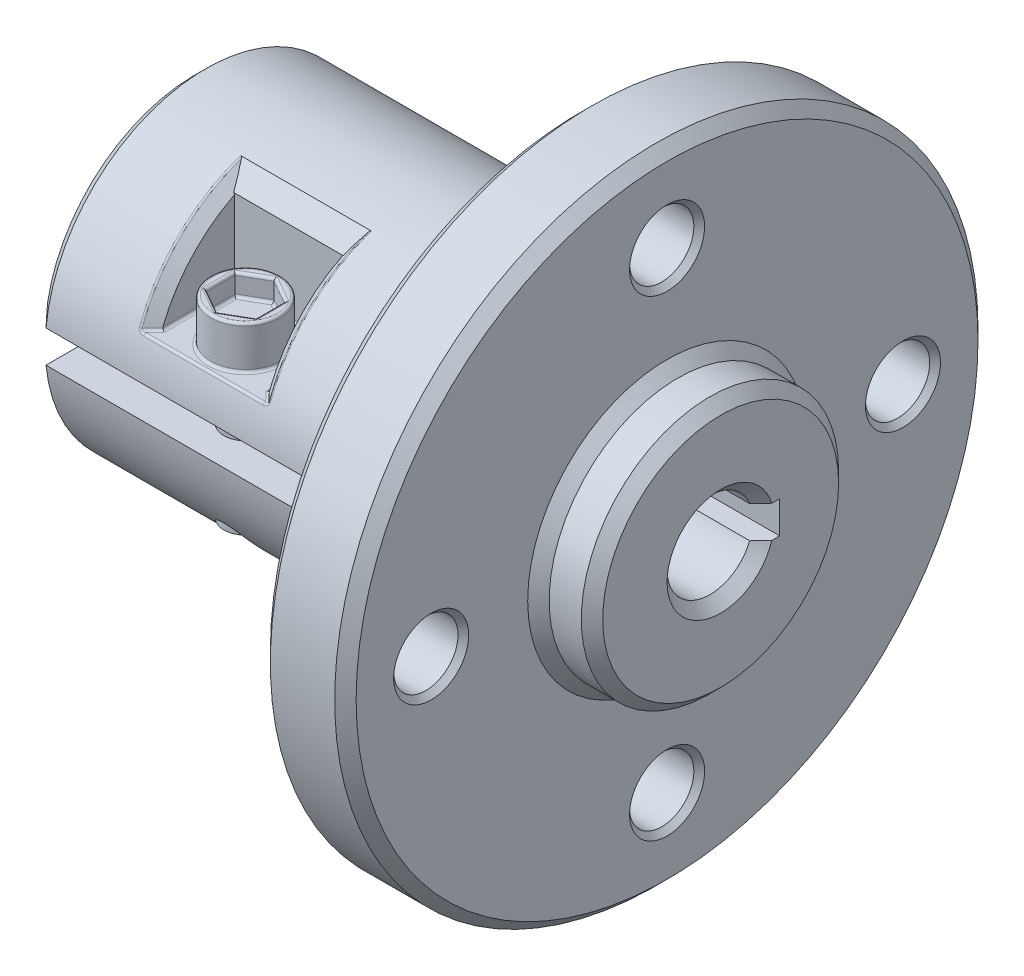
ISO-10303-21;
HEADER;
FILE_DESCRIPTION(('STEP AP214'),'2;1');
FILE_NAME('part.step','',(''),(''),'','','');
FILE_SCHEMA(('AUTOMOTIVE_DESIGN { 1 0 10303 214 1 1 1 1 }'));
ENDSEC;
DATA;
#1=APPLICATION_CONTEXT('core data for automotive mechanical design processes');
#2=APPLICATION_PROTOCOL_DEFINITION('international standard','automotive_design',2000,#1);
#3=PRODUCT_CONTEXT('',#1,'mechanical');
#4=PRODUCT('Part','Part','',(#3));
#5=PRODUCT_RELATED_PRODUCT_CATEGORY('part','',(#4));
#6=PRODUCT_DEFINITION_FORMATION('','',#4);
#7=PRODUCT_DEFINITION_CONTEXT('part definition',#1,'design');
#8=PRODUCT_DEFINITION('design','',#6,#7);
#9=PRODUCT_DEFINITION_SHAPE('','',#8);
#10=(LENGTH_UNIT() NAMED_UNIT(*) SI_UNIT(.MILLI.,.METRE.));
#11=(NAMED_UNIT(*) PLANE_ANGLE_UNIT() SI_UNIT($,.RADIAN.));
#12=(NAMED_UNIT(*) SI_UNIT($,.STERADIAN.) SOLID_ANGLE_UNIT());
#13=UNCERTAINTY_MEASURE_WITH_UNIT(LENGTH_MEASURE(1.E-05),#10,'distance_accuracy_value','');
#14=(GEOMETRIC_REPRESENTATION_CONTEXT(3) GLOBAL_UNCERTAINTY_ASSIGNED_CONTEXT((#13)) GLOBAL_UNIT_ASSIGNED_CONTEXT((#10,
#11,#12)) REPRESENTATION_CONTEXT('',''));
#15=CARTESIAN_POINT('',(0.,0.,0.));
#16=DIRECTION('',(0.,0.,1.));
#17=DIRECTION('',(1.,0.,0.));
#18=AXIS2_PLACEMENT_3D('',#15,#16,#17);
#19=CARTESIAN_POINT('',(7.5,-15.,5.16173857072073));
#20=DIRECTION('',(0.,1.,0.));
#21=DIRECTION('',(0.,0.,1.));
#22=AXIS2_PLACEMENT_3D('',#19,#20,#21);
#23=CYLINDRICAL_SURFACE('',#22,1.);
#24=CARTESIAN_POINT('',(7.5,-4.55881860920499,5.16173857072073));
#25=DIRECTION('',(0.,1.,0.));
#26=DIRECTION('',(0.,0.,1.));
#27=AXIS2_PLACEMENT_3D('',#24,#25,#26);
#28=CIRCLE('',#27,1.);
#29=CARTESIAN_POINT('',(8.10831767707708,-4.55881860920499,5.95543221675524));
#30=VERTEX_POINT('',#29);
#31=CARTESIAN_POINT('',(6.89168232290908,-4.5588186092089,5.95543221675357));
#32=VERTEX_POINT('',#31);
#33=EDGE_CURVE('E311',#30,#32,#28,.T.);
#34=ORIENTED_EDGE('',*,*,#33,.T.);
#35=CARTESIAN_POINT('',(7.5,-4.27585988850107,6.16173857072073));
#36=CARTESIAN_POINT('',(7.53416350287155,-4.27586401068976,6.16173602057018));
#37=CARTESIAN_POINT('',(7.5683575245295,-4.2784118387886,6.15997007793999));
#38=CARTESIAN_POINT('',(7.63570217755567,-4.28832910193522,6.15306974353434));
#39=CARTESIAN_POINT('',(7.66885095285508,-4.29570665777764,6.14792967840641));
#40=CARTESIAN_POINT('',(7.74090953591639,-4.31680820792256,6.13313680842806));
#41=CARTESIAN_POINT('',(7.77933778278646,-4.33161758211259,6.12270635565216));
#42=CARTESIAN_POINT('',(7.8527617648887,-4.36597281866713,6.09825601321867));
#43=CARTESIAN_POINT('',(7.88775105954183,-4.38552733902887,6.08422955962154));
#44=CARTESIAN_POINT('',(7.97137114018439,-4.43896749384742,6.04542269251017));
#45=CARTESIAN_POINT('',(8.01773978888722,-4.47504536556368,6.01882538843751));
#46=CARTESIAN_POINT('',(8.10320239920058,-4.55179184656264,5.96099973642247));
#47=CARTESIAN_POINT('',(8.14227818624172,-4.59247152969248,5.92976015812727));
#48=CARTESIAN_POINT('',(8.20594285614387,-4.66721342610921,5.87101827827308));
#49=CARTESIAN_POINT('',(8.23182373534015,-4.7007467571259,5.84421980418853));
#50=CARTESIAN_POINT('',(8.27988370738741,-4.76890391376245,5.78873838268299));
#51=CARTESIAN_POINT('',(8.30206084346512,-4.8035283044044,5.76005445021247));
#52=CARTESIAN_POINT('',(8.36332232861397,-4.90842356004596,5.67148309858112));
#53=CARTESIAN_POINT('',(8.39713290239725,-4.97971179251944,5.60907979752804));
#54=CARTESIAN_POINT('',(8.45185983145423,-5.12492424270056,5.47678249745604));
#55=CARTESIAN_POINT('',(8.47230934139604,-5.19885719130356,5.40670826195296));
#56=CARTESIAN_POINT('',(8.49763678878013,-5.34508502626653,5.26218496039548));
#57=CARTESIAN_POINT('',(8.50253063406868,-5.41738151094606,5.18774044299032));
#58=CARTESIAN_POINT('',(8.49564479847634,-5.54630642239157,5.04934177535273));
#59=CARTESIAN_POINT('',(8.48658026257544,-5.60349577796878,4.98577768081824));
#60=CARTESIAN_POINT('',(8.45518804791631,-5.714110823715,4.85860045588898));
#61=CARTESIAN_POINT('',(8.43287613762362,-5.76754090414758,4.79498747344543));
#62=CARTESIAN_POINT('',(8.3800067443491,-5.85807049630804,4.68369633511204));
#63=CARTESIAN_POINT('',(8.35225641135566,-5.89621016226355,4.63553461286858));
#64=CARTESIAN_POINT('',(8.28724281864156,-5.9681781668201,4.54249837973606));
#65=CARTESIAN_POINT('',(8.24999110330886,-6.00201166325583,4.49761996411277));
#66=CARTESIAN_POINT('',(8.17310028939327,-6.05893685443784,4.42054105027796));
#67=CARTESIAN_POINT('',(8.13495174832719,-6.08287644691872,4.38748369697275));
#68=CARTESIAN_POINT('',(8.0524178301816,-6.12633233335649,4.32659806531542));
#69=CARTESIAN_POINT('',(8.00803416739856,-6.14584983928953,4.298768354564));
#70=CARTESIAN_POINT('',(7.91356495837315,-6.17988275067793,4.24970029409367));
#71=CARTESIAN_POINT('',(7.8634443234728,-6.19436491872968,4.2285058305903));
#72=CARTESIAN_POINT('',(7.75920282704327,-6.21753559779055,4.19436337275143));
#73=CARTESIAN_POINT('',(7.70508452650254,-6.22622778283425,4.18141014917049));
#74=CARTESIAN_POINT('',(7.60127095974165,-6.23677482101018,4.16565927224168));
#75=CARTESIAN_POINT('',(7.55179527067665,-6.2393084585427,4.16185399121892));
#76=CARTESIAN_POINT('',(7.45282894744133,-6.23945908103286,4.16162849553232));
#77=CARTESIAN_POINT('',(7.40333832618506,-6.23707794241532,4.16520546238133));
#78=CARTESIAN_POINT('',(7.30843706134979,-6.22774357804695,4.17914742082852));
#79=CARTESIAN_POINT('',(7.26294801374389,-6.22103423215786,4.1891502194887));
#80=CARTESIAN_POINT('',(7.17452970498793,-6.20350507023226,4.21506438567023));
#81=CARTESIAN_POINT('',(7.1316005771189,-6.1926850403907,4.23097606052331));
#82=CARTESIAN_POINT('',(7.04768775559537,-6.16677971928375,4.26864930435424));
#83=CARTESIAN_POINT('',(7.00683860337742,-6.15154888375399,4.29060896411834));
#84=CARTESIAN_POINT('',(6.92962824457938,-6.11745110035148,4.33908624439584));
#85=CARTESIAN_POINT('',(6.8932684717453,-6.09858299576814,4.36560531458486));
#86=CARTESIAN_POINT('',(6.82161367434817,-6.05536263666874,4.42539121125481));
#87=CARTESIAN_POINT('',(6.78690240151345,-6.03063171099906,4.45908184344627));
#88=CARTESIAN_POINT('',(6.72372360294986,-5.97787285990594,4.52956755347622));
#89=CARTESIAN_POINT('',(6.69526025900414,-5.94984274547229,4.566364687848));
#90=CARTESIAN_POINT('',(6.63307545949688,-5.87783506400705,4.65895270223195));
#91=CARTESIAN_POINT('',(6.60273331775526,-5.83234888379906,4.71585207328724));
#92=CARTESIAN_POINT('',(6.5541087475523,-5.7371356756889,4.83124314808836));
#93=CARTESIAN_POINT('',(6.53584988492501,-5.68740057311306,4.88973773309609));
#94=CARTESIAN_POINT('',(6.50672239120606,-5.57045846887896,5.02293466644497));
#95=CARTESIAN_POINT('',(6.49939090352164,-5.50228017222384,5.09755485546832));
#96=CARTESIAN_POINT('',(6.50068959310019,-5.36303143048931,5.24386689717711));
#97=CARTESIAN_POINT('',(6.50933724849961,-5.29195790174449,5.31555545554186));
#98=CARTESIAN_POINT('',(6.54138550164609,-5.14760783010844,5.45549230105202));
#99=CARTESIAN_POINT('',(6.56501111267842,-5.07431421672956,5.52367065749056));
#100=CARTESIAN_POINT('',(6.62663929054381,-4.92852200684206,5.65413178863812));
#101=CARTESIAN_POINT('',(6.66463227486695,-4.85602291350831,5.7164184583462));
#102=CARTESIAN_POINT('',(6.74268054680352,-4.73472585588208,5.81693323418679));
#103=CARTESIAN_POINT('',(6.77907343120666,-4.68505339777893,5.85696425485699));
#104=CARTESIAN_POINT('',(6.86032573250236,-4.58917813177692,5.93237964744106));
#105=CARTESIAN_POINT('',(6.90517069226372,-4.54296958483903,5.96777178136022));
#106=CARTESIAN_POINT('',(6.98765479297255,-4.47145518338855,6.02140929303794));
#107=CARTESIAN_POINT('',(7.02259931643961,-4.44436636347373,6.04140490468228));
#108=CARTESIAN_POINT('',(7.0970436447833,-4.39433394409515,6.07789280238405));
#109=CARTESIAN_POINT('',(7.13653703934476,-4.37138462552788,6.0943899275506));
#110=CARTESIAN_POINT('',(7.2098836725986,-4.33640058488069,6.11931177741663));
#111=CARTESIAN_POINT('',(7.24277535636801,-4.32306875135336,6.12872395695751));
#112=CARTESIAN_POINT('',(7.31075783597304,-4.30092651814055,6.14428323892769));
#113=CARTESIAN_POINT('',(7.34584278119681,-4.29210462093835,6.15043864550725));
#114=CARTESIAN_POINT('',(7.40105137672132,-4.28264601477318,6.15702514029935));
#115=CARTESIAN_POINT('',(7.42070820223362,-4.28011130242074,6.15878654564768));
#116=CARTESIAN_POINT('',(7.46023987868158,-4.27671688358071,6.16114411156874));
#117=CARTESIAN_POINT('',(7.48011476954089,-4.27585748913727,6.16174005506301));
#118=CARTESIAN_POINT('',(7.5,-4.27585988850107,6.16173857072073));
#119=B_SPLINE_CURVE_WITH_KNOTS('',3,(#35,#36,#37,#38,#39,#40,#41,#42,#43,#44,#45,#46,#47,#48,
#49,#50,#51,#52,#53,#54,#55,#56,#57,#58,#59,#60,#61,#62,#63,#64,#65,#66,#67,#68,#69,#70,#71,#72,
#73,#74,#75,#76,#77,#78,#79,#80,#81,#82,#83,#84,#85,#86,#87,#88,#89,#90,#91,#92,#93,#94,#95,#96,
#97,#98,#99,#100,#101,#102,#103,#104,#105,#106,#107,#108,#109,#110,#111,#112,#113,#114,#115,
#116,#117,#118),.UNSPECIFIED.,.T.,.F.,(4,2,2,2,2,2,2,2,2,2,2,2,2,2,2,2,2,2,2,2,2,2,2,2,2,2,2,2,
2,2,2,2,2,2,2,2,2,2,2,2,2,4),(0.,0.102410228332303,0.20499309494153,0.33173260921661,
0.458705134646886,0.651110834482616,0.843989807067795,0.994166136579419,1.14442155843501,
1.4449534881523,1.75549264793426,2.06571413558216,2.32274144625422,2.57946342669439,
2.78094725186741,2.98218742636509,3.1491082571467,3.31598328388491,3.48393979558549,
3.65178962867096,3.8000777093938,3.94830918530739,4.0888420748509,4.22938227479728,
4.37522582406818,4.52111583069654,4.68347815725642,4.84594882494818,5.08138456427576,
5.3172781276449,5.61970808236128,5.92246903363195,6.22988976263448,6.53710581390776,
6.75691220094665,6.97634597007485,7.12154548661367,7.26654283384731,7.37630510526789,
7.48578613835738,7.54538400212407,7.60499296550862),.UNSPECIFIED.);
#120=EDGE_CURVE('E308',#30,#32,#119,.T.);
#121=ORIENTED_EDGE('',*,*,#120,.F.);
#122=EDGE_LOOP('',(#34,#121));
#123=FACE_BOUND('',#122,.T.);
#124=ADVANCED_FACE('F57',(#123),#23,.F.);
#125=CARTESIAN_POINT('',(18.,0.,0.));
#126=DIRECTION('',(-1.,0.,0.));
#127=DIRECTION('',(0.,0.,1.));
#128=AXIS2_PLACEMENT_3D('',#125,#126,#127);
#129=CYLINDRICAL_SURFACE('',#128,7.5);
#130=DIRECTION('',(-1.,0.,0.));
#131=VECTOR('',#130,1.);
#132=CARTESIAN_POINT('',(18.,7.12702736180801,2.33569710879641));
#133=LINE('',#132,#131);
#134=CARTESIAN_POINT('',(4.44822330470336,7.12702736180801,2.33569710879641));
#135=VERTEX_POINT('',#134);
#136=CARTESIAN_POINT('',(10.5517766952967,7.12702736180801,2.33569710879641));
#137=VERTEX_POINT('',#136);
#138=EDGE_CURVE('E851',#135,#137,#133,.F.);
#139=ORIENTED_EDGE('',*,*,#138,.T.);
#140=CARTESIAN_POINT('',(10.5517766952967,0.,0.));
#141=DIRECTION('',(-1.,0.,0.));
#142=DIRECTION('',(0.,0.,1.));
#143=AXIS2_PLACEMENT_3D('',#140,#141,#142);
#144=CIRCLE('',#143,7.5);
#145=CARTESIAN_POINT('',(10.5517766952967,2.54858706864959,7.05370143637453));
#146=VERTEX_POINT('',#145);
#147=EDGE_CURVE('E544',#137,#146,#144,.F.);
#148=ORIENTED_EDGE('',*,*,#147,.T.);
#149=CARTESIAN_POINT('',(16.1652589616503,2.44118139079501,13.092922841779));
#150=CARTESIAN_POINT('',(16.2430653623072,2.44118139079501,13.016569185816));
#151=CARTESIAN_POINT('',(16.2536473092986,2.54918094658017,13.0061848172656));
#152=CARTESIAN_POINT('',(15.6621931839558,2.44118139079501,12.5801638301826));
#153=CARTESIAN_POINT('',(15.7404940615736,2.44118139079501,12.5051163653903));
#154=CARTESIAN_POINT('',(15.7505815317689,2.54853307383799,12.4935557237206));
#155=CARTESIAN_POINT('',(15.1595686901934,2.44118139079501,12.0669663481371));
#156=CARTESIAN_POINT('',(15.2379766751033,2.44118139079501,11.9929394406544));
#157=CARTESIAN_POINT('',(15.2479570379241,2.54782605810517,11.9805017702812));
#158=CARTESIAN_POINT('',(14.1559358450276,2.44118139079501,11.038945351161));
#159=CARTESIAN_POINT('',(14.2336276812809,2.44118139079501,10.9662311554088));
#160=CARTESIAN_POINT('',(14.2443241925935,2.54620473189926,10.952839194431));
#161=CARTESIAN_POINT('',(13.6549275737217,2.44118139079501,10.5241217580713));
#162=CARTESIAN_POINT('',(13.7324848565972,2.44118139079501,10.4524208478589));
#163=CARTESIAN_POINT('',(13.7433159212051,2.5452904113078,10.4382304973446));
#164=CARTESIAN_POINT('',(12.6555134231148,2.44118139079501,9.4923593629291));
#165=CARTESIAN_POINT('',(12.7319403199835,2.44118139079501,9.42212744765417));
#166=CARTESIAN_POINT('',(12.7439017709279,2.5431659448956,9.40701328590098));
#167=CARTESIAN_POINT('',(12.1571065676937,2.44118139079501,8.97542150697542));
#168=CARTESIAN_POINT('',(12.2334917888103,2.44118139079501,8.90665969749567));
#169=CARTESIAN_POINT('',(12.2454949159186,2.54195591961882,8.89040567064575));
#170=CARTESIAN_POINT('',(11.1641649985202,2.44118139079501,7.93783629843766));
#171=CARTESIAN_POINT('',(11.2391963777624,2.44118139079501,7.87120528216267));
#172=CARTESIAN_POINT('',(11.2525533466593,2.53907497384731,7.85369233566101));
#173=CARTESIAN_POINT('',(10.6696302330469,2.44118139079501,7.4171889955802));
#174=CARTESIAN_POINT('',(10.7447687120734,2.44118139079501,7.35276508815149));
#175=CARTESIAN_POINT('',(10.7580185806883,2.53740405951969,7.33358666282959));
#176=CARTESIAN_POINT('',(9.97592937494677,2.44118139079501,6.67693328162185));
#177=CARTESIAN_POINT('',(10.0469804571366,2.44118139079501,6.61167838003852));
#178=CARTESIAN_POINT('',(10.0643177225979,2.53449373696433,6.5944156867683));
#179=CARTESIAN_POINT('',(9.77383573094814,2.44118139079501,6.46007107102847));
#180=CARTESIAN_POINT('',(9.84457173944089,2.44118139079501,6.39559378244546));
#181=CARTESIAN_POINT('',(9.86222407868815,2.53357706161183,6.37790897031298));
#182=CARTESIAN_POINT('',(9.37128507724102,2.44118139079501,6.02484212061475));
#183=CARTESIAN_POINT('',(9.44114377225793,2.44118139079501,5.96183235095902));
#184=CARTESIAN_POINT('',(9.45967342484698,2.53157303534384,5.94350359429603));
#185=CARTESIAN_POINT('',(9.17082802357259,2.44118139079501,5.80647542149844));
#186=CARTESIAN_POINT('',(9.24031962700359,2.44118139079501,5.74438474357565));
#187=CARTESIAN_POINT('',(9.25921637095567,2.53048568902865,5.72560497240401));
#188=CARTESIAN_POINT('',(8.77208828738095,2.44118139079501,5.36769208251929));
#189=CARTESIAN_POINT('',(8.84056644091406,2.44118139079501,5.30736237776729));
#190=CARTESIAN_POINT('',(8.86047663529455,2.5280931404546,5.28792029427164));
#191=CARTESIAN_POINT('',(8.57380597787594,2.44118139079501,5.14727510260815));
#192=CARTESIAN_POINT('',(8.64187423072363,2.44118139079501,5.08807662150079));
#193=CARTESIAN_POINT('',(8.66219432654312,2.52678790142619,5.06813392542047));
#194=CARTESIAN_POINT('',(8.27873022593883,2.44118139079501,4.8145492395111));
#195=CARTESIAN_POINT('',(8.34527538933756,2.44118139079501,4.75624677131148));
#196=CARTESIAN_POINT('',(8.36711857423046,2.52461795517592,4.73653872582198));
#197=CARTESIAN_POINT('',(8.18075873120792,2.44118139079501,4.70328568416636));
#198=CARTESIAN_POINT('',(8.24702245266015,2.44118139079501,4.64558051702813));
#199=CARTESIAN_POINT('',(8.26914707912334,2.52385925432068,4.62568287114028));
#200=CARTESIAN_POINT('',(7.98577845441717,2.44118139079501,4.47991408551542));
#201=CARTESIAN_POINT('',(8.05141499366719,2.44118139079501,4.42341481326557));
#202=CARTESIAN_POINT('',(8.07416680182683,2.52226072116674,4.40320494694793));
#203=CARTESIAN_POINT('',(7.88876969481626,2.44118139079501,4.36780602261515));
#204=CARTESIAN_POINT('',(7.95409986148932,2.44118139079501,4.31196882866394));
#205=CARTESIAN_POINT('',(7.97715804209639,2.52142088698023,4.29158285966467));
#206=CARTESIAN_POINT('',(7.79233317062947,2.44118139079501,4.25520456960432));
#207=CARTESIAN_POINT('',(7.85707852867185,2.44118139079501,4.19976108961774));
#208=CARTESIAN_POINT('',(7.88072151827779,2.52053528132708,4.17951485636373));
#209=(BOUNDED_SURFACE() B_SPLINE_SURFACE(3,2,((#149,#150,#151),(#152,#153,#154),(#155,#156,
#157),(#158,#159,#160),(#161,#162,#163),(#164,#165,#166),(#167,#168,#169),(#170,#171,#172),
(#173,#174,#175),(#176,#177,#178),(#179,#180,#181),(#182,#183,#184),(#185,#186,#187),(#188,#189,
#190),(#191,#192,#193),(#194,#195,#196),(#197,#198,#199),(#200,#201,#202),(#203,#204,#205),
(#206,#207,#208)),.UNSPECIFIED.,.F.,.F.,.F.) B_SPLINE_SURFACE_WITH_KNOTS((4,2,2,2,2,2,2,2,2,4),
(3,3),(0.,2.15499401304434,4.31009323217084,6.46431538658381,8.61850871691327,9.5077940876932,
10.39705549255,11.2864671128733,11.7312114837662,12.1759662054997),(0.,1.),
.UNSPECIFIED.) GEOMETRIC_REPRESENTATION_ITEM() RATIONAL_B_SPLINE_SURFACE(((1.,0.753658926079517,
1.),(1.,0.755376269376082,1.),(1.,0.757248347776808,1.),(1.,0.761519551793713,1.),(1.,
0.763918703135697,1.),(1.,0.769460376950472,1.),(1.,0.772602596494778,1.),(1.,0.7800258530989,
1.),(1.,0.784306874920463,1.),(1.,0.791678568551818,1.),(1.,0.793992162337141,1.),(1.,
0.79902430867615,1.),(1.,0.801742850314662,1.),(1.,0.807689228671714,1.),(1.,0.810917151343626,
1.),(1.,0.816245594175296,1.),(1.,0.818102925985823,1.),(1.,0.822001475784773,1.),(1.,
0.824042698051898,1.),(1.,0.826186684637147,1.))) REPRESENTATION_ITEM('') SURFACE());
#210=CARTESIAN_POINT('',(10.437980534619,2.58087961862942,6.98818275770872));
#211=CARTESIAN_POINT('',(10.4717383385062,2.61394296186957,7.02979742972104));
#212=CARTESIAN_POINT('',(10.5284379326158,2.63957202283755,7.02016093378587));
#213=CARTESIAN_POINT('',(10.4478423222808,2.57043671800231,6.99688628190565));
#214=CARTESIAN_POINT('',(10.4831236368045,2.59920468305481,7.03525563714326));
#215=CARTESIAN_POINT('',(10.539186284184,2.61833142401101,7.02815095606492));
#216=CARTESIAN_POINT('',(10.4556205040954,2.55923840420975,7.00518650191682));
#217=CARTESIAN_POINT('',(10.4920533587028,2.58267005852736,7.04132705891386));
#218=CARTESIAN_POINT('',(10.5469454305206,2.59555397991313,7.03659815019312));
#219=CARTESIAN_POINT('',(10.4615606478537,2.54391604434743,7.01482392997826));
#220=CARTESIAN_POINT('',(10.4983206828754,2.56002665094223,7.04956142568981));
#221=CARTESIAN_POINT('',(10.55122318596,2.56438818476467,7.04797728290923));
#222=CARTESIAN_POINT('',(10.4626778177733,2.54003840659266,7.01712169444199));
#223=CARTESIAN_POINT('',(10.4994221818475,2.55431640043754,7.05163154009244));
#224=CARTESIAN_POINT('',(10.5517853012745,2.55650103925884,7.05084231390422));
#225=CARTESIAN_POINT('',(10.4650322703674,2.52688111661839,7.02439430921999));
#226=CARTESIAN_POINT('',(10.5013544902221,2.53501773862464,7.05860377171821));
#227=CARTESIAN_POINT('',(10.5517561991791,2.5297390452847,7.06051076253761));
#228=CARTESIAN_POINT('',(10.4643029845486,2.51753982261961,7.02868175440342));
#229=CARTESIAN_POINT('',(10.4997549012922,2.52126779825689,7.06353140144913));
#230=CARTESIAN_POINT('',(10.5484985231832,2.51073886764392,7.06728657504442));
#231=CARTESIAN_POINT('',(10.4576364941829,2.49998244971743,7.03484006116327));
#232=CARTESIAN_POINT('',(10.4902738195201,2.49603592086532,7.07251408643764));
#233=CARTESIAN_POINT('',(10.5352198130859,2.47502766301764,7.07987328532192));
#234=CARTESIAN_POINT('',(10.4516955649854,2.49176718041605,7.03670919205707));
#235=CARTESIAN_POINT('',(10.4823435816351,2.48444551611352,7.076607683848));
#236=CARTESIAN_POINT('',(10.5251939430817,2.45831828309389,7.08568348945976));
#237=CARTESIAN_POINT('',(10.4359810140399,2.47736010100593,7.03812637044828));
#238=CARTESIAN_POINT('',(10.4622156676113,2.46500842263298,7.0834502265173));
#239=CARTESIAN_POINT('',(10.5004345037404,2.42901574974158,7.09578209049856));
#240=CARTESIAN_POINT('',(10.4262544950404,2.47114507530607,7.03770214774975));
#241=CARTESIAN_POINT('',(10.4499608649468,2.45707737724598,7.0862289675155));
#242=CARTESIAN_POINT('',(10.4857591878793,2.41637536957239,7.10008800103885));
#243=CARTESIAN_POINT('',(10.3985916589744,2.45780370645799,7.03445102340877));
#244=CARTESIAN_POINT('',(10.4158261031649,2.44135609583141,7.09174752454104));
#245=CARTESIAN_POINT('',(10.4450395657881,2.38924145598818,7.10927835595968));
#246=CARTESIAN_POINT('',(10.3790542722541,2.45198730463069,7.03045382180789));
#247=CARTESIAN_POINT('',(10.3922051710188,2.43610479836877,7.09360378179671));
#248=CARTESIAN_POINT('',(10.4171274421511,2.37741230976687,7.11322679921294));
#249=CARTESIAN_POINT('',(10.3438673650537,2.44522266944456,7.02156062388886));
#250=CARTESIAN_POINT('',(10.3512399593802,2.43285227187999,7.09482415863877));
#251=CARTESIAN_POINT('',(10.3676952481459,2.36365625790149,7.11780556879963));
#252=CARTESIAN_POINT('',(10.3287032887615,2.44335804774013,7.01724832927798));
#253=CARTESIAN_POINT('',(10.3338072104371,2.4332887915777,7.09472189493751));
#254=CARTESIAN_POINT('',(10.3466292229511,2.35986519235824,7.11906180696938));
#255=CARTESIAN_POINT('',(10.2977988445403,2.44121751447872,7.00771127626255));
#256=CARTESIAN_POINT('',(10.2990938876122,2.43703670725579,7.09353352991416));
#257=CARTESIAN_POINT('',(10.3040650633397,2.35551278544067,7.12050316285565));
#258=CARTESIAN_POINT('',(10.2820567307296,2.44094689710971,7.00248353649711));
#259=CARTESIAN_POINT('',(10.2817694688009,2.44044646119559,7.09241390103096));
#260=CARTESIAN_POINT('',(10.2825657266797,2.3549622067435,7.12068471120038));
#261=CARTESIAN_POINT('',(10.2454472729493,2.44194667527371,6.98959335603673));
#262=CARTESIAN_POINT('',(10.2424210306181,2.45131720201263,7.08878853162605));
#263=CARTESIAN_POINT('',(10.2329260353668,2.35699534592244,7.1200125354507));
#264=CARTESIAN_POINT('',(10.2245340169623,2.44373166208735,6.98168388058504));
#265=CARTESIAN_POINT('',(10.2208763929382,2.45984122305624,7.08591305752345));
#266=CARTESIAN_POINT('',(10.2048364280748,2.36062571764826,7.11881312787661));
#267=CARTESIAN_POINT('',(10.1832939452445,2.44944769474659,6.96508017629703));
#268=CARTESIAN_POINT('',(10.1805696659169,2.48044081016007,7.07887621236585));
#269=CARTESIAN_POINT('',(10.1499369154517,2.37225150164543,7.11494510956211));
#270=CARTESIAN_POINT('',(10.162963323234,2.45335665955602,6.95639477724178));
#271=CARTESIAN_POINT('',(10.1618174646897,2.49271441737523,7.07464422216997));
#272=CARTESIAN_POINT('',(10.1231168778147,2.38020200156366,7.11229161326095));
#273=CARTESIAN_POINT('',(10.1431034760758,2.45820599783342,6.94742794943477));
#274=CARTESIAN_POINT('',(10.1455888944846,2.50603529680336,7.06998983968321));
#275=CARTESIAN_POINT('',(10.0971534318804,2.39006523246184,7.1089794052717));
#276=(BOUNDED_SURFACE() B_SPLINE_SURFACE(3,2,((#210,#211,#212),(#213,#214,#215),(#216,#217,
#218),(#219,#220,#221),(#222,#223,#224),(#225,#226,#227),(#228,#229,#230),(#231,#232,#233),
(#234,#235,#236),(#237,#238,#239),(#240,#241,#242),(#243,#244,#245),(#246,#247,#248),(#249,#250,
#251),(#252,#253,#254),(#255,#256,#257),(#258,#259,#260),(#261,#262,#263),(#264,#265,#266),
(#267,#268,#269),(#270,#271,#272),(#273,#274,#275)),.UNSPECIFIED.,.F.,.F.,
.F.) B_SPLINE_SURFACE_WITH_KNOTS((4,2,2,2,2,2,2,2,2,2,4),(3,3),(0.,0.0738998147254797,
0.0986692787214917,0.157660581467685,0.216694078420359,0.275015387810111,0.364726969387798,
0.428789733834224,0.49306515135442,0.577674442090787,0.661420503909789),(0.,1.),
.UNSPECIFIED.) GEOMETRIC_REPRESENTATION_ITEM() RATIONAL_B_SPLINE_SURFACE(((1.,0.893095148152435,
1.),(1.,0.903400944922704,1.),(1.,0.912142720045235,1.),(1.,0.920524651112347,1.),(1.,
0.922351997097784,1.),(1.,0.927480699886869,1.),(1.,0.929330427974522,1.),(1.,0.928957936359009,
1.),(1.,0.926732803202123,1.),(1.,0.918963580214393,1.),(1.,0.913459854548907,1.),(1.,
0.896569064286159,1.),(1.,0.883609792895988,1.),(1.,0.858825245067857,1.),(1.,0.847735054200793,
1.),(1.,0.824300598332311,1.),(1.,0.811952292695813,1.),(1.,0.782195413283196,1.),(1.,
0.764421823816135,1.),(1.,0.727545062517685,1.),(1.,0.708457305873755,1.),(1.,0.688726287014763,1.))) REPRESENTATION_ITEM('') SURFACE());
#277=CARTESIAN_POINT('',(10.0971534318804,2.39006523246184,7.1089794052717));
#278=CARTESIAN_POINT('',(10.1231168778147,2.38020200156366,7.11229161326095));
#279=CARTESIAN_POINT('',(10.1499369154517,2.37225150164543,7.11494510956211));
#280=CARTESIAN_POINT('',(10.2048364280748,2.36062571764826,7.11881312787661));
#281=CARTESIAN_POINT('',(10.2329260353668,2.35699534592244,7.1200125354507));
#282=CARTESIAN_POINT('',(10.2825657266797,2.3549622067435,7.12068471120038));
#283=CARTESIAN_POINT('',(10.3040650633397,2.35551278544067,7.12050316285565));
#284=CARTESIAN_POINT('',(10.3466292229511,2.35986519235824,7.11906180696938));
#285=CARTESIAN_POINT('',(10.3676952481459,2.36365625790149,7.11780556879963));
#286=CARTESIAN_POINT('',(10.4171274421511,2.37741230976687,7.11322679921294));
#287=CARTESIAN_POINT('',(10.4450395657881,2.38924145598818,7.10927835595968));
#288=CARTESIAN_POINT('',(10.4857591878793,2.41637536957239,7.10008800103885));
#289=CARTESIAN_POINT('',(10.5004345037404,2.42901574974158,7.09578209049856));
#290=CARTESIAN_POINT('',(10.5251939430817,2.45831828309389,7.08568348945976));
#291=CARTESIAN_POINT('',(10.5352198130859,2.47502766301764,7.07987328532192));
#292=CARTESIAN_POINT('',(10.5484985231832,2.51073886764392,7.06728657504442));
#293=CARTESIAN_POINT('',(10.5517561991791,2.5297390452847,7.06051076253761));
#294=CARTESIAN_POINT('',(10.5517853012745,2.55650103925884,7.05084231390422));
#295=CARTESIAN_POINT('',(10.55122318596,2.56438818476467,7.04797728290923));
#296=CARTESIAN_POINT('',(10.5469454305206,2.59555397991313,7.03659815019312));
#297=CARTESIAN_POINT('',(10.539186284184,2.61833142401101,7.02815095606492));
#298=CARTESIAN_POINT('',(10.5284379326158,2.63957202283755,7.02016093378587));
#299=B_SPLINE_CURVE_WITH_KNOTS('',3,(#277,#278,#279,#280,#281,#282,#283,#284,#285,#286,#287,
#288,#289,#290,#291,#292,#293,#294,#295,#296,#297,#298),.UNSPECIFIED.,.F.,.F.,(4,2,2,2,2,2,2,2,
2,2,4),(0.,0.0837460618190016,0.168355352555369,0.232630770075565,0.296693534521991,
0.386405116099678,0.44472642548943,0.503759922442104,0.562751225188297,0.587520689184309,
0.661420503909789),.UNSPECIFIED.);
#300=CARTESIAN_POINT('',(10.2805160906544,2.3554387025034,7.12052726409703));
#301=VERTEX_POINT('',#300);
#302=EDGE_CURVE('E844',#301,#146,#299,.T.);
#303=ORIENTED_EDGE('',*,*,#302,.F.);
#304=DIRECTION('',(-1.,0.,0.));
#305=VECTOR('',#304,1.);
#306=CARTESIAN_POINT('',(18.,2.3554387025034,7.12052726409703));
#307=LINE('',#306,#305);
#308=CARTESIAN_POINT('',(4.71948390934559,2.3554387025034,7.12052726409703));
#309=VERTEX_POINT('',#308);
#310=EDGE_CURVE('E1229',#301,#309,#307,.T.);
#311=ORIENTED_EDGE('',*,*,#310,.T.);
#312=CARTESIAN_POINT('',(-1.25364730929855,2.54918094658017,13.0061848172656));
#313=CARTESIAN_POINT('',(-1.24306536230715,2.44118139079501,13.016569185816));
#314=CARTESIAN_POINT('',(-1.16525896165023,2.44118139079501,13.0929228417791));
#315=CARTESIAN_POINT('',(-0.750581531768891,2.54853307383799,12.4935557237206));
#316=CARTESIAN_POINT('',(-0.740494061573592,2.44118139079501,12.5051163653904));
#317=CARTESIAN_POINT('',(-0.662193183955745,2.44118139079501,12.5801638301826));
#318=CARTESIAN_POINT('',(-0.247957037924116,2.54782605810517,11.9805017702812));
#319=CARTESIAN_POINT('',(-0.23797667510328,2.44118139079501,11.9929394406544));
#320=CARTESIAN_POINT('',(-0.159568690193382,2.44118139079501,12.0669663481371));
#321=CARTESIAN_POINT('',(0.755675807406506,2.54620473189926,10.952839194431));
#322=CARTESIAN_POINT('',(0.766372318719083,2.44118139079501,10.9662311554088));
#323=CARTESIAN_POINT('',(0.844064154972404,2.44118139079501,11.0389453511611));
#324=CARTESIAN_POINT('',(1.25668407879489,2.5452904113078,10.4382304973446));
#325=CARTESIAN_POINT('',(1.26751514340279,2.44118139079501,10.4524208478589));
#326=CARTESIAN_POINT('',(1.34507242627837,2.44118139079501,10.5241217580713));
#327=CARTESIAN_POINT('',(2.25609822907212,2.5431659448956,9.40701328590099));
#328=CARTESIAN_POINT('',(2.26805968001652,2.44118139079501,9.42212744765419));
#329=CARTESIAN_POINT('',(2.34448657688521,2.44118139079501,9.49235936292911));
#330=CARTESIAN_POINT('',(2.7545050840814,2.54195591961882,8.89040567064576));
#331=CARTESIAN_POINT('',(2.76650821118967,2.44118139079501,8.90665969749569));
#332=CARTESIAN_POINT('',(2.84289343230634,2.44118139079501,8.97542150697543));
#333=CARTESIAN_POINT('',(3.74744665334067,2.53907497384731,7.85369233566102));
#334=CARTESIAN_POINT('',(3.76080362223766,2.44118139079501,7.87120528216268));
#335=CARTESIAN_POINT('',(3.83583500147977,2.44118139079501,7.93783629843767));
#336=CARTESIAN_POINT('',(4.24198141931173,2.53740405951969,7.3335866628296));
#337=CARTESIAN_POINT('',(4.25523128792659,2.44118139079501,7.3527650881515));
#338=CARTESIAN_POINT('',(4.33036976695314,2.44118139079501,7.41718899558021));
#339=CARTESIAN_POINT('',(4.93568227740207,2.53449373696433,6.59441568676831));
#340=CARTESIAN_POINT('',(4.9530195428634,2.44118139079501,6.61167838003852));
#341=CARTESIAN_POINT('',(5.02407062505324,2.44118139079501,6.67693328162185));
#342=CARTESIAN_POINT('',(5.13777592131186,2.53357706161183,6.37790897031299));
#343=CARTESIAN_POINT('',(5.15542826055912,2.44118139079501,6.39559378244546));
#344=CARTESIAN_POINT('',(5.22616426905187,2.44118139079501,6.46007107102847));
#345=CARTESIAN_POINT('',(5.54032657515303,2.53157303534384,5.94350359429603));
#346=CARTESIAN_POINT('',(5.55885622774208,2.44118139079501,5.96183235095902));
#347=CARTESIAN_POINT('',(5.62871492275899,2.44118139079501,6.02484212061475));
#348=CARTESIAN_POINT('',(5.74078362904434,2.53048568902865,5.72560497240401));
#349=CARTESIAN_POINT('',(5.75968037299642,2.44118139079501,5.74438474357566));
#350=CARTESIAN_POINT('',(5.82917197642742,2.44118139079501,5.80647542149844));
#351=CARTESIAN_POINT('',(6.13952336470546,2.5280931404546,5.28792029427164));
#352=CARTESIAN_POINT('',(6.15943355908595,2.44118139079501,5.30736237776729));
#353=CARTESIAN_POINT('',(6.22791171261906,2.44118139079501,5.36769208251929));
#354=CARTESIAN_POINT('',(6.33780567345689,2.52678790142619,5.06813392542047));
#355=CARTESIAN_POINT('',(6.35812576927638,2.44118139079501,5.08807662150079));
#356=CARTESIAN_POINT('',(6.42619402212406,2.44118139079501,5.14727510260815));
#357=CARTESIAN_POINT('',(6.63288142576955,2.52461795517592,4.73653872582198));
#358=CARTESIAN_POINT('',(6.65472461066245,2.44118139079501,4.75624677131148));
#359=CARTESIAN_POINT('',(6.72126977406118,2.44118139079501,4.8145492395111));
#360=CARTESIAN_POINT('',(6.73085292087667,2.52385925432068,4.62568287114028));
#361=CARTESIAN_POINT('',(6.75297754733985,2.44118139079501,4.64558051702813));
#362=CARTESIAN_POINT('',(6.81924126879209,2.44118139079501,4.70328568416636));
#363=CARTESIAN_POINT('',(6.92583319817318,2.52226072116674,4.40320494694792));
#364=CARTESIAN_POINT('',(6.94858500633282,2.44118139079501,4.42341481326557));
#365=CARTESIAN_POINT('',(7.01422154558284,2.44118139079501,4.47991408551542));
#366=CARTESIAN_POINT('',(7.02284195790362,2.52142088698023,4.29158285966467));
#367=CARTESIAN_POINT('',(7.04590013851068,2.44118139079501,4.31196882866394));
#368=CARTESIAN_POINT('',(7.11123030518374,2.44118139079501,4.36780602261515));
#369=CARTESIAN_POINT('',(7.11927848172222,2.52053528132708,4.17951485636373));
#370=CARTESIAN_POINT('',(7.14292147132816,2.44118139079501,4.19976108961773));
#371=CARTESIAN_POINT('',(7.20766682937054,2.44118139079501,4.25520456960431));
#372=(BOUNDED_SURFACE() B_SPLINE_SURFACE(3,2,((#312,#313,#314),(#315,#316,#317),(#318,#319,
#320),(#321,#322,#323),(#324,#325,#326),(#327,#328,#329),(#330,#331,#332),(#333,#334,#335),
(#336,#337,#338),(#339,#340,#341),(#342,#343,#344),(#345,#346,#347),(#348,#349,#350),(#351,#352,
#353),(#354,#355,#356),(#357,#358,#359),(#360,#361,#362),(#363,#364,#365),(#366,#367,#368),
(#369,#370,#371)),.UNSPECIFIED.,.F.,.F.,.F.) B_SPLINE_SURFACE_WITH_KNOTS((4,2,2,2,2,2,2,2,2,4),
(3,3),(0.,2.15499401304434,4.31009323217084,6.46431538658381,8.61850871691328,9.5077940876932,
10.39705549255,11.2864671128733,11.7312114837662,12.1759662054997),(0.,1.),
.UNSPECIFIED.) GEOMETRIC_REPRESENTATION_ITEM() RATIONAL_B_SPLINE_SURFACE(((1.,0.753658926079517,
1.),(1.,0.755376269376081,1.),(1.,0.757248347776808,1.),(1.,0.761519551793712,1.),(1.,
0.763918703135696,1.),(1.,0.769460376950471,1.),(1.,0.772602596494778,1.),(1.,0.7800258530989,
1.),(1.,0.784306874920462,1.),(1.,0.791678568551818,1.),(1.,0.793992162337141,1.),(1.,
0.79902430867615,1.),(1.,0.801742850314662,1.),(1.,0.807689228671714,1.),(1.,0.810917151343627,
1.),(1.,0.816245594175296,1.),(1.,0.818102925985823,1.),(1.,0.822001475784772,1.),(1.,
0.824042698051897,1.),(1.,0.826186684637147,1.))) REPRESENTATION_ITEM('') SURFACE());
#373=CARTESIAN_POINT('',(4.84028239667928,2.45438380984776,6.95482081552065));
#374=CARTESIAN_POINT('',(4.84003622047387,2.49500284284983,7.07383136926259));
#375=CARTESIAN_POINT('',(4.88107342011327,2.38229150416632,7.11158823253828));
#376=CARTESIAN_POINT('',(4.82069623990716,2.45019075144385,6.96338693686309));
#377=CARTESIAN_POINT('',(4.82319570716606,2.48284885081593,7.07805004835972));
#378=CARTESIAN_POINT('',(4.85533230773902,2.37376325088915,7.11444128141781));
#379=CARTESIAN_POINT('',(4.8007129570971,2.44690489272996,6.97166730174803));
#380=CARTESIAN_POINT('',(4.80410631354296,2.47180648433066,7.08183603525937));
#381=CARTESIAN_POINT('',(4.82884512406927,2.36707990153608,7.11666634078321));
#382=CARTESIAN_POINT('',(4.76025488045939,2.44238466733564,6.98745995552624));
#383=CARTESIAN_POINT('',(4.76350722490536,2.45359560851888,7.08802352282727));
#384=CARTESIAN_POINT('',(4.77474412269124,2.35788586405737,7.11972010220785));
#385=CARTESIAN_POINT('',(4.73977709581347,2.44117870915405,6.99496031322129));
#386=CARTESIAN_POINT('',(4.74197747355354,2.4462594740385,7.09048416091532));
#387=CARTESIAN_POINT('',(4.74711990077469,2.35543295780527,7.12052947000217));
#388=CARTESIAN_POINT('',(4.70388609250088,2.44118345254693,7.00715375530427));
#389=CARTESIAN_POINT('',(4.70279372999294,2.43741020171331,7.09341145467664));
#390=CARTESIAN_POINT('',(4.69823692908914,2.35544311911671,7.12052556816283));
#391=CARTESIAN_POINT('',(4.68839648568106,2.44189991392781,7.01209497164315));
#392=CARTESIAN_POINT('',(4.68550630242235,2.43486754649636,7.09423390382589));
#393=CARTESIAN_POINT('',(4.6769829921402,2.35690078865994,7.12004416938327));
#394=CARTESIAN_POINT('',(4.65814709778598,2.44497333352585,7.02098763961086));
#395=CARTESIAN_POINT('',(4.6511010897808,2.43292734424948,7.09480507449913));
#396=CARTESIAN_POINT('',(4.63510323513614,2.36315044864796,7.11797241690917));
#397=CARTESIAN_POINT('',(4.64338404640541,2.44732204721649,7.0249439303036));
#398=CARTESIAN_POINT('',(4.633932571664,2.43343088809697,7.09458744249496));
#399=CARTESIAN_POINT('',(4.61447479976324,2.36792568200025,7.11638763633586));
#400=CARTESIAN_POINT('',(4.61147469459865,2.45482425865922,7.03238039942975));
#401=CARTESIAN_POINT('',(4.59633955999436,2.43868390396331,7.09268946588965));
#402=CARTESIAN_POINT('',(4.56933594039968,2.3831817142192,7.11129611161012));
#403=CARTESIAN_POINT('',(4.59469605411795,2.46054500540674,7.03547446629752));
#404=CARTESIAN_POINT('',(4.57593516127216,2.44439001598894,7.09068154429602));
#405=CARTESIAN_POINT('',(4.54519688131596,2.39481659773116,7.10739902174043));
#406=CARTESIAN_POINT('',(4.56846792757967,2.47424923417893,7.03805831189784));
#407=CARTESIAN_POINT('',(4.54347955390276,2.46093963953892,7.08487460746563));
#408=CARTESIAN_POINT('',(4.50634064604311,2.42268877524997,7.09793985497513));
#409=CARTESIAN_POINT('',(4.55823799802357,2.48162293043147,7.03810639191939));
#410=CARTESIAN_POINT('',(4.5304634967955,2.47059640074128,7.08148994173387));
#411=CARTESIAN_POINT('',(4.49070712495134,2.4376858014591,7.09281590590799));
#412=CARTESIAN_POINT('',(4.54303990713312,2.49865504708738,7.03523904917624));
#413=CARTESIAN_POINT('',(4.51071530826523,2.49406103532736,7.07321020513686));
#414=CARTESIAN_POINT('',(4.46601483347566,2.47232775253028,7.08081336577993));
#415=CARTESIAN_POINT('',(4.53810267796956,2.5083264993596,7.03230639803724));
#416=CARTESIAN_POINT('',(4.50387837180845,2.50797641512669,7.06827726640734));
#417=CARTESIAN_POINT('',(4.45699481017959,2.49199918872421,7.07392474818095));
#418=CARTESIAN_POINT('',(4.5349431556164,2.52723435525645,7.0242296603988));
#419=CARTESIAN_POINT('',(4.49858090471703,2.53546423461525,7.05844219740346));
#420=CARTESIAN_POINT('',(4.44812300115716,2.53045746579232,7.06025141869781));
#421=CARTESIAN_POINT('',(4.53596401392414,2.53637595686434,7.01940494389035));
#422=CARTESIAN_POINT('',(4.49917899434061,2.54898560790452,7.0535688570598));
#423=CARTESIAN_POINT('',(4.44727290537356,2.54905144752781,7.0535597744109));
#424=CARTESIAN_POINT('',(4.54103785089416,2.55113835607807,7.01035352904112));
#425=CARTESIAN_POINT('',(4.50437241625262,2.5706677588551,7.04569530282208));
#426=CARTESIAN_POINT('',(4.45052326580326,2.57907851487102,7.04262143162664));
#427=CARTESIAN_POINT('',(4.54390360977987,2.5568708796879,7.00650923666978));
#428=CARTESIAN_POINT('',(4.50752438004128,2.57909985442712,7.04261755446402));
#429=CARTESIAN_POINT('',(4.45299409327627,2.59073870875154,7.03833928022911));
#430=CARTESIAN_POINT('',(4.55101186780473,2.56803216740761,6.99846731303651));
#431=CARTESIAN_POINT('',(4.5155400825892,2.59541987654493,7.03663500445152));
#432=CARTESIAN_POINT('',(4.4598607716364,2.61344092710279,7.02994115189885));
#433=CARTESIAN_POINT('',(4.55524560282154,2.57346261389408,6.99427205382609));
#434=CARTESIAN_POINT('',(4.52041800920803,2.6033254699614,7.03372365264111));
#435=CARTESIAN_POINT('',(4.46424442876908,2.624486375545,7.02582429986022));
#436=CARTESIAN_POINT('',(4.56000542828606,2.57870877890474,6.98997819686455));
#437=CARTESIAN_POINT('',(4.5259156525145,2.61082307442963,7.03095145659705));
#438=CARTESIAN_POINT('',(4.46937595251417,2.63515657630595,7.02181955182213));
#439=(BOUNDED_SURFACE() B_SPLINE_SURFACE(3,2,((#373,#374,#375),(#376,#377,#378),(#379,#380,
#381),(#382,#383,#384),(#385,#386,#387),(#388,#389,#390),(#391,#392,#393),(#394,#395,#396),
(#397,#398,#399),(#400,#401,#402),(#403,#404,#405),(#406,#407,#408),(#409,#410,#411),(#412,#413,
#414),(#415,#416,#417),(#418,#419,#420),(#421,#422,#423),(#424,#425,#426),(#427,#428,#429),
(#430,#431,#432),(#433,#434,#435),(#436,#437,#438)),.UNSPECIFIED.,.F.,.F.,
.F.) B_SPLINE_SURFACE_WITH_KNOTS((4,2,2,2,2,2,2,2,2,2,4),(3,3),(0.,0.0817102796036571,
0.164528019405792,0.228199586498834,0.291551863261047,0.37124721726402,0.436282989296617,
0.501696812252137,0.558997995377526,0.596229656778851,0.633227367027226),(0.,1.),
.UNSPECIFIED.) GEOMETRIC_REPRESENTATION_ITEM() RATIONAL_B_SPLINE_SURFACE(((1.,0.704983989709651,
1.),(1.,0.723853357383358,1.),(1.,0.742110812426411,1.),(1.,0.777407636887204,1.),(1.,
0.794427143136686,1.),(1.,0.822995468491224,1.),(1.,0.834899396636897,1.),(1.,0.857366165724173,
1.),(1.,0.867935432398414,1.),(1.,0.88990099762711,1.),(1.,0.90080726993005,1.),(1.,
0.916524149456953,1.),(1.,0.922087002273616,1.),(1.,0.928805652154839,1.),(1.,0.929935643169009,
1.),(1.,0.927397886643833,1.),(1.,0.924307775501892,1.),(1.,0.916727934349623,1.),(1.,
0.913107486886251,1.),(1.,0.904855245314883,1.),(1.,0.90022994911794,1.),(1.,0.895206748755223,1.))) REPRESENTATION_ITEM('') SURFACE());
#440=CARTESIAN_POINT('',(4.46937595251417,2.63515657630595,7.02181955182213));
#441=CARTESIAN_POINT('',(4.46424442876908,2.624486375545,7.02582429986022));
#442=CARTESIAN_POINT('',(4.45986077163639,2.61344092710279,7.02994115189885));
#443=CARTESIAN_POINT('',(4.45299409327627,2.59073870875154,7.03833928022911));
#444=CARTESIAN_POINT('',(4.45052326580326,2.57907851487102,7.04262143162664));
#445=CARTESIAN_POINT('',(4.44727290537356,2.54905144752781,7.0535597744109));
#446=CARTESIAN_POINT('',(4.44812300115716,2.53045746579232,7.06025141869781));
#447=CARTESIAN_POINT('',(4.4569948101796,2.49199918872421,7.07392474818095));
#448=CARTESIAN_POINT('',(4.46601483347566,2.47232775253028,7.08081336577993));
#449=CARTESIAN_POINT('',(4.49070712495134,2.4376858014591,7.09281590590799));
#450=CARTESIAN_POINT('',(4.50634064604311,2.42268877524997,7.09793985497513));
#451=CARTESIAN_POINT('',(4.54519688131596,2.39481659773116,7.10739902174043));
#452=CARTESIAN_POINT('',(4.56933594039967,2.3831817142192,7.11129611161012));
#453=CARTESIAN_POINT('',(4.61447479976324,2.36792568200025,7.11638763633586));
#454=CARTESIAN_POINT('',(4.63510323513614,2.36315044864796,7.11797241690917));
#455=CARTESIAN_POINT('',(4.6769829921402,2.35690078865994,7.12004416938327));
#456=CARTESIAN_POINT('',(4.69823692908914,2.35544311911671,7.12052556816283));
#457=CARTESIAN_POINT('',(4.74711990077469,2.35543295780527,7.12052947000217));
#458=CARTESIAN_POINT('',(4.77474412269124,2.35788586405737,7.11972010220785));
#459=CARTESIAN_POINT('',(4.82884512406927,2.36707990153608,7.11666634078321));
#460=CARTESIAN_POINT('',(4.85533230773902,2.37376325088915,7.11444128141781));
#461=CARTESIAN_POINT('',(4.88107342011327,2.38229150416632,7.11158823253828));
#462=B_SPLINE_CURVE_WITH_KNOTS('',3,(#440,#441,#442,#443,#444,#445,#446,#447,#448,#449,#450,
#451,#452,#453,#454,#455,#456,#457,#458,#459,#460,#461),.UNSPECIFIED.,.F.,.F.,(4,2,2,2,2,2,2,2,
2,2,4),(0.,0.0369977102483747,0.0742293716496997,0.131530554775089,0.196944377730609,
0.261980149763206,0.341675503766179,0.405027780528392,0.468699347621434,0.551517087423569,
0.633227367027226),.UNSPECIFIED.);
#463=CARTESIAN_POINT('',(4.44822330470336,2.54858706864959,7.05370143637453));
#464=VERTEX_POINT('',#463);
#465=EDGE_CURVE('E1230',#464,#309,#462,.T.);
#466=ORIENTED_EDGE('',*,*,#465,.F.);
#467=CARTESIAN_POINT('',(4.44822330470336,0.,0.));
#468=DIRECTION('',(1.,0.,0.));
#469=DIRECTION('',(0.,0.,-1.));
#470=AXIS2_PLACEMENT_3D('',#467,#468,#469);
#471=CIRCLE('',#470,7.5);
#472=EDGE_CURVE('E848',#464,#135,#471,.F.);
#473=ORIENTED_EDGE('',*,*,#472,.T.);
#474=EDGE_LOOP('',(#139,#148,#303,#311,#466,#473));
#475=FACE_BOUND('',#474,.T.);
#476=CARTESIAN_POINT('',(17.5,0.,0.));
#477=DIRECTION('',(1.,0.,0.));
#478=DIRECTION('',(0.,0.,-1.));
#479=AXIS2_PLACEMENT_3D('',#476,#477,#478);
#480=CIRCLE('',#479,7.5);
#481=CARTESIAN_POINT('',(17.5,0.,-7.5));
#482=VERTEX_POINT('',#481);
#483=EDGE_CURVE('E1176',#482,#482,#480,.F.);
#484=ORIENTED_EDGE('',*,*,#483,.T.);
#485=EDGE_LOOP('',(#484));
#486=FACE_BOUND('',#485,.T.);
#487=ORIENTED_EDGE('',*,*,#120,.T.);
#488=CARTESIAN_POINT('',(6.89168232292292,-4.55881860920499,5.95543221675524));
#489=CARTESIAN_POINT('',(6.92412423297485,-4.52642460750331,5.98025091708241));
#490=CARTESIAN_POINT('',(6.95897306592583,-4.49502714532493,6.0038435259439));
#491=CARTESIAN_POINT('',(7.0343086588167,-4.43571545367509,6.04778852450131));
#492=CARTESIAN_POINT('',(7.07486965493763,-4.40785815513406,6.06808912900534));
#493=CARTESIAN_POINT('',(7.15027506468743,-4.36462178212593,6.09922978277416));
#494=CARTESIAN_POINT('',(7.183866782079,-4.34788114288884,6.11115746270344));
#495=CARTESIAN_POINT('',(7.25378074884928,-4.31895832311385,6.13163199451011));
#496=CARTESIAN_POINT('',(7.29008839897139,-4.30675361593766,6.14019556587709));
#497=CARTESIAN_POINT('',(7.35895992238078,-4.28950039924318,6.15225819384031));
#498=CARTESIAN_POINT('',(7.39121108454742,-4.28362681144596,6.15634300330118));
#499=CARTESIAN_POINT('',(7.45648402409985,-4.27645600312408,6.16132651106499));
#500=CARTESIAN_POINT('',(7.48950587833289,-4.27515924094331,6.16222489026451));
#501=CARTESIAN_POINT('',(7.55531819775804,-4.27728442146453,6.1607498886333));
#502=CARTESIAN_POINT('',(7.58810866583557,-4.28070630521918,6.15837654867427));
#503=CARTESIAN_POINT('',(7.65254000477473,-4.29191513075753,6.15056986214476));
#504=CARTESIAN_POINT('',(7.68418049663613,-4.29970349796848,6.14513551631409));
#505=CARTESIAN_POINT('',(7.75521280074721,-4.32197127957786,6.12950240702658));
#506=CARTESIAN_POINT('',(7.79397456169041,-4.33777524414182,6.11834982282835));
#507=CARTESIAN_POINT('',(7.86799647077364,-4.37414836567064,6.09239900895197));
#508=CARTESIAN_POINT('',(7.90324024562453,-4.394738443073,6.07758475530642));
#509=CARTESIAN_POINT('',(7.96861846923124,-4.43827999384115,6.04585481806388));
#510=CARTESIAN_POINT('',(7.99890850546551,-4.46108974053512,6.02905861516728));
#511=CARTESIAN_POINT('',(8.05602547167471,-4.50865987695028,5.99356969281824));
#512=CARTESIAN_POINT('',(8.08288785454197,-4.53339514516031,5.97490070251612));
#513=CARTESIAN_POINT('',(8.10831767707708,-4.55881860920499,5.95543221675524));
#514=B_SPLINE_CURVE_WITH_KNOTS('',3,(#488,#489,#490,#491,#492,#493,#494,#495,#496,#497,#498,
#499,#500,#501,#502,#503,#504,#505,#506,#507,#508,#509,#510,#511,#512,#513),.UNSPECIFIED.,.F.,
.F.,(4,2,2,2,2,2,2,2,2,2,2,2,4),(0.,0.156792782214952,0.315852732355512,0.43358727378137,
0.550729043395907,0.649395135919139,0.74807110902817,0.846745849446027,0.945452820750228,
1.07469486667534,1.20451283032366,1.32868232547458,1.45144031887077),.UNSPECIFIED.);
#515=EDGE_CURVE('E317',#32,#30,#514,.T.);
#516=ORIENTED_EDGE('',*,*,#515,.T.);
#517=EDGE_LOOP('',(#487,#516));
#518=FACE_BOUND('',#517,.T.);
#519=DIRECTION('',(-1.,0.,0.));
#520=VECTOR('',#519,1.);
#521=CARTESIAN_POINT('',(18.,-0.75,7.46240577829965));
#522=LINE('',#521,#520);
#523=CARTESIAN_POINT('',(15.,-0.75,7.46240577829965));
#524=VERTEX_POINT('',#523);
#525=CARTESIAN_POINT('',(0.5,-0.75,7.46240577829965));
#526=VERTEX_POINT('',#525);
#527=EDGE_CURVE('E1211',#524,#526,#522,.T.);
#528=ORIENTED_EDGE('',*,*,#527,.T.);
#529=CARTESIAN_POINT('',(0.5,0.,0.));
#530=DIRECTION('',(1.,0.,0.));
#531=DIRECTION('',(0.,0.,-1.));
#532=AXIS2_PLACEMENT_3D('',#529,#530,#531);
#533=CIRCLE('',#532,7.5);
#534=CARTESIAN_POINT('',(0.5,0.75,7.46240577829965));
#535=VERTEX_POINT('',#534);
#536=EDGE_CURVE('E856',#526,#535,#533,.T.);
#537=ORIENTED_EDGE('',*,*,#536,.T.);
#538=DIRECTION('',(-1.,0.,0.));
#539=VECTOR('',#538,1.);
#540=CARTESIAN_POINT('',(18.,0.75,7.46240577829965));
#541=LINE('',#540,#539);
#542=CARTESIAN_POINT('',(15.,0.75,7.46240577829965));
#543=VERTEX_POINT('',#542);
#544=EDGE_CURVE('E1209',#535,#543,#541,.F.);
#545=ORIENTED_EDGE('',*,*,#544,.T.);
#546=CARTESIAN_POINT('',(15.,0.,0.));
#547=DIRECTION('',(-1.,0.,0.));
#548=DIRECTION('',(0.,0.,1.));
#549=AXIS2_PLACEMENT_3D('',#546,#547,#548);
#550=CIRCLE('',#549,7.5);
#551=EDGE_CURVE('E1214',#524,#543,#550,.T.);
#552=ORIENTED_EDGE('',*,*,#551,.F.);
#553=EDGE_LOOP('',(#528,#537,#545,#552));
#554=FACE_BOUND('',#553,.T.);
#555=ADVANCED_FACE('F319',(#475,#486,#518,#554),#129,.T.);
#556=CARTESIAN_POINT('',(0.,0.,0.));
#557=DIRECTION('',(1.,0.,0.));
#558=DIRECTION('',(0.,0.,-1.));
#559=AXIS2_PLACEMENT_3D('',#556,#557,#558);
#560=PLANE('',#559);
#561=CARTESIAN_POINT('',(0.,0.,0.));
#562=DIRECTION('',(1.,0.,0.));
#563=DIRECTION('',(0.,0.,-1.));
#564=AXIS2_PLACEMENT_3D('',#561,#562,#563);
#565=CIRCLE('',#564,2.50000000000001);
#566=CARTESIAN_POINT('',(0.,1.25000000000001,-2.1650635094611));
#567=VERTEX_POINT('',#566);
#568=CARTESIAN_POINT('',(0.,1.25000000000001,2.1650635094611));
#569=VERTEX_POINT('',#568);
#570=EDGE_CURVE('E1003',#567,#569,#565,.T.);
#571=ORIENTED_EDGE('',*,*,#570,.T.);
#572=DIRECTION('',(0.,0.,1.));
#573=VECTOR('',#572,1.);
#574=CARTESIAN_POINT('',(0.,1.25000000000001,0.));
#575=LINE('',#574,#573);
#576=CARTESIAN_POINT('',(0.,1.25000000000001,6.88748865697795));
#577=VERTEX_POINT('',#576);
#578=EDGE_CURVE('E1005',#569,#577,#575,.T.);
#579=ORIENTED_EDGE('',*,*,#578,.T.);
#580=CARTESIAN_POINT('',(0.,0.,0.));
#581=DIRECTION('',(1.,0.,0.));
#582=DIRECTION('',(0.,0.,-1.));
#583=AXIS2_PLACEMENT_3D('',#580,#581,#582);
#584=CIRCLE('',#583,6.99999999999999);
#585=CARTESIAN_POINT('',(0.,-1.25000000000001,6.88748865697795));
#586=VERTEX_POINT('',#585);
#587=EDGE_CURVE('E1185',#577,#586,#584,.F.);
#588=ORIENTED_EDGE('',*,*,#587,.T.);
#589=DIRECTION('',(0.,0.,-1.));
#590=VECTOR('',#589,1.);
#591=CARTESIAN_POINT('',(0.,-1.25000000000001,0.));
#592=LINE('',#591,#590);
#593=CARTESIAN_POINT('',(0.,-1.25000000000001,2.1650635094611));
#594=VERTEX_POINT('',#593);
#595=EDGE_CURVE('E1187',#586,#594,#592,.T.);
#596=ORIENTED_EDGE('',*,*,#595,.T.);
#597=CARTESIAN_POINT('',(0.,0.,0.));
#598=DIRECTION('',(1.,0.,0.));
#599=DIRECTION('',(0.,0.,-1.));
#600=AXIS2_PLACEMENT_3D('',#597,#598,#599);
#601=CIRCLE('',#600,2.50000000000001);
#602=CARTESIAN_POINT('',(0.,-1.25000000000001,-2.1650635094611));
#603=VERTEX_POINT('',#602);
#604=EDGE_CURVE('E1189',#594,#603,#601,.T.);
#605=ORIENTED_EDGE('',*,*,#604,.T.);
#606=DIRECTION('',(0.,0.,-1.));
#607=VECTOR('',#606,1.);
#608=CARTESIAN_POINT('',(0.,-1.25000000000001,0.));
#609=LINE('',#608,#607);
#610=CARTESIAN_POINT('',(0.,-1.25000000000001,-3.25000000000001));
#611=VERTEX_POINT('',#610);
#612=EDGE_CURVE('E1191',#603,#611,#609,.T.);
#613=ORIENTED_EDGE('',*,*,#612,.T.);
#614=DIRECTION('',(0.,1.,0.));
#615=VECTOR('',#614,1.);
#616=CARTESIAN_POINT('',(0.,0.,-3.25000000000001));
#617=LINE('',#616,#615);
#618=CARTESIAN_POINT('',(0.,1.25000000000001,-3.25000000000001));
#619=VERTEX_POINT('',#618);
#620=EDGE_CURVE('E1098',#611,#619,#617,.T.);
#621=ORIENTED_EDGE('',*,*,#620,.T.);
#622=DIRECTION('',(0.,0.,1.));
#623=VECTOR('',#622,1.);
#624=CARTESIAN_POINT('',(0.,1.25000000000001,0.));
#625=LINE('',#624,#623);
#626=EDGE_CURVE('E1007',#619,#567,#625,.T.);
#627=ORIENTED_EDGE('',*,*,#626,.T.);
#628=EDGE_LOOP('',(#571,#579,#588,#596,#605,#613,#621,#627));
#629=FACE_BOUND('',#628,.T.);
#630=ADVANCED_FACE('F994',(#629),#560,.F.);
#631=CARTESIAN_POINT('',(0.,0.,0.));
#632=DIRECTION('',(1.,0.,0.));
#633=DIRECTION('',(0.,0.,-1.));
#634=AXIS2_PLACEMENT_3D('',#631,#632,#633);
#635=CYLINDRICAL_SURFACE('',#634,2.);
#636=DIRECTION('',(1.,0.,0.));
#637=VECTOR('',#636,1.);
#638=CARTESIAN_POINT('',(0.,0.75,-1.85404962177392));
#639=LINE('',#638,#637);
#640=CARTESIAN_POINT('',(0.500000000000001,0.75,-1.85404962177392));
#641=VERTEX_POINT('',#640);
#642=CARTESIAN_POINT('',(24.,0.75,-1.85404962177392));
#643=VERTEX_POINT('',#642);
#644=EDGE_CURVE('E1157',#641,#643,#639,.T.);
#645=ORIENTED_EDGE('',*,*,#644,.T.);
#646=CARTESIAN_POINT('',(24.,0.,0.));
#647=DIRECTION('',(1.,0.,0.));
#648=DIRECTION('',(0.,0.,-1.));
#649=AXIS2_PLACEMENT_3D('',#646,#647,#648);
#650=CIRCLE('',#649,2.);
#651=CARTESIAN_POINT('',(24.,-0.75,-1.85404962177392));
#652=VERTEX_POINT('',#651);
#653=EDGE_CURVE('E962',#643,#652,#650,.T.);
#654=ORIENTED_EDGE('',*,*,#653,.T.);
#655=DIRECTION('',(1.,0.,0.));
#656=VECTOR('',#655,1.);
#657=CARTESIAN_POINT('',(0.,-0.75,-1.85404962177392));
#658=LINE('',#657,#656);
#659=CARTESIAN_POINT('',(0.500000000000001,-0.75,-1.85404962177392));
#660=VERTEX_POINT('',#659);
#661=EDGE_CURVE('E1156',#652,#660,#658,.F.);
#662=ORIENTED_EDGE('',*,*,#661,.T.);
#663=CARTESIAN_POINT('',(0.500000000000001,0.,0.));
#664=DIRECTION('',(1.,0.,0.));
#665=DIRECTION('',(0.,0.,-1.));
#666=AXIS2_PLACEMENT_3D('',#663,#664,#665);
#667=CIRCLE('',#666,2.);
#668=CARTESIAN_POINT('',(0.5,-0.750000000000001,1.85404962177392));
#669=VERTEX_POINT('',#668);
#670=EDGE_CURVE('E1019',#660,#669,#667,.F.);
#671=ORIENTED_EDGE('',*,*,#670,.T.);
#672=DIRECTION('',(1.,0.,0.));
#673=VECTOR('',#672,1.);
#674=CARTESIAN_POINT('',(0.,-0.750000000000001,1.85404962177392));
#675=LINE('',#674,#673);
#676=CARTESIAN_POINT('',(15.,-0.750000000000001,1.85404962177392));
#677=VERTEX_POINT('',#676);
#678=EDGE_CURVE('E1164',#669,#677,#675,.T.);
#679=ORIENTED_EDGE('',*,*,#678,.T.);
#680=CARTESIAN_POINT('',(15.,0.,0.));
#681=DIRECTION('',(-1.,0.,0.));
#682=DIRECTION('',(0.,0.,1.));
#683=AXIS2_PLACEMENT_3D('',#680,#681,#682);
#684=CIRCLE('',#683,2.);
#685=CARTESIAN_POINT('',(15.,0.749999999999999,1.85404962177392));
#686=VERTEX_POINT('',#685);
#687=EDGE_CURVE('E1161',#686,#677,#684,.F.);
#688=ORIENTED_EDGE('',*,*,#687,.F.);
#689=DIRECTION('',(1.,0.,0.));
#690=VECTOR('',#689,1.);
#691=CARTESIAN_POINT('',(0.,0.749999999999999,1.85404962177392));
#692=LINE('',#691,#690);
#693=CARTESIAN_POINT('',(0.500000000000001,0.749999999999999,1.85404962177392));
#694=VERTEX_POINT('',#693);
#695=EDGE_CURVE('E1171',#686,#694,#692,.F.);
#696=ORIENTED_EDGE('',*,*,#695,.T.);
#697=CARTESIAN_POINT('',(0.500000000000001,0.,0.));
#698=DIRECTION('',(1.,0.,0.));
#699=DIRECTION('',(0.,0.,-1.));
#700=AXIS2_PLACEMENT_3D('',#697,#698,#699);
#701=CIRCLE('',#700,2.);
#702=EDGE_CURVE('E1022',#694,#641,#701,.F.);
#703=ORIENTED_EDGE('',*,*,#702,.T.);
#704=EDGE_LOOP('',(#645,#654,#662,#671,#679,#688,#696,#703));
#705=FACE_BOUND('',#704,.T.);
#706=ADVANCED_FACE('F985',(#705),#635,.F.);
#707=CARTESIAN_POINT('',(22.,0.,0.));
#708=DIRECTION('',(1.,0.,0.));
#709=DIRECTION('',(0.,0.,-1.));
#710=AXIS2_PLACEMENT_3D('',#707,#708,#709);
#711=PLANE('',#710);
#712=CARTESIAN_POINT('',(22.,1.15218884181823E-13,-11.));
#713=DIRECTION('',(1.,0.,0.));
#714=DIRECTION('',(0.,0.,-1.));
#715=AXIS2_PLACEMENT_3D('',#712,#713,#714);
#716=CIRCLE('',#715,1.75);
#717=CARTESIAN_POINT('',(22.,1.15218884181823E-13,-12.75));
#718=VERTEX_POINT('',#717);
#719=EDGE_CURVE('E1233',#718,#718,#716,.F.);
#720=ORIENTED_EDGE('',*,*,#719,.T.);
#721=EDGE_LOOP('',(#720));
#722=FACE_BOUND('',#721,.T.);
#723=CARTESIAN_POINT('',(22.,-11.,0.));
#724=DIRECTION('',(1.,0.,0.));
#725=DIRECTION('',(0.,0.,-1.));
#726=AXIS2_PLACEMENT_3D('',#723,#724,#725);
#727=CIRCLE('',#726,1.75);
#728=CARTESIAN_POINT('',(22.,-11.,-1.75));
#729=VERTEX_POINT('',#728);
#730=EDGE_CURVE('E1339',#729,#729,#727,.F.);
#731=ORIENTED_EDGE('',*,*,#730,.T.);
#732=EDGE_LOOP('',(#731));
#733=FACE_BOUND('',#732,.T.);
#734=CARTESIAN_POINT('',(22.,0.,11.));
#735=DIRECTION('',(1.,0.,0.));
#736=DIRECTION('',(0.,0.,-1.));
#737=AXIS2_PLACEMENT_3D('',#734,#735,#736);
#738=CIRCLE('',#737,1.75);
#739=CARTESIAN_POINT('',(22.,0.,9.25));
#740=VERTEX_POINT('',#739);
#741=EDGE_CURVE('E1337',#740,#740,#738,.F.);
#742=ORIENTED_EDGE('',*,*,#741,.T.);
#743=EDGE_LOOP('',(#742));
#744=FACE_BOUND('',#743,.T.);
#745=CARTESIAN_POINT('',(22.,11.,0.));
#746=DIRECTION('',(1.,0.,0.));
#747=DIRECTION('',(0.,0.,-1.));
#748=AXIS2_PLACEMENT_3D('',#745,#746,#747);
#749=CIRCLE('',#748,1.75);
#750=CARTESIAN_POINT('',(22.,11.,-1.75));
#751=VERTEX_POINT('',#750);
#752=EDGE_CURVE('E1334',#751,#751,#749,.F.);
#753=ORIENTED_EDGE('',*,*,#752,.T.);
#754=EDGE_LOOP('',(#753));
#755=FACE_BOUND('',#754,.T.);
#756=CARTESIAN_POINT('',(22.,0.,0.));
#757=DIRECTION('',(1.,0.,0.));
#758=DIRECTION('',(0.,0.,-1.));
#759=AXIS2_PLACEMENT_3D('',#756,#757,#758);
#760=CIRCLE('',#759,14.5);
#761=CARTESIAN_POINT('',(22.,0.,-14.5));
#762=VERTEX_POINT('',#761);
#763=EDGE_CURVE('E1127',#762,#762,#760,.T.);
#764=ORIENTED_EDGE('',*,*,#763,.T.);
#765=EDGE_LOOP('',(#764));
#766=FACE_BOUND('',#765,.T.);
#767=CARTESIAN_POINT('',(22.,0.,0.));
#768=DIRECTION('',(1.,0.,0.));
#769=DIRECTION('',(0.,0.,-1.));
#770=AXIS2_PLACEMENT_3D('',#767,#768,#769);
#771=CIRCLE('',#770,6.49999999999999);
#772=CARTESIAN_POINT('',(22.,0.,-6.49999999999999));
#773=VERTEX_POINT('',#772);
#774=EDGE_CURVE('E1124',#773,#773,#771,.F.);
#775=ORIENTED_EDGE('',*,*,#774,.T.);
#776=EDGE_LOOP('',(#775));
#777=FACE_BOUND('',#776,.T.);
#778=ADVANCED_FACE('F981',(#722,#733,#744,#755,#766,#777),#711,.T.);
#779=CARTESIAN_POINT('',(18.,0.,0.));
#780=DIRECTION('',(1.,0.,0.));
#781=DIRECTION('',(0.,0.,-1.));
#782=AXIS2_PLACEMENT_3D('',#779,#780,#781);
#783=PLANE('',#782);
#784=CARTESIAN_POINT('',(18.,-11.,0.));
#785=DIRECTION('',(1.,0.,0.));
#786=DIRECTION('',(0.,0.,-1.));
#787=AXIS2_PLACEMENT_3D('',#784,#785,#786);
#788=CIRCLE('',#787,1.74999999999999);
#789=CARTESIAN_POINT('',(18.,-11.,-1.74999999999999));
#790=VERTEX_POINT('',#789);
#791=EDGE_CURVE('E1305',#790,#790,#788,.T.);
#792=ORIENTED_EDGE('',*,*,#791,.T.);
#793=EDGE_LOOP('',(#792));
#794=FACE_BOUND('',#793,.T.);
#795=CARTESIAN_POINT('',(18.,1.15218884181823E-13,-11.));
#796=DIRECTION('',(1.,0.,0.));
#797=DIRECTION('',(0.,0.,-1.));
#798=AXIS2_PLACEMENT_3D('',#795,#796,#797);
#799=CIRCLE('',#798,1.74999999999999);
#800=CARTESIAN_POINT('',(18.,1.15218884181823E-13,-12.75));
#801=VERTEX_POINT('',#800);
#802=EDGE_CURVE('E1303',#801,#801,#799,.T.);
#803=ORIENTED_EDGE('',*,*,#802,.T.);
#804=EDGE_LOOP('',(#803));
#805=FACE_BOUND('',#804,.T.);
#806=CARTESIAN_POINT('',(18.,11.,0.));
#807=DIRECTION('',(1.,0.,0.));
#808=DIRECTION('',(0.,0.,-1.));
#809=AXIS2_PLACEMENT_3D('',#806,#807,#808);
#810=CIRCLE('',#809,1.74999999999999);
#811=CARTESIAN_POINT('',(18.,11.,-1.74999999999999));
#812=VERTEX_POINT('',#811);
#813=EDGE_CURVE('E1306',#812,#812,#810,.T.);
#814=ORIENTED_EDGE('',*,*,#813,.T.);
#815=EDGE_LOOP('',(#814));
#816=FACE_BOUND('',#815,.T.);
#817=CARTESIAN_POINT('',(18.,0.,11.));
#818=DIRECTION('',(1.,0.,0.));
#819=DIRECTION('',(0.,0.,-1.));
#820=AXIS2_PLACEMENT_3D('',#817,#818,#819);
#821=CIRCLE('',#820,1.74999999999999);
#822=CARTESIAN_POINT('',(18.,0.,9.25000000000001));
#823=VERTEX_POINT('',#822);
#824=EDGE_CURVE('E961',#823,#823,#821,.T.);
#825=ORIENTED_EDGE('',*,*,#824,.T.);
#826=EDGE_LOOP('',(#825));
#827=FACE_BOUND('',#826,.T.);
#828=CARTESIAN_POINT('',(18.,0.,0.));
#829=DIRECTION('',(1.,0.,0.));
#830=DIRECTION('',(0.,0.,-1.));
#831=AXIS2_PLACEMENT_3D('',#828,#829,#830);
#832=CIRCLE('',#831,8.);
#833=CARTESIAN_POINT('',(18.,0.,-8.));
#834=VERTEX_POINT('',#833);
#835=EDGE_CURVE('E1115',#834,#834,#832,.T.);
#836=ORIENTED_EDGE('',*,*,#835,.T.);
#837=EDGE_LOOP('',(#836));
#838=FACE_BOUND('',#837,.T.);
#839=CARTESIAN_POINT('',(18.,0.,0.));
#840=DIRECTION('',(1.,0.,0.));
#841=DIRECTION('',(0.,0.,-1.));
#842=AXIS2_PLACEMENT_3D('',#839,#840,#841);
#843=CIRCLE('',#842,14.5);
#844=CARTESIAN_POINT('',(18.,0.,-14.5));
#845=VERTEX_POINT('',#844);
#846=EDGE_CURVE('E1112',#845,#845,#843,.F.);
#847=ORIENTED_EDGE('',*,*,#846,.T.);
#848=EDGE_LOOP('',(#847));
#849=FACE_BOUND('',#848,.T.);
#850=ADVANCED_FACE('F984',(#794,#805,#816,#827,#838,#849),#783,.F.);
#851=CARTESIAN_POINT('',(22.,0.,0.));
#852=DIRECTION('',(-1.,0.,0.));
#853=DIRECTION('',(0.,0.,1.));
#854=AXIS2_PLACEMENT_3D('',#851,#852,#853);
#855=CYLINDRICAL_SURFACE('',#854,15.);
#856=CARTESIAN_POINT('',(18.5,0.,0.));
#857=DIRECTION('',(1.,0.,0.));
#858=DIRECTION('',(0.,0.,-1.));
#859=AXIS2_PLACEMENT_3D('',#856,#857,#858);
#860=CIRCLE('',#859,15.);
#861=CARTESIAN_POINT('',(18.5,0.,-15.));
#862=VERTEX_POINT('',#861);
#863=EDGE_CURVE('E1121',#862,#862,#860,.T.);
#864=ORIENTED_EDGE('',*,*,#863,.T.);
#865=EDGE_LOOP('',(#864));
#866=FACE_BOUND('',#865,.T.);
#867=CARTESIAN_POINT('',(21.5,0.,0.));
#868=DIRECTION('',(1.,0.,0.));
#869=DIRECTION('',(0.,0.,-1.));
#870=AXIS2_PLACEMENT_3D('',#867,#868,#869);
#871=CIRCLE('',#870,15.);
#872=CARTESIAN_POINT('',(21.5,0.,-15.));
#873=VERTEX_POINT('',#872);
#874=EDGE_CURVE('E1118',#873,#873,#871,.F.);
#875=ORIENTED_EDGE('',*,*,#874,.T.);
#876=EDGE_LOOP('',(#875));
#877=FACE_BOUND('',#876,.T.);
#878=ADVANCED_FACE('F969',(#866,#877),#855,.T.);
#879=CARTESIAN_POINT('',(0.,-0.75,-1.25));
#880=DIRECTION('',(0.,-1.,0.));
#881=DIRECTION('',(0.,0.,-1.));
#882=AXIS2_PLACEMENT_3D('',#879,#880,#881);
#883=PLANE('',#882);
#884=ORIENTED_EDGE('',*,*,#661,.F.);
#885=CARTESIAN_POINT('',(24.,-0.75,-1.85404962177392));
#886=CARTESIAN_POINT('',(24.0413145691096,-0.75,-1.89861340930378));
#887=CARTESIAN_POINT('',(24.0827385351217,-0.75,-1.9430754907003));
#888=CARTESIAN_POINT('',(24.1657715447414,-0.75,-2.03182550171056));
#889=CARTESIAN_POINT('',(24.2073805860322,-0.75,-2.07611343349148));
#890=CARTESIAN_POINT('',(24.2907509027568,-0.75,-2.16454534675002));
#891=CARTESIAN_POINT('',(24.3325121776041,-0.75,-2.20868932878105));
#892=CARTESIAN_POINT('',(24.4161645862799,-0.75,-2.2968551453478));
#893=CARTESIAN_POINT('',(24.4580557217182,-0.75,-2.34087697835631));
#894=CARTESIAN_POINT('',(24.5,-0.75,-2.38484800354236));
#895=B_SPLINE_CURVE_WITH_KNOTS('',3,(#885,#886,#887,#888,#889,#890,#891,#892,#893,#894),
.UNSPECIFIED.,.F.,.F.,(4,2,2,2,4),(0.,0.18230536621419,0.364608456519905,0.546910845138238,
0.729215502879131),.UNSPECIFIED.);
#896=CARTESIAN_POINT('',(24.5,-0.75,-2.38484800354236));
#897=VERTEX_POINT('',#896);
#898=EDGE_CURVE('E954',#652,#897,#895,.T.);
#899=ORIENTED_EDGE('',*,*,#898,.T.);
#900=DIRECTION('',(0.,0.,1.));
#901=VECTOR('',#900,1.);
#902=CARTESIAN_POINT('',(24.5,-0.75,0.));
#903=LINE('',#902,#901);
#904=CARTESIAN_POINT('',(24.5,-0.75,-2.75));
#905=VERTEX_POINT('',#904);
#906=EDGE_CURVE('E1204',#905,#897,#903,.T.);
#907=ORIENTED_EDGE('',*,*,#906,.F.);
#908=DIRECTION('',(1.,0.,0.));
#909=VECTOR('',#908,1.);
#910=CARTESIAN_POINT('',(0.,-0.75,-2.75));
#911=LINE('',#910,#909);
#912=CARTESIAN_POINT('',(0.500000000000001,-0.75,-2.75));
#913=VERTEX_POINT('',#912);
#914=EDGE_CURVE('E1166',#913,#905,#911,.T.);
#915=ORIENTED_EDGE('',*,*,#914,.F.);
#916=DIRECTION('',(0.,0.,1.));
#917=VECTOR('',#916,1.);
#918=CARTESIAN_POINT('',(0.500000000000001,-0.75,-1.25));
#919=LINE('',#918,#917);
#920=EDGE_CURVE('E1103',#913,#660,#919,.T.);
#921=ORIENTED_EDGE('',*,*,#920,.T.);
#922=EDGE_LOOP('',(#884,#899,#907,#915,#921));
#923=FACE_BOUND('',#922,.T.);
#924=ADVANCED_FACE('F964',(#923),#883,.F.);
#925=CARTESIAN_POINT('',(0.,0.75,-1.25));
#926=DIRECTION('',(0.,1.,0.));
#927=DIRECTION('',(0.,0.,1.));
#928=AXIS2_PLACEMENT_3D('',#925,#926,#927);
#929=PLANE('',#928);
#930=DIRECTION('',(0.,0.,-1.));
#931=VECTOR('',#930,1.);
#932=CARTESIAN_POINT('',(24.5,0.75,0.));
#933=LINE('',#932,#931);
#934=CARTESIAN_POINT('',(24.5,0.75,-2.38484800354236));
#935=VERTEX_POINT('',#934);
#936=CARTESIAN_POINT('',(24.5,0.75,-2.75));
#937=VERTEX_POINT('',#936);
#938=EDGE_CURVE('E1202',#935,#937,#933,.T.);
#939=ORIENTED_EDGE('',*,*,#938,.F.);
#940=CARTESIAN_POINT('',(24.5,0.75,-2.38484800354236));
#941=CARTESIAN_POINT('',(24.4580557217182,0.75,-2.34087697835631));
#942=CARTESIAN_POINT('',(24.4161645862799,0.75,-2.2968551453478));
#943=CARTESIAN_POINT('',(24.3325121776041,0.75,-2.20868932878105));
#944=CARTESIAN_POINT('',(24.2907509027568,0.75,-2.16454534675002));
#945=CARTESIAN_POINT('',(24.2073805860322,0.75,-2.07611343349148));
#946=CARTESIAN_POINT('',(24.1657715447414,0.75,-2.03182550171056));
#947=CARTESIAN_POINT('',(24.0827385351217,0.75,-1.9430754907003));
#948=CARTESIAN_POINT('',(24.0413145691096,0.75,-1.89861340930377));
#949=CARTESIAN_POINT('',(24.,0.75,-1.85404962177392));
#950=B_SPLINE_CURVE_WITH_KNOTS('',3,(#940,#941,#942,#943,#944,#945,#946,#947,#948,#949),
.UNSPECIFIED.,.F.,.F.,(4,2,2,2,4),(0.,0.182304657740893,0.364607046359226,0.546910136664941,
0.729215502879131),.UNSPECIFIED.);
#951=EDGE_CURVE('E946',#935,#643,#950,.T.);
#952=ORIENTED_EDGE('',*,*,#951,.T.);
#953=ORIENTED_EDGE('',*,*,#644,.F.);
#954=DIRECTION('',(0.,0.,-1.));
#955=VECTOR('',#954,1.);
#956=CARTESIAN_POINT('',(0.500000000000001,0.75,-1.25));
#957=LINE('',#956,#955);
#958=CARTESIAN_POINT('',(0.500000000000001,0.75,-2.75));
#959=VERTEX_POINT('',#958);
#960=EDGE_CURVE('E1094',#641,#959,#957,.T.);
#961=ORIENTED_EDGE('',*,*,#960,.T.);
#962=DIRECTION('',(1.,0.,0.));
#963=VECTOR('',#962,1.);
#964=CARTESIAN_POINT('',(0.,0.75,-2.75));
#965=LINE('',#964,#963);
#966=EDGE_CURVE('E1198',#959,#937,#965,.T.);
#967=ORIENTED_EDGE('',*,*,#966,.T.);
#968=EDGE_LOOP('',(#939,#952,#953,#961,#967));
#969=FACE_BOUND('',#968,.T.);
#970=ADVANCED_FACE('F968',(#969),#929,.F.);
#971=CARTESIAN_POINT('',(0.,0.75,-2.75));
#972=DIRECTION('',(0.,0.,-1.));
#973=DIRECTION('',(0.,1.,0.));
#974=AXIS2_PLACEMENT_3D('',#971,#972,#973);
#975=PLANE('',#974);
#976=ORIENTED_EDGE('',*,*,#966,.F.);
#977=DIRECTION('',(0.,-1.,0.));
#978=VECTOR('',#977,1.);
#979=CARTESIAN_POINT('',(0.500000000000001,0.75,-2.75));
#980=LINE('',#979,#978);
#981=EDGE_CURVE('E1099',#959,#913,#980,.T.);
#982=ORIENTED_EDGE('',*,*,#981,.T.);
#983=ORIENTED_EDGE('',*,*,#914,.T.);
#984=DIRECTION('',(0.,-1.,0.));
#985=VECTOR('',#984,1.);
#986=CARTESIAN_POINT('',(24.5,0.,-2.75));
#987=LINE('',#986,#985);
#988=EDGE_CURVE('E1201',#937,#905,#987,.T.);
#989=ORIENTED_EDGE('',*,*,#988,.F.);
#990=EDGE_LOOP('',(#976,#982,#983,#989));
#991=FACE_BOUND('',#990,.T.);
#992=ADVANCED_FACE('F976',(#991),#975,.F.);
#993=CARTESIAN_POINT('',(22.,11.,0.));
#994=DIRECTION('',(1.,0.,0.));
#995=DIRECTION('',(0.,0.,-1.));
#996=AXIS2_PLACEMENT_3D('',#993,#994,#995);
#997=CYLINDRICAL_SURFACE('',#996,1.5);
#998=CARTESIAN_POINT('',(18.25,11.,0.));
#999=DIRECTION('',(1.,0.,0.));
#1000=DIRECTION('',(0.,0.,-1.));
#1001=AXIS2_PLACEMENT_3D('',#998,#999,#1000);
#1002=CIRCLE('',#1001,1.5);
#1003=CARTESIAN_POINT('',(18.25,11.,-1.5));
#1004=VERTEX_POINT('',#1003);
#1005=EDGE_CURVE('E1325',#1004,#1004,#1002,.F.);
#1006=ORIENTED_EDGE('',*,*,#1005,.T.);
#1007=EDGE_LOOP('',(#1006));
#1008=FACE_BOUND('',#1007,.T.);
#1009=CARTESIAN_POINT('',(21.75,11.,0.));
#1010=DIRECTION('',(1.,0.,0.));
#1011=DIRECTION('',(0.,0.,-1.));
#1012=AXIS2_PLACEMENT_3D('',#1009,#1010,#1011);
#1013=CIRCLE('',#1012,1.5);
#1014=CARTESIAN_POINT('',(21.75,11.,-1.5));
#1015=VERTEX_POINT('',#1014);
#1016=EDGE_CURVE('E1322',#1015,#1015,#1013,.T.);
#1017=ORIENTED_EDGE('',*,*,#1016,.T.);
#1018=EDGE_LOOP('',(#1017));
#1019=FACE_BOUND('',#1018,.T.);
#1020=ADVANCED_FACE('F971',(#1008,#1019),#997,.F.);
#1021=CARTESIAN_POINT('',(22.,1.15218884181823E-13,-11.));
#1022=DIRECTION('',(1.,0.,0.));
#1023=DIRECTION('',(0.,-1.,0.));
#1024=AXIS2_PLACEMENT_3D('',#1021,#1022,#1023);
#1025=CYLINDRICAL_SURFACE('',#1024,1.5);
#1026=CARTESIAN_POINT('',(18.25,1.15218884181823E-13,-11.));
#1027=DIRECTION('',(1.,0.,0.));
#1028=DIRECTION('',(0.,0.,-1.));
#1029=AXIS2_PLACEMENT_3D('',#1026,#1027,#1028);
#1030=CIRCLE('',#1029,1.5);
#1031=CARTESIAN_POINT('',(18.25,1.15218884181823E-13,-12.5));
#1032=VERTEX_POINT('',#1031);
#1033=EDGE_CURVE('E1300',#1032,#1032,#1030,.F.);
#1034=ORIENTED_EDGE('',*,*,#1033,.T.);
#1035=EDGE_LOOP('',(#1034));
#1036=FACE_BOUND('',#1035,.T.);
#1037=CARTESIAN_POINT('',(21.75,1.15218884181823E-13,-11.));
#1038=DIRECTION('',(1.,0.,0.));
#1039=DIRECTION('',(0.,0.,-1.));
#1040=AXIS2_PLACEMENT_3D('',#1037,#1038,#1039);
#1041=CIRCLE('',#1040,1.5);
#1042=CARTESIAN_POINT('',(21.75,1.15218884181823E-13,-12.5));
#1043=VERTEX_POINT('',#1042);
#1044=EDGE_CURVE('E1318',#1043,#1043,#1041,.T.);
#1045=ORIENTED_EDGE('',*,*,#1044,.T.);
#1046=EDGE_LOOP('',(#1045));
#1047=FACE_BOUND('',#1046,.T.);
#1048=ADVANCED_FACE('F1348',(#1036,#1047),#1025,.F.);
#1049=CARTESIAN_POINT('',(22.,-11.,0.));
#1050=DIRECTION('',(1.,0.,0.));
#1051=DIRECTION('',(0.,0.,1.));
#1052=AXIS2_PLACEMENT_3D('',#1049,#1050,#1051);
#1053=CYLINDRICAL_SURFACE('',#1052,1.5);
#1054=CARTESIAN_POINT('',(18.25,-11.,0.));
#1055=DIRECTION('',(1.,0.,0.));
#1056=DIRECTION('',(0.,0.,-1.));
#1057=AXIS2_PLACEMENT_3D('',#1054,#1055,#1056);
#1058=CIRCLE('',#1057,1.5);
#1059=CARTESIAN_POINT('',(18.25,-11.,-1.5));
#1060=VERTEX_POINT('',#1059);
#1061=EDGE_CURVE('E1315',#1060,#1060,#1058,.F.);
#1062=ORIENTED_EDGE('',*,*,#1061,.T.);
#1063=EDGE_LOOP('',(#1062));
#1064=FACE_BOUND('',#1063,.T.);
#1065=CARTESIAN_POINT('',(21.75,-11.,0.));
#1066=DIRECTION('',(1.,0.,0.));
#1067=DIRECTION('',(0.,0.,-1.));
#1068=AXIS2_PLACEMENT_3D('',#1065,#1066,#1067);
#1069=CIRCLE('',#1068,1.5);
#1070=CARTESIAN_POINT('',(21.75,-11.,-1.5));
#1071=VERTEX_POINT('',#1070);
#1072=EDGE_CURVE('E1309',#1071,#1071,#1069,.T.);
#1073=ORIENTED_EDGE('',*,*,#1072,.T.);
#1074=EDGE_LOOP('',(#1073));
#1075=FACE_BOUND('',#1074,.T.);
#1076=ADVANCED_FACE('F1350',(#1064,#1075),#1053,.F.);
#1077=CARTESIAN_POINT('',(22.,0.,11.));
#1078=DIRECTION('',(1.,0.,0.));
#1079=DIRECTION('',(0.,1.,0.));
#1080=AXIS2_PLACEMENT_3D('',#1077,#1078,#1079);
#1081=CYLINDRICAL_SURFACE('',#1080,1.5);
#1082=CARTESIAN_POINT('',(18.25,0.,11.));
#1083=DIRECTION('',(1.,0.,0.));
#1084=DIRECTION('',(0.,0.,-1.));
#1085=AXIS2_PLACEMENT_3D('',#1082,#1083,#1084);
#1086=CIRCLE('',#1085,1.5);
#1087=CARTESIAN_POINT('',(18.25,0.,9.50000000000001));
#1088=VERTEX_POINT('',#1087);
#1089=EDGE_CURVE('E1331',#1088,#1088,#1086,.F.);
#1090=ORIENTED_EDGE('',*,*,#1089,.T.);
#1091=EDGE_LOOP('',(#1090));
#1092=FACE_BOUND('',#1091,.T.);
#1093=CARTESIAN_POINT('',(21.75,0.,11.));
#1094=DIRECTION('',(1.,0.,0.));
#1095=DIRECTION('',(0.,0.,-1.));
#1096=AXIS2_PLACEMENT_3D('',#1093,#1094,#1095);
#1097=CIRCLE('',#1096,1.5);
#1098=CARTESIAN_POINT('',(21.75,0.,9.50000000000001));
#1099=VERTEX_POINT('',#1098);
#1100=EDGE_CURVE('E1328',#1099,#1099,#1097,.T.);
#1101=ORIENTED_EDGE('',*,*,#1100,.T.);
#1102=EDGE_LOOP('',(#1101));
#1103=FACE_BOUND('',#1102,.T.);
#1104=ADVANCED_FACE('F1356',(#1092,#1103),#1081,.F.);
#1105=CARTESIAN_POINT('',(24.5,0.,0.));
#1106=DIRECTION('',(-1.,0.,0.));
#1107=DIRECTION('',(0.,0.,1.));
#1108=AXIS2_PLACEMENT_3D('',#1105,#1106,#1107);
#1109=CYLINDRICAL_SURFACE('',#1108,6.);
#1110=CARTESIAN_POINT('',(22.5,0.,0.));
#1111=DIRECTION('',(1.,0.,0.));
#1112=DIRECTION('',(0.,0.,-1.));
#1113=AXIS2_PLACEMENT_3D('',#1110,#1111,#1112);
#1114=CIRCLE('',#1113,6.);
#1115=CARTESIAN_POINT('',(22.5,0.,-6.));
#1116=VERTEX_POINT('',#1115);
#1117=EDGE_CURVE('E1133',#1116,#1116,#1114,.T.);
#1118=ORIENTED_EDGE('',*,*,#1117,.T.);
#1119=EDGE_LOOP('',(#1118));
#1120=FACE_BOUND('',#1119,.T.);
#1121=CARTESIAN_POINT('',(24.,0.,0.));
#1122=DIRECTION('',(1.,0.,0.));
#1123=DIRECTION('',(0.,0.,-1.));
#1124=AXIS2_PLACEMENT_3D('',#1121,#1122,#1123);
#1125=CIRCLE('',#1124,6.);
#1126=CARTESIAN_POINT('',(24.,0.,-6.));
#1127=VERTEX_POINT('',#1126);
#1128=EDGE_CURVE('E1130',#1127,#1127,#1125,.F.);
#1129=ORIENTED_EDGE('',*,*,#1128,.T.);
#1130=EDGE_LOOP('',(#1129));
#1131=FACE_BOUND('',#1130,.T.);
#1132=ADVANCED_FACE('F1363',(#1120,#1131),#1109,.T.);
#1133=CARTESIAN_POINT('',(24.5,0.,0.));
#1134=DIRECTION('',(1.,0.,0.));
#1135=DIRECTION('',(0.,0.,-1.));
#1136=AXIS2_PLACEMENT_3D('',#1133,#1134,#1135);
#1137=PLANE('',#1136);
#1138=CARTESIAN_POINT('',(24.5,0.,0.));
#1139=DIRECTION('',(1.,0.,0.));
#1140=DIRECTION('',(0.,0.,-1.));
#1141=AXIS2_PLACEMENT_3D('',#1138,#1139,#1140);
#1142=CIRCLE('',#1141,5.50000000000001);
#1143=CARTESIAN_POINT('',(24.5,0.,-5.50000000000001));
#1144=VERTEX_POINT('',#1143);
#1145=EDGE_CURVE('E1135',#1144,#1144,#1142,.T.);
#1146=ORIENTED_EDGE('',*,*,#1145,.T.);
#1147=EDGE_LOOP('',(#1146));
#1148=FACE_BOUND('',#1147,.T.);
#1149=ORIENTED_EDGE('',*,*,#906,.T.);
#1150=CARTESIAN_POINT('',(24.5,0.,0.));
#1151=DIRECTION('',(1.,0.,0.));
#1152=DIRECTION('',(0.,0.,-1.));
#1153=AXIS2_PLACEMENT_3D('',#1150,#1151,#1152);
#1154=CIRCLE('',#1153,2.5);
#1155=EDGE_CURVE('E882',#897,#935,#1154,.F.);
#1156=ORIENTED_EDGE('',*,*,#1155,.T.);
#1157=ORIENTED_EDGE('',*,*,#938,.T.);
#1158=ORIENTED_EDGE('',*,*,#988,.T.);
#1159=EDGE_LOOP('',(#1149,#1156,#1157,#1158));
#1160=FACE_BOUND('',#1159,.T.);
#1161=ADVANCED_FACE('F1367',(#1148,#1160),#1137,.T.);
#1162=CARTESIAN_POINT('',(15.,0.750000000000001,14.4959110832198));
#1163=DIRECTION('',(0.,1.,0.));
#1164=DIRECTION('',(0.,0.,1.));
#1165=AXIS2_PLACEMENT_3D('',#1162,#1163,#1164);
#1166=PLANE('',#1165);
#1167=CARTESIAN_POINT('',(7.5,0.75,5.16173857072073));
#1168=DIRECTION('',(0.,1.,0.));
#1169=DIRECTION('',(0.,0.,1.));
#1170=AXIS2_PLACEMENT_3D('',#1167,#1168,#1169);
#1171=CIRCLE('',#1170,1.);
#1172=CARTESIAN_POINT('',(7.5,0.75,6.16173857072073));
#1173=VERTEX_POINT('',#1172);
#1174=EDGE_CURVE('E324',#1173,#1173,#1171,.T.);
#1175=ORIENTED_EDGE('',*,*,#1174,.T.);
#1176=EDGE_LOOP('',(#1175));
#1177=FACE_BOUND('',#1176,.T.);
#1178=ORIENTED_EDGE('',*,*,#544,.F.);
#1179=DIRECTION('',(0.,0.,-1.));
#1180=VECTOR('',#1179,1.);
#1181=CARTESIAN_POINT('',(0.5,0.750000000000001,14.4959110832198));
#1182=LINE('',#1181,#1180);
#1183=EDGE_CURVE('E1183',#535,#694,#1182,.T.);
#1184=ORIENTED_EDGE('',*,*,#1183,.T.);
#1185=ORIENTED_EDGE('',*,*,#695,.F.);
#1186=DIRECTION('',(0.,0.,-1.));
#1187=VECTOR('',#1186,1.);
#1188=CARTESIAN_POINT('',(15.,0.750000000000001,14.4959110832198));
#1189=LINE('',#1188,#1187);
#1190=EDGE_CURVE('E1217',#543,#686,#1189,.T.);
#1191=ORIENTED_EDGE('',*,*,#1190,.F.);
#1192=EDGE_LOOP('',(#1178,#1184,#1185,#1191));
#1193=FACE_BOUND('',#1192,.T.);
#1194=ADVANCED_FACE('F1371',(#1177,#1193),#1166,.F.);
#1195=CARTESIAN_POINT('',(15.,-0.749999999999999,14.4959110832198));
#1196=DIRECTION('',(0.,-1.,0.));
#1197=DIRECTION('',(0.,0.,-1.));
#1198=AXIS2_PLACEMENT_3D('',#1195,#1196,#1197);
#1199=PLANE('',#1198);
#1200=CARTESIAN_POINT('',(7.5,-0.750000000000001,5.16173857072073));
#1201=DIRECTION('',(0.,-1.,0.));
#1202=DIRECTION('',(0.,0.,-1.));
#1203=AXIS2_PLACEMENT_3D('',#1200,#1201,#1202);
#1204=CIRCLE('',#1203,1.);
#1205=CARTESIAN_POINT('',(7.5,-0.750000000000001,4.16173857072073));
#1206=VERTEX_POINT('',#1205);
#1207=EDGE_CURVE('E332',#1206,#1206,#1204,.T.);
#1208=ORIENTED_EDGE('',*,*,#1207,.T.);
#1209=EDGE_LOOP('',(#1208));
#1210=FACE_BOUND('',#1209,.T.);
#1211=ORIENTED_EDGE('',*,*,#678,.F.);
#1212=DIRECTION('',(0.,0.,1.));
#1213=VECTOR('',#1212,1.);
#1214=CARTESIAN_POINT('',(0.5,-0.749999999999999,14.4959110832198));
#1215=LINE('',#1214,#1213);
#1216=EDGE_CURVE('E1106',#669,#526,#1215,.T.);
#1217=ORIENTED_EDGE('',*,*,#1216,.T.);
#1218=ORIENTED_EDGE('',*,*,#527,.F.);
#1219=DIRECTION('',(0.,0.,1.));
#1220=VECTOR('',#1219,1.);
#1221=CARTESIAN_POINT('',(15.,-0.749999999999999,14.4959110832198));
#1222=LINE('',#1221,#1220);
#1223=EDGE_CURVE('E1219',#677,#524,#1222,.T.);
#1224=ORIENTED_EDGE('',*,*,#1223,.F.);
#1225=EDGE_LOOP('',(#1211,#1217,#1218,#1224));
#1226=FACE_BOUND('',#1225,.T.);
#1227=ADVANCED_FACE('F1372',(#1210,#1226),#1199,.F.);
#1228=CARTESIAN_POINT('',(15.,0.,0.));
#1229=DIRECTION('',(-1.,0.,0.));
#1230=DIRECTION('',(0.,0.,1.));
#1231=AXIS2_PLACEMENT_3D('',#1228,#1229,#1230);
#1232=PLANE('',#1231);
#1233=ORIENTED_EDGE('',*,*,#551,.T.);
#1234=ORIENTED_EDGE('',*,*,#1190,.T.);
#1235=ORIENTED_EDGE('',*,*,#687,.T.);
#1236=ORIENTED_EDGE('',*,*,#1223,.T.);
#1237=EDGE_LOOP('',(#1233,#1234,#1235,#1236));
#1238=FACE_BOUND('',#1237,.T.);
#1239=ADVANCED_FACE('F385',(#1238),#1232,.T.);
#1240=CARTESIAN_POINT('',(10.,2.44118139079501,3.16173857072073));
#1241=DIRECTION('',(0.,-1.,0.));
#1242=DIRECTION('',(0.,0.,-1.));
#1243=AXIS2_PLACEMENT_3D('',#1240,#1241,#1242);
#1244=PLANE('',#1243);
#1245=DIRECTION('',(-1.,0.,0.));
#1246=VECTOR('',#1245,1.);
#1247=CARTESIAN_POINT('',(10.,2.44118139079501,7.00185180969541));
#1248=LINE('',#1247,#1246);
#1249=CARTESIAN_POINT('',(4.71948390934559,2.44118139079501,7.00185180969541));
#1250=VERTEX_POINT('',#1249);
#1251=CARTESIAN_POINT('',(10.2805160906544,2.44118139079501,7.00185180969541));
#1252=VERTEX_POINT('',#1251);
#1253=EDGE_CURVE('E575',#1250,#1252,#1248,.F.);
#1254=ORIENTED_EDGE('',*,*,#1253,.T.);
#1255=CARTESIAN_POINT('',(16.1652589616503,2.44118139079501,13.092922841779));
#1256=CARTESIAN_POINT('',(15.6621931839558,2.44118139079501,12.5801638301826));
#1257=CARTESIAN_POINT('',(15.1595686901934,2.44118139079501,12.0669663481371));
#1258=CARTESIAN_POINT('',(14.1559358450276,2.44118139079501,11.038945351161));
#1259=CARTESIAN_POINT('',(13.6549275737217,2.44118139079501,10.5241217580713));
#1260=CARTESIAN_POINT('',(12.6555134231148,2.44118139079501,9.4923593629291));
#1261=CARTESIAN_POINT('',(12.1571065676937,2.44118139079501,8.97542150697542));
#1262=CARTESIAN_POINT('',(11.1641649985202,2.44118139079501,7.93783629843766));
#1263=CARTESIAN_POINT('',(10.6696302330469,2.44118139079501,7.4171889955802));
#1264=CARTESIAN_POINT('',(9.97592937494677,2.44118139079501,6.67693328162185));
#1265=CARTESIAN_POINT('',(9.77383573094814,2.44118139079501,6.46007107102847));
#1266=CARTESIAN_POINT('',(9.37128507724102,2.44118139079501,6.02484212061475));
#1267=CARTESIAN_POINT('',(9.17082802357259,2.44118139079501,5.80647542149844));
#1268=CARTESIAN_POINT('',(8.77208828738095,2.44118139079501,5.36769208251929));
#1269=CARTESIAN_POINT('',(8.57380597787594,2.44118139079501,5.14727510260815));
#1270=CARTESIAN_POINT('',(8.27873022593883,2.44118139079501,4.8145492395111));
#1271=CARTESIAN_POINT('',(8.18075873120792,2.44118139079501,4.70328568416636));
#1272=CARTESIAN_POINT('',(7.98577845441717,2.44118139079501,4.47991408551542));
#1273=CARTESIAN_POINT('',(7.88876969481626,2.44118139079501,4.36780602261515));
#1274=CARTESIAN_POINT('',(7.79233317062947,2.44118139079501,4.25520456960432));
#1275=B_SPLINE_CURVE_WITH_KNOTS('',3,(#1255,#1256,#1257,#1258,#1259,#1260,#1261,#1262,#1263,
#1264,#1265,#1266,#1267,#1268,#1269,#1270,#1271,#1272,#1273,#1274),.UNSPECIFIED.,.F.,.F.,(4,2,2,
2,2,2,2,2,2,4),(0.,2.15499401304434,4.31009323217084,6.46431538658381,8.61850871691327,
9.5077940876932,10.39705549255,11.2864671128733,11.7312114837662,12.1759662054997),.UNSPECIFIED.);
#1276=CARTESIAN_POINT('',(9.875,2.44118139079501,6.56827737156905));
#1277=VERTEX_POINT('',#1276);
#1278=EDGE_CURVE('E392',#1252,#1277,#1275,.T.);
#1279=ORIENTED_EDGE('',*,*,#1278,.T.);
#1280=DIRECTION('',(0.,0.,1.));
#1281=VECTOR('',#1280,1.);
#1282=CARTESIAN_POINT('',(9.875,2.44118139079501,3.16173857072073));
#1283=LINE('',#1282,#1281);
#1284=CARTESIAN_POINT('',(9.875,2.44118139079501,3.28673857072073));
#1285=VERTEX_POINT('',#1284);
#1286=EDGE_CURVE('E565',#1277,#1285,#1283,.F.);
#1287=ORIENTED_EDGE('',*,*,#1286,.T.);
#1288=DIRECTION('',(-1.,0.,0.));
#1289=VECTOR('',#1288,1.);
#1290=CARTESIAN_POINT('',(5.,2.44118139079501,3.28673857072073));
#1291=LINE('',#1290,#1289);
#1292=CARTESIAN_POINT('',(5.125,2.44118139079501,3.28673857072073));
#1293=VERTEX_POINT('',#1292);
#1294=EDGE_CURVE('E567',#1285,#1293,#1291,.T.);
#1295=ORIENTED_EDGE('',*,*,#1294,.T.);
#1296=DIRECTION('',(0.,0.,1.));
#1297=VECTOR('',#1296,1.);
#1298=CARTESIAN_POINT('',(5.125,2.44118139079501,6.5605360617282));
#1299=LINE('',#1298,#1297);
#1300=CARTESIAN_POINT('',(5.125,2.44118139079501,6.56827737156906));
#1301=VERTEX_POINT('',#1300);
#1302=EDGE_CURVE('E569',#1293,#1301,#1299,.T.);
#1303=ORIENTED_EDGE('',*,*,#1302,.T.);
#1304=CARTESIAN_POINT('',(7.20766682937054,2.44118139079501,4.25520456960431));
#1305=CARTESIAN_POINT('',(7.11123030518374,2.44118139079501,4.36780602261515));
#1306=CARTESIAN_POINT('',(7.01422154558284,2.44118139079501,4.47991408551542));
#1307=CARTESIAN_POINT('',(6.81924126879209,2.44118139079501,4.70328568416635));
#1308=CARTESIAN_POINT('',(6.72126977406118,2.44118139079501,4.8145492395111));
#1309=CARTESIAN_POINT('',(6.42619402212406,2.44118139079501,5.14727510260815));
#1310=CARTESIAN_POINT('',(6.22791171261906,2.44118139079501,5.36769208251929));
#1311=CARTESIAN_POINT('',(5.82917197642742,2.44118139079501,5.80647542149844));
#1312=CARTESIAN_POINT('',(5.62871492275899,2.44118139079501,6.02484212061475));
#1313=CARTESIAN_POINT('',(5.22616426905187,2.44118139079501,6.46007107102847));
#1314=CARTESIAN_POINT('',(5.02407062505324,2.44118139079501,6.67693328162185));
#1315=CARTESIAN_POINT('',(4.33036976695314,2.44118139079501,7.41718899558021));
#1316=CARTESIAN_POINT('',(3.83583500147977,2.44118139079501,7.93783629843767));
#1317=CARTESIAN_POINT('',(2.84289343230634,2.44118139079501,8.97542150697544));
#1318=CARTESIAN_POINT('',(2.34448657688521,2.44118139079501,9.49235936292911));
#1319=CARTESIAN_POINT('',(1.34507242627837,2.44118139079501,10.5241217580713));
#1320=CARTESIAN_POINT('',(0.844064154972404,2.44118139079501,11.0389453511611));
#1321=CARTESIAN_POINT('',(-0.159568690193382,2.44118139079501,12.0669663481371));
#1322=CARTESIAN_POINT('',(-0.662193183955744,2.44118139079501,12.5801638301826));
#1323=CARTESIAN_POINT('',(-1.16525896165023,2.44118139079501,13.0929228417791));
#1324=B_SPLINE_CURVE_WITH_KNOTS('',3,(#1304,#1305,#1306,#1307,#1308,#1309,#1310,#1311,#1312,
#1313,#1314,#1315,#1316,#1317,#1318,#1319,#1320,#1321,#1322,#1323),.UNSPECIFIED.,.F.,.F.,(4,2,2,
2,2,2,2,2,2,4),(0.,0.44475472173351,0.889499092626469,1.77891071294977,2.66817211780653,
3.55745748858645,5.71165081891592,7.86587297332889,10.0209721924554,12.1759662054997),.UNSPECIFIED.);
#1325=EDGE_CURVE('E570',#1301,#1250,#1324,.T.);
#1326=ORIENTED_EDGE('',*,*,#1325,.T.);
#1327=EDGE_LOOP('',(#1254,#1279,#1287,#1295,#1303,#1326));
#1328=FACE_BOUND('',#1327,.T.);
#1329=CARTESIAN_POINT('',(7.5,2.44118139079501,5.16173857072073));
#1330=DIRECTION('',(0.,-1.,0.));
#1331=DIRECTION('',(0.,0.,-1.));
#1332=AXIS2_PLACEMENT_3D('',#1329,#1330,#1331);
#1333=CIRCLE('',#1332,1.73998125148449);
#1334=CARTESIAN_POINT('',(7.5,2.44118139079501,3.42175731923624));
#1335=VERTEX_POINT('',#1334);
#1336=EDGE_CURVE('E562',#1335,#1335,#1333,.T.);
#1337=ORIENTED_EDGE('',*,*,#1336,.T.);
#1338=EDGE_LOOP('',(#1337));
#1339=FACE_BOUND('',#1338,.T.);
#1340=ADVANCED_FACE('F381',(#1328,#1339),#1244,.F.);
#1341=CARTESIAN_POINT('',(10.,8.44118139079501,3.16173857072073));
#1342=DIRECTION('',(0.,0.,-1.));
#1343=DIRECTION('',(0.,1.,0.));
#1344=AXIS2_PLACEMENT_3D('',#1341,#1342,#1343);
#1345=PLANE('',#1344);
#1346=DIRECTION('',(0.,-1.,0.));
#1347=VECTOR('',#1346,1.);
#1348=CARTESIAN_POINT('',(5.,8.44118139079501,3.16173857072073));
#1349=LINE('',#1348,#1347);
#1350=CARTESIAN_POINT('',(5.,6.24527094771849,3.16173857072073));
#1351=VERTEX_POINT('',#1350);
#1352=CARTESIAN_POINT('',(5.,2.56618139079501,3.16173857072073));
#1353=VERTEX_POINT('',#1352);
#1354=EDGE_CURVE('E314',#1351,#1353,#1349,.T.);
#1355=ORIENTED_EDGE('',*,*,#1354,.T.);
#1356=DIRECTION('',(-1.,0.,0.));
#1357=VECTOR('',#1356,1.);
#1358=CARTESIAN_POINT('',(10.,2.56618139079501,3.16173857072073));
#1359=LINE('',#1358,#1357);
#1360=CARTESIAN_POINT('',(10.,2.56618139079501,3.16173857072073));
#1361=VERTEX_POINT('',#1360);
#1362=EDGE_CURVE('E580',#1353,#1361,#1359,.F.);
#1363=ORIENTED_EDGE('',*,*,#1362,.T.);
#1364=DIRECTION('',(0.,-1.,0.));
#1365=VECTOR('',#1364,1.);
#1366=CARTESIAN_POINT('',(10.,8.44118139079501,3.16173857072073));
#1367=LINE('',#1366,#1365);
#1368=CARTESIAN_POINT('',(10.,6.24527094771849,3.16173857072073));
#1369=VERTEX_POINT('',#1368);
#1370=EDGE_CURVE('E1222',#1369,#1361,#1367,.T.);
#1371=ORIENTED_EDGE('',*,*,#1370,.F.);
#1372=CARTESIAN_POINT('',(10.,6.24527094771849,3.16173857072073));
#1373=CARTESIAN_POINT('',(10.0082879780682,6.25456047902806,3.16173857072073));
#1374=CARTESIAN_POINT('',(10.0165780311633,6.2638481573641,3.16173857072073));
#1375=CARTESIAN_POINT('',(10.0331622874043,6.28241980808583,3.16173857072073));
#1376=CARTESIAN_POINT('',(10.0414564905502,6.29170378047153,3.16173857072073));
#1377=CARTESIAN_POINT('',(10.0497527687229,6.30098589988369,3.16173857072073));
#1378=B_SPLINE_CURVE_WITH_KNOTS('',3,(#1372,#1373,#1374,#1375,#1376,#1377),.UNSPECIFIED.,.F.,
.F.,(4,2,4),(0.,0.037348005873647,0.0746960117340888),.UNSPECIFIED.);
#1379=CARTESIAN_POINT('',(10.0497527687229,6.30098589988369,3.16173857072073));
#1380=VERTEX_POINT('',#1379);
#1381=EDGE_CURVE('E529',#1369,#1380,#1378,.T.);
#1382=ORIENTED_EDGE('',*,*,#1381,.T.);
#1383=DIRECTION('',(-1.,0.,0.));
#1384=VECTOR('',#1383,1.);
#1385=CARTESIAN_POINT('',(10.,6.30098589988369,3.16173857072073));
#1386=LINE('',#1385,#1384);
#1387=CARTESIAN_POINT('',(4.9502472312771,6.30098589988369,3.16173857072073));
#1388=VERTEX_POINT('',#1387);
#1389=EDGE_CURVE('E855',#1380,#1388,#1386,.T.);
#1390=ORIENTED_EDGE('',*,*,#1389,.T.);
#1391=CARTESIAN_POINT('',(4.9502472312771,6.30098589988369,3.16173857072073));
#1392=CARTESIAN_POINT('',(4.95854350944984,6.29170378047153,3.16173857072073));
#1393=CARTESIAN_POINT('',(4.96683771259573,6.28241980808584,3.16173857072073));
#1394=CARTESIAN_POINT('',(4.9834219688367,6.26384815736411,3.16173857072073));
#1395=CARTESIAN_POINT('',(4.99171202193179,6.25456047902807,3.16173857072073));
#1396=CARTESIAN_POINT('',(5.00000000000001,6.2452709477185,3.16173857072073));
#1397=B_SPLINE_CURVE_WITH_KNOTS('',3,(#1391,#1392,#1393,#1394,#1395,#1396),.UNSPECIFIED.,.F.,
.F.,(4,2,4),(0.,0.0373480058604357,0.0746960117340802),.UNSPECIFIED.);
#1398=EDGE_CURVE('E1139',#1388,#1351,#1397,.T.);
#1399=ORIENTED_EDGE('',*,*,#1398,.T.);
#1400=EDGE_LOOP('',(#1355,#1363,#1371,#1382,#1390,#1399));
#1401=FACE_BOUND('',#1400,.T.);
#1402=ADVANCED_FACE('F375',(#1401),#1345,.F.);
#1403=CARTESIAN_POINT('',(10.,0.,0.));
#1404=DIRECTION('',(-1.,0.,0.));
#1405=DIRECTION('',(0.,0.,1.));
#1406=AXIS2_PLACEMENT_3D('',#1403,#1404,#1405);
#1407=PLANE('',#1406);
#1408=ORIENTED_EDGE('',*,*,#1370,.T.);
#1409=DIRECTION('',(0.,0.,1.));
#1410=VECTOR('',#1409,1.);
#1411=CARTESIAN_POINT('',(10.,2.56618139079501,0.));
#1412=LINE('',#1411,#1410);
#1413=CARTESIAN_POINT('',(10.,2.56618139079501,6.51265791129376));
#1414=VERTEX_POINT('',#1413);
#1415=EDGE_CURVE('E585',#1361,#1414,#1412,.T.);
#1416=ORIENTED_EDGE('',*,*,#1415,.T.);
#1417=CARTESIAN_POINT('',(10.,0.,0.));
#1418=DIRECTION('',(-1.,0.,0.));
#1419=DIRECTION('',(0.,0.,1.));
#1420=AXIS2_PLACEMENT_3D('',#1417,#1418,#1419);
#1421=CIRCLE('',#1420,6.99999999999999);
#1422=EDGE_CURVE('E1174',#1414,#1369,#1421,.T.);
#1423=ORIENTED_EDGE('',*,*,#1422,.T.);
#1424=EDGE_LOOP('',(#1408,#1416,#1423));
#1425=FACE_BOUND('',#1424,.T.);
#1426=ADVANCED_FACE('F371',(#1425),#1407,.T.);
#1427=CARTESIAN_POINT('',(5.,0.,0.));
#1428=DIRECTION('',(-1.,0.,0.));
#1429=DIRECTION('',(0.,0.,1.));
#1430=AXIS2_PLACEMENT_3D('',#1427,#1428,#1429);
#1431=PLANE('',#1430);
#1432=CARTESIAN_POINT('',(5.,0.,0.));
#1433=DIRECTION('',(-1.,0.,0.));
#1434=DIRECTION('',(0.,0.,1.));
#1435=AXIS2_PLACEMENT_3D('',#1432,#1433,#1434);
#1436=CIRCLE('',#1435,7.);
#1437=CARTESIAN_POINT('',(5.,2.56618139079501,6.51265791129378));
#1438=VERTEX_POINT('',#1437);
#1439=EDGE_CURVE('E1181',#1351,#1438,#1436,.F.);
#1440=ORIENTED_EDGE('',*,*,#1439,.T.);
#1441=DIRECTION('',(0.,0.,1.));
#1442=VECTOR('',#1441,1.);
#1443=CARTESIAN_POINT('',(5.,2.56618139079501,3.16173857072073));
#1444=LINE('',#1443,#1442);
#1445=EDGE_CURVE('E579',#1438,#1353,#1444,.F.);
#1446=ORIENTED_EDGE('',*,*,#1445,.T.);
#1447=ORIENTED_EDGE('',*,*,#1354,.F.);
#1448=EDGE_LOOP('',(#1440,#1446,#1447));
#1449=FACE_BOUND('',#1448,.T.);
#1450=ADVANCED_FACE('F374',(#1449),#1431,.F.);
#1451=CARTESIAN_POINT('',(4.5,0.,0.));
#1452=DIRECTION('',(-1.,0.,0.));
#1453=DIRECTION('',(0.,0.,1.));
#1454=AXIS2_PLACEMENT_3D('',#1451,#1452,#1453);
#1455=CONICAL_SURFACE('',#1454,7.5,0.78539816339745);
#1456=CARTESIAN_POINT('',(4.9502472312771,6.30098589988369,3.16173857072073));
#1457=CARTESIAN_POINT('',(4.91887700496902,6.37143255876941,3.09129191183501));
#1458=CARTESIAN_POINT('',(4.88577931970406,6.44148791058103,3.02123656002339));
#1459=CARTESIAN_POINT('',(4.81643960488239,6.58074740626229,2.88197706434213));
#1460=CARTESIAN_POINT('',(4.78020039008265,6.64995224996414,2.81277222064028));
#1461=CARTESIAN_POINT('',(4.70483497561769,6.78756086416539,2.67516360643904));
#1462=CARTESIAN_POINT('',(4.66570903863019,6.85596470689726,2.60675976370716));
#1463=CARTESIAN_POINT('',(4.58478730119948,6.99205048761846,2.47067398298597));
#1464=CARTESIAN_POINT('',(4.54298916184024,7.05973173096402,2.40299273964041));
#1465=CARTESIAN_POINT('',(4.5,7.12702736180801,2.33569710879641));
#1466=B_SPLINE_CURVE_WITH_KNOTS('',3,(#1456,#1457,#1458,#1459,#1460,#1461,#1462,#1463,#1464,
#1465),.UNSPECIFIED.,.F.,.F.,(4,2,2,2,4),(0.,0.313317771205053,0.626357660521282,
0.939369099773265,1.25265836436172),.UNSPECIFIED.);
#1467=CARTESIAN_POINT('',(4.53661165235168,7.06915910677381,2.39356536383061));
#1468=VERTEX_POINT('',#1467);
#1469=EDGE_CURVE('E315',#1468,#1388,#1466,.F.);
#1470=ORIENTED_EDGE('',*,*,#1469,.F.);
#1471=CARTESIAN_POINT('',(4.53661165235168,0.,0.));
#1472=DIRECTION('',(-1.,0.,0.));
#1473=DIRECTION('',(0.,0.,1.));
#1474=AXIS2_PLACEMENT_3D('',#1471,#1472,#1473);
#1475=CIRCLE('',#1474,7.46338834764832);
#1476=CARTESIAN_POINT('',(4.53661165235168,2.53614600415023,7.01926841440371));
#1477=VERTEX_POINT('',#1476);
#1478=EDGE_CURVE('E560',#1468,#1477,#1475,.F.);
#1479=ORIENTED_EDGE('',*,*,#1478,.T.);
#1480=CARTESIAN_POINT('',(-1.25364730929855,2.54918094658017,13.0061848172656));
#1481=CARTESIAN_POINT('',(-0.750581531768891,2.54853307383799,12.4935557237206));
#1482=CARTESIAN_POINT('',(-0.247957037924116,2.54782605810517,11.9805017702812));
#1483=CARTESIAN_POINT('',(0.755675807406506,2.54620473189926,10.952839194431));
#1484=CARTESIAN_POINT('',(1.25668407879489,2.5452904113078,10.4382304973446));
#1485=CARTESIAN_POINT('',(2.25609822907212,2.5431659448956,9.40701328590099));
#1486=CARTESIAN_POINT('',(2.7545050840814,2.54195591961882,8.89040567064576));
#1487=CARTESIAN_POINT('',(3.74744665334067,2.53907497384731,7.85369233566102));
#1488=CARTESIAN_POINT('',(4.24198141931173,2.53740405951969,7.3335866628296));
#1489=CARTESIAN_POINT('',(4.93568227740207,2.53449373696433,6.59441568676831));
#1490=CARTESIAN_POINT('',(5.13777592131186,2.53357706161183,6.37790897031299));
#1491=CARTESIAN_POINT('',(5.54032657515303,2.53157303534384,5.94350359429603));
#1492=CARTESIAN_POINT('',(5.74078362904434,2.53048568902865,5.72560497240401));
#1493=CARTESIAN_POINT('',(6.13952336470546,2.5280931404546,5.28792029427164));
#1494=CARTESIAN_POINT('',(6.33780567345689,2.52678790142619,5.06813392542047));
#1495=CARTESIAN_POINT('',(6.63288142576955,2.52461795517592,4.73653872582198));
#1496=CARTESIAN_POINT('',(6.73085292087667,2.52385925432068,4.62568287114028));
#1497=CARTESIAN_POINT('',(6.92583319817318,2.52226072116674,4.40320494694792));
#1498=CARTESIAN_POINT('',(7.02284195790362,2.52142088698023,4.29158285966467));
#1499=CARTESIAN_POINT('',(7.11927848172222,2.52053528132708,4.17951485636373));
#1500=B_SPLINE_CURVE_WITH_KNOTS('',3,(#1480,#1481,#1482,#1483,#1484,#1485,#1486,#1487,#1488,
#1489,#1490,#1491,#1492,#1493,#1494,#1495,#1496,#1497,#1498,#1499),.UNSPECIFIED.,.F.,.F.,(4,2,2,
2,2,2,2,2,2,4),(0.,2.15499401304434,4.31009323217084,6.46431538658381,8.61850871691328,
9.5077940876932,10.39705549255,11.2864671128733,11.7312114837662,12.1759662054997),.UNSPECIFIED.);
#1501=CARTESIAN_POINT('',(5.00417009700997,2.53416366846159,6.52070935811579));
#1502=VERTEX_POINT('',#1501);
#1503=EDGE_CURVE('E74',#1477,#1502,#1500,.T.);
#1504=ORIENTED_EDGE('',*,*,#1503,.T.);
#1505=CARTESIAN_POINT('',(5.00417009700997,2.53416366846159,6.52070935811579));
#1506=CARTESIAN_POINT('',(5.00275918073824,2.539594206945,6.52011304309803));
#1507=CARTESIAN_POINT('',(5.00170621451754,2.54497761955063,6.51914393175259));
#1508=CARTESIAN_POINT('',(5.00031618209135,2.55565019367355,6.51646011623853));
#1509=CARTESIAN_POINT('',(4.99997911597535,2.56093935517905,6.51474541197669));
#1510=CARTESIAN_POINT('',(4.9999999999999,2.566181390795,6.51265791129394));
#1511=B_SPLINE_CURVE_WITH_KNOTS('',3,(#1505,#1506,#1507,#1508,#1509,#1510),.UNSPECIFIED.,.F.,
.F.,(4,2,4),(0.,0.0167111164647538,0.03342223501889),.UNSPECIFIED.);
#1512=EDGE_CURVE('E66',#1502,#1438,#1511,.T.);
#1513=ORIENTED_EDGE('',*,*,#1512,.T.);
#1514=ORIENTED_EDGE('',*,*,#1439,.F.);
#1515=ORIENTED_EDGE('',*,*,#1398,.F.);
#1516=EDGE_LOOP('',(#1470,#1479,#1504,#1513,#1514,#1515));
#1517=FACE_BOUND('',#1516,.T.);
#1518=ADVANCED_FACE('F379',(#1517),#1455,.T.);
#1519=CARTESIAN_POINT('',(18.,7.12702736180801,2.33569710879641));
#1520=DIRECTION('',(0.,0.707106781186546,0.707106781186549));
#1521=DIRECTION('',(-1.,0.,0.));
#1522=AXIS2_PLACEMENT_3D('',#1519,#1520,#1521);
#1523=PLANE('',#1522);
#1524=ORIENTED_EDGE('',*,*,#1389,.F.);
#1525=CARTESIAN_POINT('',(10.0497527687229,6.30098589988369,3.16173857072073));
#1526=CARTESIAN_POINT('',(10.081122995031,6.37143255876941,3.09129191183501));
#1527=CARTESIAN_POINT('',(10.114220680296,6.44148791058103,3.02123656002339));
#1528=CARTESIAN_POINT('',(10.1835603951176,6.58074740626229,2.88197706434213));
#1529=CARTESIAN_POINT('',(10.2197996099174,6.64995224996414,2.81277222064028));
#1530=CARTESIAN_POINT('',(10.2951650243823,6.78756086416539,2.67516360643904));
#1531=CARTESIAN_POINT('',(10.3342909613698,6.85596470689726,2.60675976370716));
#1532=CARTESIAN_POINT('',(10.4152126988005,6.99205048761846,2.47067398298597));
#1533=CARTESIAN_POINT('',(10.4570108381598,7.05973173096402,2.40299273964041));
#1534=CARTESIAN_POINT('',(10.5,7.12702736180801,2.33569710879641));
#1535=B_SPLINE_CURVE_WITH_KNOTS('',3,(#1525,#1526,#1527,#1528,#1529,#1530,#1531,#1532,#1533,
#1534),.UNSPECIFIED.,.F.,.F.,(4,2,2,2,4),(0.,0.313317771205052,0.626357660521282,
0.939369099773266,1.25265836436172),.UNSPECIFIED.);
#1536=CARTESIAN_POINT('',(10.4633883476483,7.06915910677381,2.39356536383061));
#1537=VERTEX_POINT('',#1536);
#1538=EDGE_CURVE('E519',#1537,#1380,#1535,.F.);
#1539=ORIENTED_EDGE('',*,*,#1538,.F.);
#1540=CARTESIAN_POINT('',(10.4633883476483,7.06915910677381,2.39356536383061));
#1541=CARTESIAN_POINT('',(10.4655032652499,7.07253162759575,2.39019284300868));
#1542=CARTESIAN_POINT('',(10.4677422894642,7.07586184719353,2.38686262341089));
#1543=CARTESIAN_POINT('',(10.4725291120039,7.08243133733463,2.38029313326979));
#1544=CARTESIAN_POINT('',(10.4750784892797,7.08567002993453,2.3770544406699));
#1545=CARTESIAN_POINT('',(10.4833408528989,7.09529323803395,2.36743123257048));
#1546=CARTESIAN_POINT('',(10.4895994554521,7.10146807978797,2.36125639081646));
#1547=CARTESIAN_POINT('',(10.4997726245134,7.1093123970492,2.35341207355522));
#1548=CARTESIAN_POINT('',(10.502897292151,7.11149373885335,2.35123073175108));
#1549=CARTESIAN_POINT('',(10.5095051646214,7.11556217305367,2.34716229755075));
#1550=CARTESIAN_POINT('',(10.5129876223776,7.11744985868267,2.34527461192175));
#1551=CARTESIAN_POINT('',(10.5203893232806,7.12085030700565,2.34187416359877));
#1552=CARTESIAN_POINT('',(10.5243146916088,7.12235655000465,2.34036792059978));
#1553=CARTESIAN_POINT('',(10.5325029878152,7.12479535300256,2.33792911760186));
#1554=CARTESIAN_POINT('',(10.5367643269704,7.12573044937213,2.3369940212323));
#1555=CARTESIAN_POINT('',(10.5428690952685,7.12654961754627,2.33617485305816));
#1556=CARTESIAN_POINT('',(10.5446385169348,7.1267279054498,2.33599656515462));
#1557=CARTESIAN_POINT('',(10.548197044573,7.12696701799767,2.33575745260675));
#1558=CARTESIAN_POINT('',(10.5499861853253,7.12702758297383,2.33569688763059));
#1559=CARTESIAN_POINT('',(10.5517766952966,7.12702736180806,2.33569710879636));
#1560=B_SPLINE_CURVE_WITH_KNOTS('',3,(#1540,#1541,#1542,#1543,#1544,#1545,#1546,#1547,#1548,
#1549,#1550,#1551,#1552,#1553,#1554,#1555,#1556,#1557,#1558,#1559),.UNSPECIFIED.,.F.,.F.,(4,2,2,
2,2,2,2,2,2,4),(0.,0.0156394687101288,0.0313621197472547,0.063341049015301,0.0764888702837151,
0.0896097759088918,0.10294175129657,0.116214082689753,0.121569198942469,0.126936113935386),.UNSPECIFIED.);
#1561=EDGE_CURVE('E649',#1537,#137,#1560,.T.);
#1562=ORIENTED_EDGE('',*,*,#1561,.T.);
#1563=ORIENTED_EDGE('',*,*,#138,.F.);
#1564=CARTESIAN_POINT('',(4.44822330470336,7.12702736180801,2.33569710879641));
#1565=CARTESIAN_POINT('',(4.45168924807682,7.127033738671,2.33569073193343));
#1566=CARTESIAN_POINT('',(4.45514348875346,7.12680203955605,2.33592243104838));
#1567=CARTESIAN_POINT('',(4.4619042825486,7.12592162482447,2.33680284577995));
#1568=CARTESIAN_POINT('',(4.46521208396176,7.12527777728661,2.33744669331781));
#1569=CARTESIAN_POINT('',(4.47240616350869,7.12343338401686,2.33929108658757));
#1570=CARTESIAN_POINT('',(4.47624236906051,7.12213671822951,2.34058775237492));
#1571=CARTESIAN_POINT('',(4.48357933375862,7.11912165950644,2.34360281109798));
#1572=CARTESIAN_POINT('',(4.487078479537,7.11740136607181,2.34532310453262));
#1573=CARTESIAN_POINT('',(4.49565879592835,7.11256936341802,2.3501551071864));
#1574=CARTESIAN_POINT('',(4.50048017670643,7.10922940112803,2.35349506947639));
#1575=CARTESIAN_POINT('',(4.50938584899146,7.10208303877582,2.36064143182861));
#1576=CARTESIAN_POINT('',(4.5134668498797,7.09827467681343,2.364449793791));
#1577=CARTESIAN_POINT('',(4.52104783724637,7.09033061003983,2.37239386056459));
#1578=CARTESIAN_POINT('',(4.52454177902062,7.08619207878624,2.37653239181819));
#1579=CARTESIAN_POINT('',(4.53095833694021,7.0777715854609,2.38495288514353));
#1580=CARTESIAN_POINT('',(4.53388820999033,7.07349241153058,2.38923205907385));
#1581=CARTESIAN_POINT('',(4.53661165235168,7.06915910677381,2.39356536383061));
#1582=B_SPLINE_CURVE_WITH_KNOTS('',3,(#1564,#1565,#1566,#1567,#1568,#1569,#1570,#1571,#1572,
#1573,#1574,#1575,#1576,#1577,#1578,#1579,#1580,#1581),.UNSPECIFIED.,.F.,.F.,(4,2,2,2,2,2,2,2,
4),(0.,0.0103634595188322,0.020606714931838,0.0332917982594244,0.0460348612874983,
0.066170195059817,0.0863929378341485,0.106812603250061,0.126948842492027),.UNSPECIFIED.);
#1583=EDGE_CURVE('E486',#135,#1468,#1582,.T.);
#1584=ORIENTED_EDGE('',*,*,#1583,.T.);
#1585=ORIENTED_EDGE('',*,*,#1469,.T.);
#1586=EDGE_LOOP('',(#1524,#1539,#1562,#1563,#1584,#1585));
#1587=FACE_BOUND('',#1586,.T.);
#1588=ADVANCED_FACE('F513',(#1587),#1523,.T.);
#1589=CARTESIAN_POINT('',(10.,0.,0.));
#1590=DIRECTION('',(1.,0.,0.));
#1591=DIRECTION('',(0.,0.,-1.));
#1592=AXIS2_PLACEMENT_3D('',#1589,#1590,#1591);
#1593=CONICAL_SURFACE('',#1592,6.99999999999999,0.785398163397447);
#1594=CARTESIAN_POINT('',(7.88072151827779,2.52053528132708,4.17951485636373));
#1595=CARTESIAN_POINT('',(7.97715804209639,2.52142088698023,4.29158285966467));
#1596=CARTESIAN_POINT('',(8.07416680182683,2.52226072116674,4.40320494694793));
#1597=CARTESIAN_POINT('',(8.26914707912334,2.52385925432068,4.62568287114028));
#1598=CARTESIAN_POINT('',(8.36711857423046,2.52461795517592,4.73653872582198));
#1599=CARTESIAN_POINT('',(8.66219432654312,2.52678790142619,5.06813392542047));
#1600=CARTESIAN_POINT('',(8.86047663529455,2.5280931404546,5.28792029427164));
#1601=CARTESIAN_POINT('',(9.25921637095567,2.53048568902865,5.72560497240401));
#1602=CARTESIAN_POINT('',(9.45967342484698,2.53157303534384,5.94350359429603));
#1603=CARTESIAN_POINT('',(9.86222407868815,2.53357706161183,6.37790897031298));
#1604=CARTESIAN_POINT('',(10.0643177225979,2.53449373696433,6.5944156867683));
#1605=CARTESIAN_POINT('',(10.7580185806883,2.53740405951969,7.33358666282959));
#1606=CARTESIAN_POINT('',(11.2525533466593,2.53907497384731,7.85369233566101));
#1607=CARTESIAN_POINT('',(12.2454949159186,2.54195591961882,8.89040567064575));
#1608=CARTESIAN_POINT('',(12.7439017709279,2.5431659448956,9.40701328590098));
#1609=CARTESIAN_POINT('',(13.7433159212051,2.5452904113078,10.4382304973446));
#1610=CARTESIAN_POINT('',(14.2443241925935,2.54620473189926,10.952839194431));
#1611=CARTESIAN_POINT('',(15.2479570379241,2.54782605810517,11.9805017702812));
#1612=CARTESIAN_POINT('',(15.7505815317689,2.54853307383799,12.4935557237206));
#1613=CARTESIAN_POINT('',(16.2536473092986,2.54918094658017,13.0061848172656));
#1614=B_SPLINE_CURVE_WITH_KNOTS('',3,(#1594,#1595,#1596,#1597,#1598,#1599,#1600,#1601,#1602,
#1603,#1604,#1605,#1606,#1607,#1608,#1609,#1610,#1611,#1612,#1613),.UNSPECIFIED.,.F.,.F.,(4,2,2,
2,2,2,2,2,2,4),(0.,0.444754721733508,0.889499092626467,1.77891071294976,2.66817211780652,
3.55745748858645,5.71165081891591,7.86587297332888,10.0209721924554,12.1759662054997),.UNSPECIFIED.);
#1615=CARTESIAN_POINT('',(9.99582990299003,2.53416366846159,6.52070935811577));
#1616=VERTEX_POINT('',#1615);
#1617=CARTESIAN_POINT('',(10.4633883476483,2.53614600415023,7.01926841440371));
#1618=VERTEX_POINT('',#1617);
#1619=EDGE_CURVE('E82',#1616,#1618,#1614,.T.);
#1620=ORIENTED_EDGE('',*,*,#1619,.T.);
#1621=CARTESIAN_POINT('',(10.4633883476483,0.,0.));
#1622=DIRECTION('',(1.,0.,0.));
#1623=DIRECTION('',(0.,0.,-1.));
#1624=AXIS2_PLACEMENT_3D('',#1621,#1622,#1623);
#1625=CIRCLE('',#1624,7.46338834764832);
#1626=EDGE_CURVE('E543',#1618,#1537,#1625,.F.);
#1627=ORIENTED_EDGE('',*,*,#1626,.T.);
#1628=ORIENTED_EDGE('',*,*,#1538,.T.);
#1629=ORIENTED_EDGE('',*,*,#1381,.F.);
#1630=ORIENTED_EDGE('',*,*,#1422,.F.);
#1631=CARTESIAN_POINT('',(10.,2.56618139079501,6.51265791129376));
#1632=CARTESIAN_POINT('',(10.0000208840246,2.56093935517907,6.51474541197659));
#1633=CARTESIAN_POINT('',(9.99968381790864,2.55565019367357,6.51646011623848));
#1634=CARTESIAN_POINT('',(9.99829378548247,2.54497761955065,6.51914393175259));
#1635=CARTESIAN_POINT('',(9.99724081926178,2.53959420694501,6.52011304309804));
#1636=CARTESIAN_POINT('',(9.99582990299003,2.53416366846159,6.52070935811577));
#1637=B_SPLINE_CURVE_WITH_KNOTS('',3,(#1631,#1632,#1633,#1634,#1635,#1636),.UNSPECIFIED.,.F.,
.F.,(4,2,4),(0.,0.0167111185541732,0.0334222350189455),.UNSPECIFIED.);
#1638=EDGE_CURVE('E13',#1414,#1616,#1637,.T.);
#1639=ORIENTED_EDGE('',*,*,#1638,.T.);
#1640=EDGE_LOOP('',(#1620,#1627,#1628,#1629,#1630,#1639));
#1641=FACE_BOUND('',#1640,.T.);
#1642=ADVANCED_FACE('F505',(#1641),#1593,.T.);
#1643=CARTESIAN_POINT('',(0.,-1.25000000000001,0.));
#1644=DIRECTION('',(0.707106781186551,-0.707106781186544,0.));
#1645=DIRECTION('',(0.,0.,-1.));
#1646=AXIS2_PLACEMENT_3D('',#1643,#1644,#1645);
#1647=PLANE('',#1646);
#1648=DIRECTION('',(-0.577350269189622,-0.577350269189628,-0.577350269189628));
#1649=VECTOR('',#1648,1.);
#1650=CARTESIAN_POINT('',(0.416666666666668,-0.833333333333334,-2.83333333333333));
#1651=LINE('',#1650,#1649);
#1652=EDGE_CURVE('E865',#611,#913,#1651,.F.);
#1653=ORIENTED_EDGE('',*,*,#1652,.F.);
#1654=ORIENTED_EDGE('',*,*,#612,.F.);
#1655=CARTESIAN_POINT('',(0.500000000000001,-0.75,-1.85404962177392));
#1656=CARTESIAN_POINT('',(0.458898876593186,-0.791101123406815,-1.88175675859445));
#1657=CARTESIAN_POINT('',(0.417630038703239,-0.832369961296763,-1.90896233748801));
#1658=CARTESIAN_POINT('',(0.334803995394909,-0.915196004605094,-1.96244952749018));
#1659=CARTESIAN_POINT('',(0.293246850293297,-0.956753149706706,-1.98873132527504));
#1660=CARTESIAN_POINT('',(0.209876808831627,-1.04012319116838,-2.0404598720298));
#1661=CARTESIAN_POINT('',(0.168063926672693,-1.08193607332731,-2.06590666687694));
#1662=CARTESIAN_POINT('',(0.0842007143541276,-1.16579928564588,-2.11603986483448));
#1663=CARTESIAN_POINT('',(0.0421503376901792,-1.20784966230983,-2.14072611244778));
#1664=CARTESIAN_POINT('',(0.,-1.25000000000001,-2.1650635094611));
#1665=B_SPLINE_CURVE_WITH_KNOTS('',3,(#1655,#1656,#1657,#1658,#1659,#1660,#1661,#1662,#1663,
#1664),.UNSPECIFIED.,.F.,.F.,(4,2,2,2,4),(0.,0.19317022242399,0.386301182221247,
0.57942151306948,0.772581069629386),.UNSPECIFIED.);
#1666=EDGE_CURVE('E863',#660,#603,#1665,.T.);
#1667=ORIENTED_EDGE('',*,*,#1666,.F.);
#1668=ORIENTED_EDGE('',*,*,#920,.F.);
#1669=EDGE_LOOP('',(#1653,#1654,#1667,#1668));
#1670=FACE_BOUND('',#1669,.T.);
#1671=ADVANCED_FACE('F512',(#1670),#1647,.F.);
#1672=CARTESIAN_POINT('',(0.,0.,0.));
#1673=DIRECTION('',(-1.,0.,0.));
#1674=DIRECTION('',(0.,0.,1.));
#1675=AXIS2_PLACEMENT_3D('',#1672,#1673,#1674);
#1676=CONICAL_SURFACE('',#1675,2.50000000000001,0.785398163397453);
#1677=ORIENTED_EDGE('',*,*,#1666,.T.);
#1678=ORIENTED_EDGE('',*,*,#604,.F.);
#1679=CARTESIAN_POINT('',(0.5,-0.750000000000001,1.85404962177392));
#1680=CARTESIAN_POINT('',(0.458898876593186,-0.791101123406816,1.88175675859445));
#1681=CARTESIAN_POINT('',(0.417630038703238,-0.832369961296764,1.90896233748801));
#1682=CARTESIAN_POINT('',(0.334803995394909,-0.915196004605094,1.96244952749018));
#1683=CARTESIAN_POINT('',(0.293246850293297,-0.956753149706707,1.98873132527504));
#1684=CARTESIAN_POINT('',(0.209876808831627,-1.04012319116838,2.04045987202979));
#1685=CARTESIAN_POINT('',(0.168063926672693,-1.08193607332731,2.06590666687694));
#1686=CARTESIAN_POINT('',(0.0842007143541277,-1.16579928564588,2.11603986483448));
#1687=CARTESIAN_POINT('',(0.0421503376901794,-1.20784966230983,2.14072611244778));
#1688=CARTESIAN_POINT('',(0.,-1.25000000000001,2.1650635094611));
#1689=B_SPLINE_CURVE_WITH_KNOTS('',3,(#1679,#1680,#1681,#1682,#1683,#1684,#1685,#1686,#1687,
#1688),.UNSPECIFIED.,.F.,.F.,(4,2,2,2,4),(0.,0.19317022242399,0.386301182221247,
0.579421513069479,0.772581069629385),.UNSPECIFIED.);
#1690=EDGE_CURVE('E872',#669,#594,#1689,.T.);
#1691=ORIENTED_EDGE('',*,*,#1690,.F.);
#1692=ORIENTED_EDGE('',*,*,#670,.F.);
#1693=EDGE_LOOP('',(#1677,#1678,#1691,#1692));
#1694=FACE_BOUND('',#1693,.T.);
#1695=ADVANCED_FACE('F885',(#1694),#1676,.F.);
#1696=CARTESIAN_POINT('',(0.,0.,-3.25000000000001));
#1697=DIRECTION('',(0.707106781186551,0.,-0.707106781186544));
#1698=DIRECTION('',(0.,1.,0.));
#1699=AXIS2_PLACEMENT_3D('',#1696,#1697,#1698);
#1700=PLANE('',#1699);
#1701=ORIENTED_EDGE('',*,*,#1652,.T.);
#1702=ORIENTED_EDGE('',*,*,#981,.F.);
#1703=DIRECTION('',(-0.577350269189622,0.577350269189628,-0.577350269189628));
#1704=VECTOR('',#1703,1.);
#1705=CARTESIAN_POINT('',(1.08333333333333,0.166666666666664,-2.16666666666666));
#1706=LINE('',#1705,#1704);
#1707=EDGE_CURVE('E1069',#619,#959,#1706,.F.);
#1708=ORIENTED_EDGE('',*,*,#1707,.F.);
#1709=ORIENTED_EDGE('',*,*,#620,.F.);
#1710=EDGE_LOOP('',(#1701,#1702,#1708,#1709));
#1711=FACE_BOUND('',#1710,.T.);
#1712=ADVANCED_FACE('F896',(#1711),#1700,.F.);
#1713=CARTESIAN_POINT('',(0.5,-0.749999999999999,14.4959110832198));
#1714=DIRECTION('',(0.707106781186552,-0.707106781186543,0.));
#1715=DIRECTION('',(0.,0.,1.));
#1716=AXIS2_PLACEMENT_3D('',#1713,#1714,#1715);
#1717=PLANE('',#1716);
#1718=ORIENTED_EDGE('',*,*,#1690,.T.);
#1719=ORIENTED_EDGE('',*,*,#595,.F.);
#1720=CARTESIAN_POINT('',(0.5,-0.75,7.46240577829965));
#1721=CARTESIAN_POINT('',(0.457687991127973,-0.792312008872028,7.41562783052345));
#1722=CARTESIAN_POINT('',(0.415526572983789,-0.834473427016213,7.36857705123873));
#1723=CARTESIAN_POINT('',(0.331524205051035,-0.918475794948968,7.27391849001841));
#1724=CARTESIAN_POINT('',(0.289683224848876,-0.960316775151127,7.22631076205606));
#1725=CARTESIAN_POINT('',(0.206332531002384,-1.04366746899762,7.13051757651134));
#1726=CARTESIAN_POINT('',(0.164822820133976,-1.08517717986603,7.0823321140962));
#1727=CARTESIAN_POINT('',(0.0821478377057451,-1.16785216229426,6.98536249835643));
#1728=CARTESIAN_POINT('',(0.0409825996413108,-1.2090174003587,6.93657828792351));
#1729=CARTESIAN_POINT('',(0.,-1.25000000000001,6.88748865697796));
#1730=B_SPLINE_CURVE_WITH_KNOTS('',3,(#1720,#1721,#1722,#1723,#1724,#1725,#1726,#1727,#1728,
#1729),.UNSPECIFIED.,.F.,.F.,(4,2,2,2,4),(0.,0.227857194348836,0.455692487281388,
0.683529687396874,0.911388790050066),.UNSPECIFIED.);
#1731=EDGE_CURVE('E1062',#526,#586,#1730,.T.);
#1732=ORIENTED_EDGE('',*,*,#1731,.F.);
#1733=ORIENTED_EDGE('',*,*,#1216,.F.);
#1734=EDGE_LOOP('',(#1718,#1719,#1732,#1733));
#1735=FACE_BOUND('',#1734,.T.);
#1736=ADVANCED_FACE('F1075',(#1735),#1717,.F.);
#1737=CARTESIAN_POINT('',(0.,1.25000000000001,0.));
#1738=DIRECTION('',(0.707106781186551,0.707106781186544,0.));
#1739=DIRECTION('',(0.,0.,1.));
#1740=AXIS2_PLACEMENT_3D('',#1737,#1738,#1739);
#1741=PLANE('',#1740);
#1742=ORIENTED_EDGE('',*,*,#1707,.T.);
#1743=ORIENTED_EDGE('',*,*,#960,.F.);
#1744=CARTESIAN_POINT('',(0.500000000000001,0.75,-1.85404962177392));
#1745=CARTESIAN_POINT('',(0.458898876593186,0.791101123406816,-1.88175675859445));
#1746=CARTESIAN_POINT('',(0.417630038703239,0.832369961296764,-1.90896233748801));
#1747=CARTESIAN_POINT('',(0.334803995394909,0.915196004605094,-1.96244952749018));
#1748=CARTESIAN_POINT('',(0.293246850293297,0.956753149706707,-1.98873132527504));
#1749=CARTESIAN_POINT('',(0.209876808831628,1.04012319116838,-2.04045987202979));
#1750=CARTESIAN_POINT('',(0.168063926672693,1.08193607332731,-2.06590666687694));
#1751=CARTESIAN_POINT('',(0.0842007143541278,1.16579928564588,-2.11603986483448));
#1752=CARTESIAN_POINT('',(0.0421503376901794,1.20784966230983,-2.14072611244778));
#1753=CARTESIAN_POINT('',(0.,1.25000000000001,-2.1650635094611));
#1754=B_SPLINE_CURVE_WITH_KNOTS('',3,(#1744,#1745,#1746,#1747,#1748,#1749,#1750,#1751,#1752,
#1753),.UNSPECIFIED.,.F.,.F.,(4,2,2,2,4),(0.,0.19317022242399,0.386301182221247,
0.579421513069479,0.772581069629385),.UNSPECIFIED.);
#1755=EDGE_CURVE('E1025',#567,#641,#1754,.F.);
#1756=ORIENTED_EDGE('',*,*,#1755,.F.);
#1757=ORIENTED_EDGE('',*,*,#626,.F.);
#1758=EDGE_LOOP('',(#1742,#1743,#1756,#1757));
#1759=FACE_BOUND('',#1758,.T.);
#1760=ADVANCED_FACE('F1057',(#1759),#1741,.F.);
#1761=CARTESIAN_POINT('',(0.5,0.,0.));
#1762=DIRECTION('',(1.,0.,0.));
#1763=DIRECTION('',(0.,0.,-1.));
#1764=AXIS2_PLACEMENT_3D('',#1761,#1762,#1763);
#1765=CONICAL_SURFACE('',#1764,7.5,0.785398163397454);
#1766=ORIENTED_EDGE('',*,*,#1731,.T.);
#1767=ORIENTED_EDGE('',*,*,#587,.F.);
#1768=CARTESIAN_POINT('',(0.,1.25000000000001,6.88748865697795));
#1769=CARTESIAN_POINT('',(0.0409825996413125,1.20901740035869,6.93657828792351));
#1770=CARTESIAN_POINT('',(0.0821478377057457,1.16785216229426,6.98536249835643));
#1771=CARTESIAN_POINT('',(0.164822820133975,1.08517717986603,7.0823321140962));
#1772=CARTESIAN_POINT('',(0.206332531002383,1.04366746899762,7.13051757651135));
#1773=CARTESIAN_POINT('',(0.289683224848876,0.960316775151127,7.22631076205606));
#1774=CARTESIAN_POINT('',(0.331524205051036,0.918475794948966,7.2739184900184));
#1775=CARTESIAN_POINT('',(0.415526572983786,0.834473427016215,7.36857705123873));
#1776=CARTESIAN_POINT('',(0.457687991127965,0.792312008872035,7.41562783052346));
#1777=CARTESIAN_POINT('',(0.499999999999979,0.750000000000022,7.46240577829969));
#1778=B_SPLINE_CURVE_WITH_KNOTS('',3,(#1768,#1769,#1770,#1771,#1772,#1773,#1774,#1775,#1776,
#1777),.UNSPECIFIED.,.F.,.F.,(4,2,2,2,4),(0.,0.227859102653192,0.455696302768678,
0.68353159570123,0.911388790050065),.UNSPECIFIED.);
#1779=EDGE_CURVE('E1017',#535,#577,#1778,.F.);
#1780=ORIENTED_EDGE('',*,*,#1779,.F.);
#1781=ORIENTED_EDGE('',*,*,#536,.F.);
#1782=EDGE_LOOP('',(#1766,#1767,#1780,#1781));
#1783=FACE_BOUND('',#1782,.T.);
#1784=ADVANCED_FACE('F1049',(#1783),#1765,.T.);
#1785=CARTESIAN_POINT('',(0.,0.,0.));
#1786=DIRECTION('',(-1.,0.,0.));
#1787=DIRECTION('',(0.,0.,1.));
#1788=AXIS2_PLACEMENT_3D('',#1785,#1786,#1787);
#1789=CONICAL_SURFACE('',#1788,2.50000000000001,0.785398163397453);
#1790=ORIENTED_EDGE('',*,*,#1755,.T.);
#1791=ORIENTED_EDGE('',*,*,#702,.F.);
#1792=CARTESIAN_POINT('',(0.500000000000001,0.749999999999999,1.85404962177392));
#1793=CARTESIAN_POINT('',(0.458898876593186,0.791101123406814,1.88175675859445));
#1794=CARTESIAN_POINT('',(0.417630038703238,0.832369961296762,1.90896233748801));
#1795=CARTESIAN_POINT('',(0.334803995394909,0.915196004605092,1.96244952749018));
#1796=CARTESIAN_POINT('',(0.293246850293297,0.956753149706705,1.98873132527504));
#1797=CARTESIAN_POINT('',(0.209876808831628,1.04012319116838,2.0404598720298));
#1798=CARTESIAN_POINT('',(0.168063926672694,1.08193607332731,2.06590666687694));
#1799=CARTESIAN_POINT('',(0.084200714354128,1.16579928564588,2.11603986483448));
#1800=CARTESIAN_POINT('',(0.0421503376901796,1.20784966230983,2.14072611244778));
#1801=CARTESIAN_POINT('',(0.,1.25000000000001,2.1650635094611));
#1802=B_SPLINE_CURVE_WITH_KNOTS('',3,(#1792,#1793,#1794,#1795,#1796,#1797,#1798,#1799,#1800,
#1801),.UNSPECIFIED.,.F.,.F.,(4,2,2,2,4),(0.,0.19317022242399,0.386301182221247,
0.579421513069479,0.772581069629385),.UNSPECIFIED.);
#1803=EDGE_CURVE('E323',#569,#694,#1802,.F.);
#1804=ORIENTED_EDGE('',*,*,#1803,.F.);
#1805=ORIENTED_EDGE('',*,*,#570,.F.);
#1806=EDGE_LOOP('',(#1790,#1791,#1804,#1805));
#1807=FACE_BOUND('',#1806,.T.);
#1808=ADVANCED_FACE('F1021',(#1807),#1789,.F.);
#1809=CARTESIAN_POINT('',(0.5,0.750000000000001,14.4959110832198));
#1810=DIRECTION('',(0.707106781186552,0.707106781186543,0.));
#1811=DIRECTION('',(0.,0.,-1.));
#1812=AXIS2_PLACEMENT_3D('',#1809,#1810,#1811);
#1813=PLANE('',#1812);
#1814=ORIENTED_EDGE('',*,*,#1779,.T.);
#1815=ORIENTED_EDGE('',*,*,#578,.F.);
#1816=ORIENTED_EDGE('',*,*,#1803,.T.);
#1817=ORIENTED_EDGE('',*,*,#1183,.F.);
#1818=EDGE_LOOP('',(#1814,#1815,#1816,#1817));
#1819=FACE_BOUND('',#1818,.T.);
#1820=ADVANCED_FACE('F906',(#1819),#1813,.F.);
#1821=CARTESIAN_POINT('',(18.,0.,0.));
#1822=DIRECTION('',(1.,0.,0.));
#1823=DIRECTION('',(0.,0.,-1.));
#1824=AXIS2_PLACEMENT_3D('',#1821,#1822,#1823);
#1825=CONICAL_SURFACE('',#1824,8.,0.785398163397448);
#1826=ORIENTED_EDGE('',*,*,#483,.F.);
#1827=EDGE_LOOP('',(#1826));
#1828=FACE_BOUND('',#1827,.T.);
#1829=ORIENTED_EDGE('',*,*,#835,.F.);
#1830=EDGE_LOOP('',(#1829));
#1831=FACE_BOUND('',#1830,.T.);
#1832=ADVANCED_FACE('F898',(#1828,#1831),#1825,.T.);
#1833=CARTESIAN_POINT('',(18.5,0.,0.));
#1834=DIRECTION('',(1.,0.,0.));
#1835=DIRECTION('',(0.,0.,-1.));
#1836=AXIS2_PLACEMENT_3D('',#1833,#1834,#1835);
#1837=CONICAL_SURFACE('',#1836,15.,0.785398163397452);
#1838=ORIENTED_EDGE('',*,*,#846,.F.);
#1839=EDGE_LOOP('',(#1838));
#1840=FACE_BOUND('',#1839,.T.);
#1841=ORIENTED_EDGE('',*,*,#863,.F.);
#1842=EDGE_LOOP('',(#1841));
#1843=FACE_BOUND('',#1842,.T.);
#1844=ADVANCED_FACE('F905',(#1840,#1843),#1837,.T.);
#1845=CARTESIAN_POINT('',(22.,0.,0.));
#1846=DIRECTION('',(-1.,0.,0.));
#1847=DIRECTION('',(0.,0.,1.));
#1848=AXIS2_PLACEMENT_3D('',#1845,#1846,#1847);
#1849=CONICAL_SURFACE('',#1848,14.5,0.78539816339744);
#1850=ORIENTED_EDGE('',*,*,#874,.F.);
#1851=EDGE_LOOP('',(#1850));
#1852=FACE_BOUND('',#1851,.T.);
#1853=ORIENTED_EDGE('',*,*,#763,.F.);
#1854=EDGE_LOOP('',(#1853));
#1855=FACE_BOUND('',#1854,.T.);
#1856=ADVANCED_FACE('F913',(#1852,#1855),#1849,.T.);
#1857=CARTESIAN_POINT('',(22.5,0.,0.));
#1858=DIRECTION('',(-1.,0.,0.));
#1859=DIRECTION('',(0.,0.,1.));
#1860=AXIS2_PLACEMENT_3D('',#1857,#1858,#1859);
#1861=CONICAL_SURFACE('',#1860,6.,0.785398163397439);
#1862=ORIENTED_EDGE('',*,*,#774,.F.);
#1863=EDGE_LOOP('',(#1862));
#1864=FACE_BOUND('',#1863,.T.);
#1865=ORIENTED_EDGE('',*,*,#1117,.F.);
#1866=EDGE_LOOP('',(#1865));
#1867=FACE_BOUND('',#1866,.T.);
#1868=ADVANCED_FACE('F920',(#1864,#1867),#1861,.T.);
#1869=CARTESIAN_POINT('',(24.5,0.,0.));
#1870=DIRECTION('',(-1.,0.,0.));
#1871=DIRECTION('',(0.,0.,1.));
#1872=AXIS2_PLACEMENT_3D('',#1869,#1870,#1871);
#1873=CONICAL_SURFACE('',#1872,5.50000000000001,0.785398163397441);
#1874=ORIENTED_EDGE('',*,*,#1128,.F.);
#1875=EDGE_LOOP('',(#1874));
#1876=FACE_BOUND('',#1875,.T.);
#1877=ORIENTED_EDGE('',*,*,#1145,.F.);
#1878=EDGE_LOOP('',(#1877));
#1879=FACE_BOUND('',#1878,.T.);
#1880=ADVANCED_FACE('F927',(#1876,#1879),#1873,.T.);
#1881=CARTESIAN_POINT('',(24.5,0.,0.));
#1882=DIRECTION('',(1.,0.,0.));
#1883=DIRECTION('',(0.,0.,-1.));
#1884=AXIS2_PLACEMENT_3D('',#1881,#1882,#1883);
#1885=CONICAL_SURFACE('',#1884,2.5,0.78539816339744);
#1886=ORIENTED_EDGE('',*,*,#898,.F.);
#1887=ORIENTED_EDGE('',*,*,#653,.F.);
#1888=ORIENTED_EDGE('',*,*,#951,.F.);
#1889=ORIENTED_EDGE('',*,*,#1155,.F.);
#1890=EDGE_LOOP('',(#1886,#1887,#1888,#1889));
#1891=FACE_BOUND('',#1890,.T.);
#1892=ADVANCED_FACE('F934',(#1891),#1885,.F.);
#1893=CARTESIAN_POINT('',(18.,-11.,0.));
#1894=DIRECTION('',(-1.,0.,0.));
#1895=DIRECTION('',(0.,0.,1.));
#1896=AXIS2_PLACEMENT_3D('',#1893,#1894,#1895);
#1897=CONICAL_SURFACE('',#1896,1.74999999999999,0.785398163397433);
#1898=ORIENTED_EDGE('',*,*,#1061,.F.);
#1899=EDGE_LOOP('',(#1898));
#1900=FACE_BOUND('',#1899,.T.);
#1901=ORIENTED_EDGE('',*,*,#791,.F.);
#1902=EDGE_LOOP('',(#1901));
#1903=FACE_BOUND('',#1902,.T.);
#1904=ADVANCED_FACE('F942',(#1900,#1903),#1897,.F.);
#1905=CARTESIAN_POINT('',(18.,1.15218884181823E-13,-11.));
#1906=DIRECTION('',(-1.,0.,0.));
#1907=DIRECTION('',(0.,0.,1.));
#1908=AXIS2_PLACEMENT_3D('',#1905,#1906,#1907);
#1909=CONICAL_SURFACE('',#1908,1.74999999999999,0.785398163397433);
#1910=ORIENTED_EDGE('',*,*,#1033,.F.);
#1911=EDGE_LOOP('',(#1910));
#1912=FACE_BOUND('',#1911,.T.);
#1913=ORIENTED_EDGE('',*,*,#802,.F.);
#1914=EDGE_LOOP('',(#1913));
#1915=FACE_BOUND('',#1914,.T.);
#1916=ADVANCED_FACE('F1287',(#1912,#1915),#1909,.F.);
#1917=CARTESIAN_POINT('',(18.,11.,0.));
#1918=DIRECTION('',(-1.,0.,0.));
#1919=DIRECTION('',(0.,0.,1.));
#1920=AXIS2_PLACEMENT_3D('',#1917,#1918,#1919);
#1921=CONICAL_SURFACE('',#1920,1.74999999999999,0.785398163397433);
#1922=ORIENTED_EDGE('',*,*,#1005,.F.);
#1923=EDGE_LOOP('',(#1922));
#1924=FACE_BOUND('',#1923,.T.);
#1925=ORIENTED_EDGE('',*,*,#813,.F.);
#1926=EDGE_LOOP('',(#1925));
#1927=FACE_BOUND('',#1926,.T.);
#1928=ADVANCED_FACE('F1281',(#1924,#1927),#1921,.F.);
#1929=CARTESIAN_POINT('',(18.,0.,11.));
#1930=DIRECTION('',(-1.,0.,0.));
#1931=DIRECTION('',(0.,0.,1.));
#1932=AXIS2_PLACEMENT_3D('',#1929,#1930,#1931);
#1933=CONICAL_SURFACE('',#1932,1.74999999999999,0.785398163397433);
#1934=ORIENTED_EDGE('',*,*,#1089,.F.);
#1935=EDGE_LOOP('',(#1934));
#1936=FACE_BOUND('',#1935,.T.);
#1937=ORIENTED_EDGE('',*,*,#824,.F.);
#1938=EDGE_LOOP('',(#1937));
#1939=FACE_BOUND('',#1938,.T.);
#1940=ADVANCED_FACE('F1274',(#1936,#1939),#1933,.F.);
#1941=CARTESIAN_POINT('',(21.75,1.15218884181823E-13,-11.));
#1942=DIRECTION('',(1.,0.,0.));
#1943=DIRECTION('',(0.,0.,-1.));
#1944=AXIS2_PLACEMENT_3D('',#1941,#1942,#1943);
#1945=CONICAL_SURFACE('',#1944,1.5,0.785398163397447);
#1946=ORIENTED_EDGE('',*,*,#719,.F.);
#1947=EDGE_LOOP('',(#1946));
#1948=FACE_BOUND('',#1947,.T.);
#1949=ORIENTED_EDGE('',*,*,#1044,.F.);
#1950=EDGE_LOOP('',(#1949));
#1951=FACE_BOUND('',#1950,.T.);
#1952=ADVANCED_FACE('F1267',(#1948,#1951),#1945,.F.);
#1953=CARTESIAN_POINT('',(21.75,-11.,0.));
#1954=DIRECTION('',(1.,0.,0.));
#1955=DIRECTION('',(0.,0.,-1.));
#1956=AXIS2_PLACEMENT_3D('',#1953,#1954,#1955);
#1957=CONICAL_SURFACE('',#1956,1.5,0.785398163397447);
#1958=ORIENTED_EDGE('',*,*,#730,.F.);
#1959=EDGE_LOOP('',(#1958));
#1960=FACE_BOUND('',#1959,.T.);
#1961=ORIENTED_EDGE('',*,*,#1072,.F.);
#1962=EDGE_LOOP('',(#1961));
#1963=FACE_BOUND('',#1962,.T.);
#1964=ADVANCED_FACE('F1260',(#1960,#1963),#1957,.F.);
#1965=CARTESIAN_POINT('',(21.75,0.,11.));
#1966=DIRECTION('',(1.,0.,0.));
#1967=DIRECTION('',(0.,0.,-1.));
#1968=AXIS2_PLACEMENT_3D('',#1965,#1966,#1967);
#1969=CONICAL_SURFACE('',#1968,1.5,0.785398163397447);
#1970=ORIENTED_EDGE('',*,*,#741,.F.);
#1971=EDGE_LOOP('',(#1970));
#1972=FACE_BOUND('',#1971,.T.);
#1973=ORIENTED_EDGE('',*,*,#1100,.F.);
#1974=EDGE_LOOP('',(#1973));
#1975=FACE_BOUND('',#1974,.T.);
#1976=ADVANCED_FACE('F1253',(#1972,#1975),#1969,.F.);
#1977=CARTESIAN_POINT('',(21.75,11.,0.));
#1978=DIRECTION('',(1.,0.,0.));
#1979=DIRECTION('',(0.,0.,-1.));
#1980=AXIS2_PLACEMENT_3D('',#1977,#1978,#1979);
#1981=CONICAL_SURFACE('',#1980,1.5,0.785398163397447);
#1982=ORIENTED_EDGE('',*,*,#752,.F.);
#1983=EDGE_LOOP('',(#1982));
#1984=FACE_BOUND('',#1983,.T.);
#1985=ORIENTED_EDGE('',*,*,#1016,.F.);
#1986=EDGE_LOOP('',(#1985));
#1987=FACE_BOUND('',#1986,.T.);
#1988=ADVANCED_FACE('F366',(#1984,#1987),#1981,.F.);
#1989=CARTESIAN_POINT('',(7.5,4.44118139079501,5.16173857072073));
#1990=DIRECTION('',(0.,-1.,0.));
#1991=DIRECTION('',(0.,0.,-1.));
#1992=AXIS2_PLACEMENT_3D('',#1989,#1990,#1991);
#1993=CYLINDRICAL_SURFACE('',#1992,1.61498125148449);
#1994=CARTESIAN_POINT('',(7.5,2.56618139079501,5.16173857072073));
#1995=DIRECTION('',(0.,-1.,0.));
#1996=DIRECTION('',(0.,0.,-1.));
#1997=AXIS2_PLACEMENT_3D('',#1994,#1995,#1996);
#1998=CIRCLE('',#1997,1.61498125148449);
#1999=CARTESIAN_POINT('',(7.5,2.56618139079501,3.54675731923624));
#2000=VERTEX_POINT('',#1999);
#2001=EDGE_CURVE('E592',#2000,#2000,#1998,.F.);
#2002=ORIENTED_EDGE('',*,*,#2001,.T.);
#2003=EDGE_LOOP('',(#2002));
#2004=FACE_BOUND('',#2003,.T.);
#2005=CARTESIAN_POINT('',(7.5,4.31618139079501,5.16173857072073));
#2006=DIRECTION('',(0.,1.,0.));
#2007=DIRECTION('',(0.,0.,1.));
#2008=AXIS2_PLACEMENT_3D('',#2005,#2006,#2007);
#2009=CIRCLE('',#2008,1.61498125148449);
#2010=CARTESIAN_POINT('',(7.5,4.31618139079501,6.77671982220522));
#2011=VERTEX_POINT('',#2010);
#2012=EDGE_CURVE('E589',#2011,#2011,#2009,.F.);
#2013=ORIENTED_EDGE('',*,*,#2012,.T.);
#2014=EDGE_LOOP('',(#2013));
#2015=FACE_BOUND('',#2014,.T.);
#2016=ADVANCED_FACE('F363',(#2004,#2015),#1993,.T.);
#2017=CARTESIAN_POINT('',(7.5,4.44118139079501,5.16173857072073));
#2018=DIRECTION('',(0.,1.,0.));
#2019=DIRECTION('',(0.,0.,1.));
#2020=AXIS2_PLACEMENT_3D('',#2017,#2018,#2019);
#2021=PLANE('',#2020);
#2022=CARTESIAN_POINT('',(7.5,4.44118139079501,5.16173857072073));
#2023=DIRECTION('',(0.,1.,0.));
#2024=DIRECTION('',(0.,0.,1.));
#2025=AXIS2_PLACEMENT_3D('',#2022,#2023,#2024);
#2026=CIRCLE('',#2025,1.48998125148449);
#2027=CARTESIAN_POINT('',(7.5,4.44118139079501,6.65171982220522));
#2028=VERTEX_POINT('',#2027);
#2029=EDGE_CURVE('E608',#2028,#2028,#2026,.T.);
#2030=ORIENTED_EDGE('',*,*,#2029,.T.);
#2031=EDGE_LOOP('',(#2030));
#2032=FACE_BOUND('',#2031,.T.);
#2033=DIRECTION('',(0.,0.,-1.));
#2034=VECTOR('',#2033,1.);
#2035=CARTESIAN_POINT('',(8.78407214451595,4.44118139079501,5.83092918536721));
#2036=LINE('',#2035,#2034);
#2037=CARTESIAN_POINT('',(8.78407214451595,4.44118139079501,4.42037917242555));
#2038=VERTEX_POINT('',#2037);
#2039=CARTESIAN_POINT('',(8.78407214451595,4.44118139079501,5.90309796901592));
#2040=VERTEX_POINT('',#2039);
#2041=EDGE_CURVE('E603',#2038,#2040,#2036,.F.);
#2042=ORIENTED_EDGE('',*,*,#2041,.T.);
#2043=DIRECTION('',(0.866025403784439,0.,-0.5));
#2044=VECTOR('',#2043,1.);
#2045=CARTESIAN_POINT('',(7.5625,4.44118139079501,6.60837297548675));
#2046=LINE('',#2045,#2044);
#2047=CARTESIAN_POINT('',(7.5,4.44118139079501,6.6444573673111));
#2048=VERTEX_POINT('',#2047);
#2049=EDGE_CURVE('E605',#2040,#2048,#2046,.F.);
#2050=ORIENTED_EDGE('',*,*,#2049,.T.);
#2051=DIRECTION('',(0.866025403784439,0.,0.499999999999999));
#2052=VECTOR('',#2051,1.);
#2053=CARTESIAN_POINT('',(6.27842785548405,4.44118139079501,5.93918236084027));
#2054=LINE('',#2053,#2052);
#2055=CARTESIAN_POINT('',(6.21592785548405,4.44118139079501,5.90309796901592));
#2056=VERTEX_POINT('',#2055);
#2057=EDGE_CURVE('E595',#2048,#2056,#2054,.F.);
#2058=ORIENTED_EDGE('',*,*,#2057,.T.);
#2059=DIRECTION('',(0.,0.,1.));
#2060=VECTOR('',#2059,1.);
#2061=CARTESIAN_POINT('',(6.21592785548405,4.44118139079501,4.49254795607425));
#2062=LINE('',#2061,#2060);
#2063=CARTESIAN_POINT('',(6.21592785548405,4.44118139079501,4.42037917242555));
#2064=VERTEX_POINT('',#2063);
#2065=EDGE_CURVE('E597',#2056,#2064,#2062,.F.);
#2066=ORIENTED_EDGE('',*,*,#2065,.T.);
#2067=DIRECTION('',(-0.866025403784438,0.,0.5));
#2068=VECTOR('',#2067,1.);
#2069=CARTESIAN_POINT('',(7.4375,4.44118139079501,3.71510416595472));
#2070=LINE('',#2069,#2068);
#2071=CARTESIAN_POINT('',(7.5,4.44118139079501,3.67901977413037));
#2072=VERTEX_POINT('',#2071);
#2073=EDGE_CURVE('E599',#2064,#2072,#2070,.F.);
#2074=ORIENTED_EDGE('',*,*,#2073,.T.);
#2075=DIRECTION('',(-0.866025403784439,0.,-0.5));
#2076=VECTOR('',#2075,1.);
#2077=CARTESIAN_POINT('',(8.72157214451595,4.44118139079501,4.3842947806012));
#2078=LINE('',#2077,#2076);
#2079=EDGE_CURVE('E601',#2072,#2038,#2078,.F.);
#2080=ORIENTED_EDGE('',*,*,#2079,.T.);
#2081=EDGE_LOOP('',(#2042,#2050,#2058,#2066,#2074,#2080));
#2082=FACE_BOUND('',#2081,.T.);
#2083=ADVANCED_FACE('F360',(#2032,#2082),#2021,.T.);
#2084=CARTESIAN_POINT('',(7.5,-4.55881860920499,5.16173857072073));
#2085=DIRECTION('',(0.,1.,0.));
#2086=DIRECTION('',(0.,0.,1.));
#2087=AXIS2_PLACEMENT_3D('',#2084,#2085,#2086);
#2088=PLANE('',#2087);
#2089=ORIENTED_EDGE('',*,*,#33,.F.);
#2090=EDGE_CURVE('E326',#32,#30,#28,.T.);
#2091=ORIENTED_EDGE('',*,*,#2090,.F.);
#2092=EDGE_LOOP('',(#2089,#2091));
#2093=FACE_BOUND('',#2092,.T.);
#2094=ADVANCED_FACE('F331',(#2093),#2088,.F.);
#2095=CARTESIAN_POINT('',(7.5,-4.55881860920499,5.16173857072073));
#2096=DIRECTION('',(0.,1.,0.));
#2097=DIRECTION('',(0.,0.,1.));
#2098=AXIS2_PLACEMENT_3D('',#2095,#2096,#2097);
#2099=CYLINDRICAL_SURFACE('',#2098,1.);
#2100=ORIENTED_EDGE('',*,*,#515,.F.);
#2101=ORIENTED_EDGE('',*,*,#2090,.T.);
#2102=EDGE_LOOP('',(#2100,#2101));
#2103=FACE_BOUND('',#2102,.T.);
#2104=ADVANCED_FACE('F327',(#2103),#2099,.T.);
#2105=ORIENTED_EDGE('',*,*,#1207,.F.);
#2106=EDGE_LOOP('',(#2105));
#2107=FACE_BOUND('',#2106,.T.);
#2108=ORIENTED_EDGE('',*,*,#1174,.F.);
#2109=EDGE_LOOP('',(#2108));
#2110=FACE_BOUND('',#2109,.T.);
#2111=ADVANCED_FACE('F358',(#2107,#2110),#2099,.T.);
#2112=CARTESIAN_POINT('',(6.34092785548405,3.44118139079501,5.83092918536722));
#2113=DIRECTION('',(-0.499999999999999,0.,0.866025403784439));
#2114=DIRECTION('',(0.866025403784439,0.,0.499999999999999));
#2115=AXIS2_PLACEMENT_3D('',#2112,#2113,#2114);
#2116=PLANE('',#2115);
#2117=DIRECTION('',(0.,1.,0.));
#2118=VECTOR('',#2117,1.);
#2119=CARTESIAN_POINT('',(6.34092785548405,3.44118139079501,5.83092918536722));
#2120=LINE('',#2119,#2118);
#2121=CARTESIAN_POINT('',(6.34092785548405,3.56618139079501,5.83092918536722));
#2122=VERTEX_POINT('',#2121);
#2123=CARTESIAN_POINT('',(6.34092785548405,4.31618139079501,5.83092918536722));
#2124=VERTEX_POINT('',#2123);
#2125=EDGE_CURVE('E329',#2122,#2124,#2120,.T.);
#2126=ORIENTED_EDGE('',*,*,#2125,.T.);
#2127=DIRECTION('',(0.866025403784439,0.,0.499999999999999));
#2128=VECTOR('',#2127,1.);
#2129=CARTESIAN_POINT('',(7.5,4.31618139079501,6.50011980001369));
#2130=LINE('',#2129,#2128);
#2131=CARTESIAN_POINT('',(7.5,4.31618139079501,6.50011980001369));
#2132=VERTEX_POINT('',#2131);
#2133=EDGE_CURVE('E635',#2124,#2132,#2130,.T.);
#2134=ORIENTED_EDGE('',*,*,#2133,.T.);
#2135=DIRECTION('',(0.,1.,0.));
#2136=VECTOR('',#2135,1.);
#2137=CARTESIAN_POINT('',(7.5,3.44118139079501,6.50011980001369));
#2138=LINE('',#2137,#2136);
#2139=CARTESIAN_POINT('',(7.5,3.56618139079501,6.50011980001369));
#2140=VERTEX_POINT('',#2139);
#2141=EDGE_CURVE('E336',#2140,#2132,#2138,.T.);
#2142=ORIENTED_EDGE('',*,*,#2141,.F.);
#2143=DIRECTION('',(0.866025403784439,0.,0.499999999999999));
#2144=VECTOR('',#2143,1.);
#2145=CARTESIAN_POINT('',(6.34092785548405,3.56618139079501,5.83092918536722));
#2146=LINE('',#2145,#2144);
#2147=EDGE_CURVE('E633',#2140,#2122,#2146,.F.);
#2148=ORIENTED_EDGE('',*,*,#2147,.T.);
#2149=EDGE_LOOP('',(#2126,#2134,#2142,#2148));
#2150=FACE_BOUND('',#2149,.T.);
#2151=ADVANCED_FACE('F750',(#2150),#2116,.F.);
#2152=CARTESIAN_POINT('',(6.34092785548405,3.44118139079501,4.49254795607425));
#2153=DIRECTION('',(-1.,0.,0.));
#2154=DIRECTION('',(0.,0.,1.));
#2155=AXIS2_PLACEMENT_3D('',#2152,#2153,#2154);
#2156=PLANE('',#2155);
#2157=DIRECTION('',(0.,1.,0.));
#2158=VECTOR('',#2157,1.);
#2159=CARTESIAN_POINT('',(6.34092785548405,3.44118139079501,4.49254795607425));
#2160=LINE('',#2159,#2158);
#2161=CARTESIAN_POINT('',(6.34092785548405,3.56618139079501,4.49254795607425));
#2162=VERTEX_POINT('',#2161);
#2163=CARTESIAN_POINT('',(6.34092785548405,4.31618139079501,4.49254795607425));
#2164=VERTEX_POINT('',#2163);
#2165=EDGE_CURVE('E743',#2162,#2164,#2160,.T.);
#2166=ORIENTED_EDGE('',*,*,#2165,.T.);
#2167=DIRECTION('',(0.,0.,1.));
#2168=VECTOR('',#2167,1.);
#2169=CARTESIAN_POINT('',(6.34092785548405,4.31618139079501,5.83092918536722));
#2170=LINE('',#2169,#2168);
#2171=EDGE_CURVE('E631',#2164,#2124,#2170,.T.);
#2172=ORIENTED_EDGE('',*,*,#2171,.T.);
#2173=ORIENTED_EDGE('',*,*,#2125,.F.);
#2174=DIRECTION('',(0.,0.,1.));
#2175=VECTOR('',#2174,1.);
#2176=CARTESIAN_POINT('',(6.34092785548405,3.56618139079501,4.49254795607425));
#2177=LINE('',#2176,#2175);
#2178=EDGE_CURVE('E628',#2122,#2162,#2177,.F.);
#2179=ORIENTED_EDGE('',*,*,#2178,.T.);
#2180=EDGE_LOOP('',(#2166,#2172,#2173,#2179));
#2181=FACE_BOUND('',#2180,.T.);
#2182=ADVANCED_FACE('F1597',(#2181),#2156,.F.);
#2183=CARTESIAN_POINT('',(7.5,3.44118139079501,3.82335734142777));
#2184=DIRECTION('',(-0.5,0.,-0.866025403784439));
#2185=DIRECTION('',(-0.866025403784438,0.,0.5));
#2186=AXIS2_PLACEMENT_3D('',#2183,#2184,#2185);
#2187=PLANE('',#2186);
#2188=DIRECTION('',(0.,1.,0.));
#2189=VECTOR('',#2188,1.);
#2190=CARTESIAN_POINT('',(7.5,3.44118139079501,3.82335734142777));
#2191=LINE('',#2190,#2189);
#2192=CARTESIAN_POINT('',(7.5,3.56618139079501,3.82335734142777));
#2193=VERTEX_POINT('',#2192);
#2194=CARTESIAN_POINT('',(7.5,4.31618139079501,3.82335734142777));
#2195=VERTEX_POINT('',#2194);
#2196=EDGE_CURVE('E738',#2193,#2195,#2191,.T.);
#2197=ORIENTED_EDGE('',*,*,#2196,.T.);
#2198=DIRECTION('',(-0.866025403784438,0.,0.5));
#2199=VECTOR('',#2198,1.);
#2200=CARTESIAN_POINT('',(6.34092785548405,4.31618139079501,4.49254795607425));
#2201=LINE('',#2200,#2199);
#2202=EDGE_CURVE('E626',#2195,#2164,#2201,.T.);
#2203=ORIENTED_EDGE('',*,*,#2202,.T.);
#2204=ORIENTED_EDGE('',*,*,#2165,.F.);
#2205=DIRECTION('',(-0.866025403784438,0.,0.5));
#2206=VECTOR('',#2205,1.);
#2207=CARTESIAN_POINT('',(7.5,3.56618139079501,3.82335734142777));
#2208=LINE('',#2207,#2206);
#2209=EDGE_CURVE('E624',#2162,#2193,#2208,.F.);
#2210=ORIENTED_EDGE('',*,*,#2209,.T.);
#2211=EDGE_LOOP('',(#2197,#2203,#2204,#2210));
#2212=FACE_BOUND('',#2211,.T.);
#2213=ADVANCED_FACE('F1605',(#2212),#2187,.F.);
#2214=CARTESIAN_POINT('',(8.65907214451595,3.44118139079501,4.49254795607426));
#2215=DIRECTION('',(0.5,0.,-0.866025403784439));
#2216=DIRECTION('',(-0.866025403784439,0.,-0.5));
#2217=AXIS2_PLACEMENT_3D('',#2214,#2215,#2216);
#2218=PLANE('',#2217);
#2219=DIRECTION('',(0.,1.,0.));
#2220=VECTOR('',#2219,1.);
#2221=CARTESIAN_POINT('',(8.65907214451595,3.44118139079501,4.49254795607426));
#2222=LINE('',#2221,#2220);
#2223=CARTESIAN_POINT('',(8.65907214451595,3.56618139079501,4.49254795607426));
#2224=VERTEX_POINT('',#2223);
#2225=CARTESIAN_POINT('',(8.65907214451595,4.31618139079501,4.49254795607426));
#2226=VERTEX_POINT('',#2225);
#2227=EDGE_CURVE('E734',#2224,#2226,#2222,.T.);
#2228=ORIENTED_EDGE('',*,*,#2227,.T.);
#2229=DIRECTION('',(-0.866025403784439,0.,-0.5));
#2230=VECTOR('',#2229,1.);
#2231=CARTESIAN_POINT('',(7.5,4.31618139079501,3.82335734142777));
#2232=LINE('',#2231,#2230);
#2233=EDGE_CURVE('E622',#2226,#2195,#2232,.T.);
#2234=ORIENTED_EDGE('',*,*,#2233,.T.);
#2235=ORIENTED_EDGE('',*,*,#2196,.F.);
#2236=DIRECTION('',(-0.866025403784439,0.,-0.5));
#2237=VECTOR('',#2236,1.);
#2238=CARTESIAN_POINT('',(8.65907214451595,3.56618139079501,4.49254795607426));
#2239=LINE('',#2238,#2237);
#2240=EDGE_CURVE('E620',#2193,#2224,#2239,.F.);
#2241=ORIENTED_EDGE('',*,*,#2240,.T.);
#2242=EDGE_LOOP('',(#2228,#2234,#2235,#2241));
#2243=FACE_BOUND('',#2242,.T.);
#2244=ADVANCED_FACE('F823',(#2243),#2218,.F.);
#2245=CARTESIAN_POINT('',(8.65907214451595,3.44118139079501,5.83092918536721));
#2246=DIRECTION('',(1.,0.,0.));
#2247=DIRECTION('',(0.,0.,-1.));
#2248=AXIS2_PLACEMENT_3D('',#2245,#2246,#2247);
#2249=PLANE('',#2248);
#2250=DIRECTION('',(0.,1.,0.));
#2251=VECTOR('',#2250,1.);
#2252=CARTESIAN_POINT('',(8.65907214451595,3.44118139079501,5.83092918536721));
#2253=LINE('',#2252,#2251);
#2254=CARTESIAN_POINT('',(8.65907214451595,3.56618139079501,5.83092918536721));
#2255=VERTEX_POINT('',#2254);
#2256=CARTESIAN_POINT('',(8.65907214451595,4.31618139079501,5.83092918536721));
#2257=VERTEX_POINT('',#2256);
#2258=EDGE_CURVE('E729',#2255,#2257,#2253,.T.);
#2259=ORIENTED_EDGE('',*,*,#2258,.T.);
#2260=DIRECTION('',(0.,0.,-1.));
#2261=VECTOR('',#2260,1.);
#2262=CARTESIAN_POINT('',(8.65907214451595,4.31618139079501,4.49254795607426));
#2263=LINE('',#2262,#2261);
#2264=EDGE_CURVE('E618',#2257,#2226,#2263,.T.);
#2265=ORIENTED_EDGE('',*,*,#2264,.T.);
#2266=ORIENTED_EDGE('',*,*,#2227,.F.);
#2267=DIRECTION('',(0.,0.,-1.));
#2268=VECTOR('',#2267,1.);
#2269=CARTESIAN_POINT('',(8.65907214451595,3.56618139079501,5.83092918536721));
#2270=LINE('',#2269,#2268);
#2271=EDGE_CURVE('E616',#2224,#2255,#2270,.F.);
#2272=ORIENTED_EDGE('',*,*,#2271,.T.);
#2273=EDGE_LOOP('',(#2259,#2265,#2266,#2272));
#2274=FACE_BOUND('',#2273,.T.);
#2275=ADVANCED_FACE('F825',(#2274),#2249,.F.);
#2276=CARTESIAN_POINT('',(7.5,3.44118139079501,6.50011980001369));
#2277=DIRECTION('',(0.5,0.,0.866025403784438));
#2278=DIRECTION('',(0.866025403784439,0.,-0.5));
#2279=AXIS2_PLACEMENT_3D('',#2276,#2277,#2278);
#2280=PLANE('',#2279);
#2281=ORIENTED_EDGE('',*,*,#2141,.T.);
#2282=DIRECTION('',(0.866025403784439,0.,-0.5));
#2283=VECTOR('',#2282,1.);
#2284=CARTESIAN_POINT('',(8.65907214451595,4.31618139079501,5.83092918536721));
#2285=LINE('',#2284,#2283);
#2286=EDGE_CURVE('E613',#2132,#2257,#2285,.T.);
#2287=ORIENTED_EDGE('',*,*,#2286,.T.);
#2288=ORIENTED_EDGE('',*,*,#2258,.F.);
#2289=DIRECTION('',(0.866025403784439,0.,-0.5));
#2290=VECTOR('',#2289,1.);
#2291=CARTESIAN_POINT('',(7.5,3.56618139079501,6.50011980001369));
#2292=LINE('',#2291,#2290);
#2293=EDGE_CURVE('E611',#2255,#2140,#2292,.F.);
#2294=ORIENTED_EDGE('',*,*,#2293,.T.);
#2295=EDGE_LOOP('',(#2281,#2287,#2288,#2294));
#2296=FACE_BOUND('',#2295,.T.);
#2297=ADVANCED_FACE('F777',(#2296),#2280,.F.);
#2298=CARTESIAN_POINT('',(0.,3.44118139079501,0.));
#2299=DIRECTION('',(0.,1.,0.));
#2300=DIRECTION('',(0.,0.,1.));
#2301=AXIS2_PLACEMENT_3D('',#2298,#2299,#2300);
#2302=PLANE('',#2301);
#2303=DIRECTION('',(-0.866025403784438,0.,0.5));
#2304=VECTOR('',#2303,1.);
#2305=CARTESIAN_POINT('',(3.5930622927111,3.44118139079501,6.22336644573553));
#2306=LINE('',#2305,#2304);
#2307=CARTESIAN_POINT('',(7.5,3.44118139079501,3.96769490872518));
#2308=VERTEX_POINT('',#2307);
#2309=CARTESIAN_POINT('',(6.46592785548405,3.44118139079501,4.56471673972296));
#2310=VERTEX_POINT('',#2309);
#2311=EDGE_CURVE('E645',#2308,#2310,#2306,.T.);
#2312=ORIENTED_EDGE('',*,*,#2311,.T.);
#2313=DIRECTION('',(0.,0.,1.));
#2314=VECTOR('',#2313,1.);
#2315=CARTESIAN_POINT('',(6.46592785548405,3.44118139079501,0.));
#2316=LINE('',#2315,#2314);
#2317=CARTESIAN_POINT('',(6.46592785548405,3.44118139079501,5.75876040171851));
#2318=VERTEX_POINT('',#2317);
#2319=EDGE_CURVE('E647',#2310,#2318,#2316,.T.);
#2320=ORIENTED_EDGE('',*,*,#2319,.T.);
#2321=DIRECTION('',(0.866025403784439,0.,0.499999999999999));
#2322=VECTOR('',#2321,1.);
#2323=CARTESIAN_POINT('',(-0.877134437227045,3.44118139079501,1.51924141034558));
#2324=LINE('',#2323,#2322);
#2325=CARTESIAN_POINT('',(7.5,3.44118139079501,6.35578223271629));
#2326=VERTEX_POINT('',#2325);
#2327=EDGE_CURVE('E637',#2318,#2326,#2324,.T.);
#2328=ORIENTED_EDGE('',*,*,#2327,.T.);
#2329=DIRECTION('',(0.866025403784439,0.,-0.5));
#2330=VECTOR('',#2329,1.);
#2331=CARTESIAN_POINT('',(4.62713443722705,3.44118139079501,8.01443193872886));
#2332=LINE('',#2331,#2330);
#2333=CARTESIAN_POINT('',(8.53407214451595,3.44118139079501,5.75876040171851));
#2334=VERTEX_POINT('',#2333);
#2335=EDGE_CURVE('E639',#2326,#2334,#2332,.T.);
#2336=ORIENTED_EDGE('',*,*,#2335,.T.);
#2337=DIRECTION('',(0.,0.,-1.));
#2338=VECTOR('',#2337,1.);
#2339=CARTESIAN_POINT('',(8.53407214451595,3.44118139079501,0.));
#2340=LINE('',#2339,#2338);
#2341=CARTESIAN_POINT('',(8.53407214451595,3.44118139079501,4.56471673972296));
#2342=VERTEX_POINT('',#2341);
#2343=EDGE_CURVE('E641',#2334,#2342,#2340,.T.);
#2344=ORIENTED_EDGE('',*,*,#2343,.T.);
#2345=DIRECTION('',(-0.866025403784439,0.,-0.5));
#2346=VECTOR('',#2345,1.);
#2347=CARTESIAN_POINT('',(0.156937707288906,3.44118139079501,-0.271824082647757));
#2348=LINE('',#2347,#2346);
#2349=EDGE_CURVE('E643',#2342,#2308,#2348,.T.);
#2350=ORIENTED_EDGE('',*,*,#2349,.T.);
#2351=EDGE_LOOP('',(#2312,#2320,#2328,#2336,#2344,#2350));
#2352=FACE_BOUND('',#2351,.T.);
#2353=ADVANCED_FACE('F467',(#2352),#2302,.T.);
#2354=CARTESIAN_POINT('',(5.125,2.56618139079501,3.16173857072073));
#2355=DIRECTION('',(0.,0.,-1.));
#2356=DIRECTION('',(-1.,0.,0.));
#2357=AXIS2_PLACEMENT_3D('',#2354,#2355,#2356);
#2358=CYLINDRICAL_SURFACE('',#2357,0.125);
#2359=ORIENTED_EDGE('',*,*,#1445,.F.);
#2360=ORIENTED_EDGE('',*,*,#1512,.F.);
#2361=CARTESIAN_POINT('',(5.00417009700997,2.53416366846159,6.52070935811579));
#2362=CARTESIAN_POINT('',(5.00593385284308,2.52748274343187,6.52139742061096));
#2363=CARTESIAN_POINT('',(5.00825500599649,2.52098241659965,6.52231166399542));
#2364=CARTESIAN_POINT('',(5.01388520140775,2.50852163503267,6.5245321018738));
#2365=CARTESIAN_POINT('',(5.01719099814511,2.50255948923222,6.5258370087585));
#2366=CARTESIAN_POINT('',(5.0246731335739,2.49131336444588,6.52878222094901));
#2367=CARTESIAN_POINT('',(5.02884865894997,2.48602875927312,6.53042221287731));
#2368=CARTESIAN_POINT('',(5.03793126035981,2.47624462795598,6.53399846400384));
#2369=CARTESIAN_POINT('',(5.04283874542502,2.47174554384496,6.53593488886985));
#2370=CARTESIAN_POINT('',(5.05348615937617,2.4634268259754,6.5401270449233));
#2371=CARTESIAN_POINT('',(5.05925424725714,2.45964869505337,6.54239345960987));
#2372=CARTESIAN_POINT('',(5.07127000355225,2.45311093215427,6.54712372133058));
#2373=CARTESIAN_POINT('',(5.07751794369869,2.45035188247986,6.54958768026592));
#2374=CARTESIAN_POINT('',(5.09015231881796,2.44595613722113,6.55456114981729));
#2375=CARTESIAN_POINT('',(5.09652987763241,2.44428998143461,6.5570674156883));
#2376=CARTESIAN_POINT('',(5.10943105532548,2.44198224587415,6.56214526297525));
#2377=CARTESIAN_POINT('',(5.11595433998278,2.44133852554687,6.56471669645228));
#2378=CARTESIAN_POINT('',(5.12331981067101,2.4411898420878,6.56761614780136));
#2379=CARTESIAN_POINT('',(5.12415997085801,2.44118136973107,6.56794682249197));
#2380=CARTESIAN_POINT('',(5.125,2.44118139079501,6.56827737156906));
#2381=B_SPLINE_CURVE_WITH_KNOTS('',3,(#2361,#2362,#2363,#2364,#2365,#2366,#2367,#2368,#2369,
#2370,#2371,#2372,#2373,#2374,#2375,#2376,#2377,#2378,#2379,#2380),.UNSPECIFIED.,.F.,.F.,(4,2,2,
2,2,2,2,2,2,4),(0.,0.0207905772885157,0.0415133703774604,0.0622168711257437,0.0829319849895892,
0.104613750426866,0.126307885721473,0.147390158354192,0.168428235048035,0.171136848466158),.UNSPECIFIED.);
#2382=EDGE_CURVE('E473',#1301,#1502,#2381,.F.);
#2383=ORIENTED_EDGE('',*,*,#2382,.F.);
#2384=ORIENTED_EDGE('',*,*,#1302,.F.);
#2385=CARTESIAN_POINT('',(5.125,2.56618139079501,3.28673857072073));
#2386=DIRECTION('',(0.707106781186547,0.,-0.707106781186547));
#2387=DIRECTION('',(-0.707106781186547,0.,-0.707106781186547));
#2388=AXIS2_PLACEMENT_3D('',#2385,#2386,#2387);
#2389=ELLIPSE('',#2388,0.176776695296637,0.125);
#2390=EDGE_CURVE('E718',#1353,#1293,#2389,.F.);
#2391=ORIENTED_EDGE('',*,*,#2390,.F.);
#2392=EDGE_LOOP('',(#2359,#2360,#2383,#2384,#2391));
#2393=FACE_BOUND('',#2392,.T.);
#2394=ADVANCED_FACE('F463',(#2393),#2358,.F.);
#2395=CARTESIAN_POINT('',(4.44822330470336,0.,0.));
#2396=DIRECTION('',(1.,0.,0.));
#2397=DIRECTION('',(0.,0.,-1.));
#2398=AXIS2_PLACEMENT_3D('',#2395,#2396,#2397);
#2399=TOROIDAL_SURFACE('',#2398,7.375,0.125);
#2400=ORIENTED_EDGE('',*,*,#1583,.F.);
#2401=ORIENTED_EDGE('',*,*,#472,.F.);
#2402=CARTESIAN_POINT('',(4.44822330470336,2.50611061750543,6.93613974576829));
#2403=DIRECTION('',(0.,-0.940493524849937,0.339811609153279));
#2404=DIRECTION('',(0.,-0.33981160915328,-0.940493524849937));
#2405=AXIS2_PLACEMENT_3D('',#2402,#2403,#2404);
#2406=CIRCLE('',#2405,0.125);
#2407=EDGE_CURVE('E713',#1477,#464,#2406,.T.);
#2408=ORIENTED_EDGE('',*,*,#2407,.F.);
#2409=ORIENTED_EDGE('',*,*,#1478,.F.);
#2410=EDGE_LOOP('',(#2400,#2401,#2408,#2409));
#2411=FACE_BOUND('',#2410,.T.);
#2412=ADVANCED_FACE('F417',(#2411),#2399,.T.);
#2413=ORIENTED_EDGE('',*,*,#2382,.T.);
#2414=ORIENTED_EDGE('',*,*,#1503,.F.);
#2415=CARTESIAN_POINT('',(4.84028239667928,2.45438380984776,6.95482081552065));
#2416=CARTESIAN_POINT('',(4.82069623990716,2.45019075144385,6.96338693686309));
#2417=CARTESIAN_POINT('',(4.8007129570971,2.44690489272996,6.97166730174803));
#2418=CARTESIAN_POINT('',(4.76025488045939,2.44238466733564,6.98745995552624));
#2419=CARTESIAN_POINT('',(4.73977709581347,2.44117870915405,6.99496031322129));
#2420=CARTESIAN_POINT('',(4.70388609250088,2.44118345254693,7.00715375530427));
#2421=CARTESIAN_POINT('',(4.68839648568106,2.44189991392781,7.01209497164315));
#2422=CARTESIAN_POINT('',(4.65814709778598,2.44497333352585,7.02098763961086));
#2423=CARTESIAN_POINT('',(4.64338404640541,2.44732204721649,7.0249439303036));
#2424=CARTESIAN_POINT('',(4.61147469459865,2.45482425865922,7.03238039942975));
#2425=CARTESIAN_POINT('',(4.59469605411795,2.46054500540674,7.03547446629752));
#2426=CARTESIAN_POINT('',(4.56846792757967,2.47424923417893,7.03805831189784));
#2427=CARTESIAN_POINT('',(4.55823799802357,2.48162293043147,7.03810639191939));
#2428=CARTESIAN_POINT('',(4.54303990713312,2.49865504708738,7.03523904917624));
#2429=CARTESIAN_POINT('',(4.53810267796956,2.5083264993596,7.03230639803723));
#2430=CARTESIAN_POINT('',(4.5349431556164,2.52723435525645,7.0242296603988));
#2431=CARTESIAN_POINT('',(4.53596401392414,2.53637595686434,7.01940494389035));
#2432=CARTESIAN_POINT('',(4.54103785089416,2.55113835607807,7.01035352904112));
#2433=CARTESIAN_POINT('',(4.54390360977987,2.5568708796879,7.00650923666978));
#2434=CARTESIAN_POINT('',(4.55101186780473,2.56803216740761,6.99846731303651));
#2435=CARTESIAN_POINT('',(4.55524560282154,2.57346261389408,6.99427205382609));
#2436=CARTESIAN_POINT('',(4.56000542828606,2.57870877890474,6.98997819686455));
#2437=B_SPLINE_CURVE_WITH_KNOTS('',3,(#2415,#2416,#2417,#2418,#2419,#2420,#2421,#2422,#2423,
#2424,#2425,#2426,#2427,#2428,#2429,#2430,#2431,#2432,#2433,#2434,#2435,#2436),.UNSPECIFIED.,
.F.,.F.,(4,2,2,2,2,2,2,2,2,2,4),(0.,0.0817102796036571,0.164528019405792,0.228199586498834,
0.291551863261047,0.37124721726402,0.436282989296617,0.501696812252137,0.558997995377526,
0.596229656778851,0.633227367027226),.UNSPECIFIED.);
#2438=EDGE_CURVE('E437',#1250,#1477,#2437,.T.);
#2439=ORIENTED_EDGE('',*,*,#2438,.F.);
#2440=ORIENTED_EDGE('',*,*,#1325,.F.);
#2441=EDGE_LOOP('',(#2413,#2414,#2439,#2440));
#2442=FACE_BOUND('',#2441,.T.);
#2443=ADVANCED_FACE('F409',(#2442),#372,.F.);
#2444=CARTESIAN_POINT('',(10.,2.56618139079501,3.28673857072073));
#2445=DIRECTION('',(1.,0.,0.));
#2446=DIRECTION('',(0.,0.,-1.));
#2447=AXIS2_PLACEMENT_3D('',#2444,#2445,#2446);
#2448=CYLINDRICAL_SURFACE('',#2447,0.125);
#2449=ORIENTED_EDGE('',*,*,#2390,.T.);
#2450=ORIENTED_EDGE('',*,*,#1294,.F.);
#2451=CARTESIAN_POINT('',(9.875,2.56618139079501,3.28673857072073));
#2452=DIRECTION('',(0.707106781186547,0.,0.707106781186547));
#2453=DIRECTION('',(0.707106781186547,0.,-0.707106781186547));
#2454=AXIS2_PLACEMENT_3D('',#2451,#2452,#2453);
#2455=ELLIPSE('',#2454,0.176776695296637,0.125);
#2456=EDGE_CURVE('E706',#1361,#1285,#2455,.F.);
#2457=ORIENTED_EDGE('',*,*,#2456,.F.);
#2458=ORIENTED_EDGE('',*,*,#1362,.F.);
#2459=EDGE_LOOP('',(#2449,#2450,#2457,#2458));
#2460=FACE_BOUND('',#2459,.T.);
#2461=ADVANCED_FACE('F416',(#2460),#2448,.F.);
#2462=ORIENTED_EDGE('',*,*,#2407,.T.);
#2463=ORIENTED_EDGE('',*,*,#465,.T.);
#2464=CARTESIAN_POINT('',(4.71948390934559,2.31618139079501,7.00185180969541));
#2465=DIRECTION('',(-1.,0.,0.));
#2466=DIRECTION('',(0.,0.,1.));
#2467=AXIS2_PLACEMENT_3D('',#2464,#2465,#2466);
#2468=CIRCLE('',#2467,0.125);
#2469=EDGE_CURVE('E704',#1250,#309,#2468,.F.);
#2470=ORIENTED_EDGE('',*,*,#2469,.F.);
#2471=ORIENTED_EDGE('',*,*,#2438,.T.);
#2472=EDGE_LOOP('',(#2462,#2463,#2470,#2471));
#2473=FACE_BOUND('',#2472,.T.);
#2474=ADVANCED_FACE('F419',(#2473),#439,.T.);
#2475=CARTESIAN_POINT('',(9.875,2.56618139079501,0.));
#2476=DIRECTION('',(0.,0.,1.));
#2477=DIRECTION('',(1.,0.,0.));
#2478=AXIS2_PLACEMENT_3D('',#2475,#2476,#2477);
#2479=CYLINDRICAL_SURFACE('',#2478,0.125);
#2480=ORIENTED_EDGE('',*,*,#2456,.T.);
#2481=ORIENTED_EDGE('',*,*,#1286,.F.);
#2482=CARTESIAN_POINT('',(9.99582990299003,2.53416366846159,6.52070935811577));
#2483=CARTESIAN_POINT('',(9.99406614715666,2.52748274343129,6.52139742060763));
#2484=CARTESIAN_POINT('',(9.99174499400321,2.52098241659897,6.52231166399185));
#2485=CARTESIAN_POINT('',(9.98611479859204,2.50852163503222,6.52453210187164));
#2486=CARTESIAN_POINT('',(9.98280900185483,2.50255948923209,6.52583700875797));
#2487=CARTESIAN_POINT('',(9.97532686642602,2.4913133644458,6.52878222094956));
#2488=CARTESIAN_POINT('',(9.97115134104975,2.48602875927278,6.5304222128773));
#2489=CARTESIAN_POINT('',(9.96206873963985,2.47624462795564,6.53399846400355));
#2490=CARTESIAN_POINT('',(9.95716125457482,2.47174554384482,6.53593488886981));
#2491=CARTESIAN_POINT('',(9.94651384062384,2.46342682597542,6.54012704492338));
#2492=CARTESIAN_POINT('',(9.94074575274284,2.45964869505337,6.54239345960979));
#2493=CARTESIAN_POINT('',(9.92872999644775,2.45311093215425,6.5471237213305));
#2494=CARTESIAN_POINT('',(9.92248205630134,2.45035188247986,6.54958768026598));
#2495=CARTESIAN_POINT('',(9.90984768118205,2.44595613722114,6.55456114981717));
#2496=CARTESIAN_POINT('',(9.90347012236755,2.44428998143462,6.55706741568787));
#2497=CARTESIAN_POINT('',(9.8905689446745,2.44198224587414,6.56214526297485));
#2498=CARTESIAN_POINT('',(9.88404566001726,2.44133852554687,6.56471669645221));
#2499=CARTESIAN_POINT('',(9.87668018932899,2.4411898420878,6.56761614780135));
#2500=CARTESIAN_POINT('',(9.87584002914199,2.44118136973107,6.56794682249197));
#2501=CARTESIAN_POINT('',(9.875,2.44118139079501,6.56827737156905));
#2502=B_SPLINE_CURVE_WITH_KNOTS('',3,(#2482,#2483,#2484,#2485,#2486,#2487,#2488,#2489,#2490,
#2491,#2492,#2493,#2494,#2495,#2496,#2497,#2498,#2499,#2500,#2501),.UNSPECIFIED.,.F.,.F.,(4,2,2,
2,2,2,2,2,2,4),(0.,0.0207905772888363,0.04151337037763,0.0622168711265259,0.0829319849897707,
0.104613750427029,0.126307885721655,0.147390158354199,0.168428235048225,0.171136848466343),.UNSPECIFIED.);
#2503=EDGE_CURVE('E698',#1616,#1277,#2502,.T.);
#2504=ORIENTED_EDGE('',*,*,#2503,.F.);
#2505=ORIENTED_EDGE('',*,*,#1638,.F.);
#2506=ORIENTED_EDGE('',*,*,#1415,.F.);
#2507=EDGE_LOOP('',(#2480,#2481,#2504,#2505,#2506));
#2508=FACE_BOUND('',#2507,.T.);
#2509=ADVANCED_FACE('F500',(#2508),#2479,.F.);
#2510=CARTESIAN_POINT('',(18.,2.31618139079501,7.00185180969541));
#2511=DIRECTION('',(-1.,0.,0.));
#2512=DIRECTION('',(0.,0.,1.));
#2513=AXIS2_PLACEMENT_3D('',#2510,#2511,#2512);
#2514=CYLINDRICAL_SURFACE('',#2513,0.125);
#2515=ORIENTED_EDGE('',*,*,#2469,.T.);
#2516=ORIENTED_EDGE('',*,*,#310,.F.);
#2517=CARTESIAN_POINT('',(10.2805160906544,2.31618139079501,7.00185180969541));
#2518=DIRECTION('',(1.,0.,0.));
#2519=DIRECTION('',(0.,0.,-1.));
#2520=AXIS2_PLACEMENT_3D('',#2517,#2518,#2519);
#2521=CIRCLE('',#2520,0.125);
#2522=EDGE_CURVE('E673',#1252,#301,#2521,.T.);
#2523=ORIENTED_EDGE('',*,*,#2522,.F.);
#2524=ORIENTED_EDGE('',*,*,#1253,.F.);
#2525=EDGE_LOOP('',(#2515,#2516,#2523,#2524));
#2526=FACE_BOUND('',#2525,.T.);
#2527=ADVANCED_FACE('F1228',(#2526),#2514,.T.);
#2528=ORIENTED_EDGE('',*,*,#2503,.T.);
#2529=ORIENTED_EDGE('',*,*,#1278,.F.);
#2530=CARTESIAN_POINT('',(10.437980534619,2.58087961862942,6.98818275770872));
#2531=CARTESIAN_POINT('',(10.4478423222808,2.57043671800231,6.99688628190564));
#2532=CARTESIAN_POINT('',(10.4556205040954,2.55923840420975,7.00518650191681));
#2533=CARTESIAN_POINT('',(10.4615606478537,2.54391604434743,7.01482392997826));
#2534=CARTESIAN_POINT('',(10.4626778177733,2.54003840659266,7.01712169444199));
#2535=CARTESIAN_POINT('',(10.4650322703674,2.52688111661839,7.02439430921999));
#2536=CARTESIAN_POINT('',(10.4643029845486,2.51753982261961,7.02868175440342));
#2537=CARTESIAN_POINT('',(10.4576364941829,2.49998244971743,7.03484006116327));
#2538=CARTESIAN_POINT('',(10.4516955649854,2.49176718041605,7.03670919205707));
#2539=CARTESIAN_POINT('',(10.4359810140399,2.47736010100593,7.03812637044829));
#2540=CARTESIAN_POINT('',(10.4262544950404,2.47114507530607,7.03770214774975));
#2541=CARTESIAN_POINT('',(10.3985916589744,2.45780370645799,7.03445102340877));
#2542=CARTESIAN_POINT('',(10.3790542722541,2.45198730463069,7.03045382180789));
#2543=CARTESIAN_POINT('',(10.3438673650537,2.44522266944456,7.02156062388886));
#2544=CARTESIAN_POINT('',(10.3287032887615,2.44335804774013,7.01724832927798));
#2545=CARTESIAN_POINT('',(10.2977988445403,2.44121751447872,7.00771127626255));
#2546=CARTESIAN_POINT('',(10.2820567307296,2.44094689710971,7.00248353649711));
#2547=CARTESIAN_POINT('',(10.2454472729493,2.44194667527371,6.98959335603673));
#2548=CARTESIAN_POINT('',(10.2245340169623,2.44373166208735,6.98168388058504));
#2549=CARTESIAN_POINT('',(10.1832939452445,2.44944769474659,6.96508017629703));
#2550=CARTESIAN_POINT('',(10.162963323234,2.45335665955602,6.95639477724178));
#2551=CARTESIAN_POINT('',(10.1431034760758,2.45820599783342,6.94742794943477));
#2552=B_SPLINE_CURVE_WITH_KNOTS('',3,(#2530,#2531,#2532,#2533,#2534,#2535,#2536,#2537,#2538,
#2539,#2540,#2541,#2542,#2543,#2544,#2545,#2546,#2547,#2548,#2549,#2550,#2551),.UNSPECIFIED.,
.F.,.F.,(4,2,2,2,2,2,2,2,2,2,4),(0.,0.0738998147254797,0.0986692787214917,0.157660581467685,
0.216694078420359,0.275015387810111,0.364726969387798,0.428789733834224,0.49306515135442,
0.577674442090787,0.661420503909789),.UNSPECIFIED.);
#2553=EDGE_CURVE('E667',#1618,#1252,#2552,.T.);
#2554=ORIENTED_EDGE('',*,*,#2553,.F.);
#2555=ORIENTED_EDGE('',*,*,#1619,.F.);
#2556=EDGE_LOOP('',(#2528,#2529,#2554,#2555));
#2557=FACE_BOUND('',#2556,.T.);
#2558=ADVANCED_FACE('F403',(#2557),#209,.F.);
#2559=ORIENTED_EDGE('',*,*,#2522,.T.);
#2560=ORIENTED_EDGE('',*,*,#302,.T.);
#2561=CARTESIAN_POINT('',(10.5517766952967,2.50611061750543,6.93613974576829));
#2562=DIRECTION('',(0.,-0.940493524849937,0.33981160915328));
#2563=DIRECTION('',(0.,-0.33981160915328,-0.940493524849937));
#2564=AXIS2_PLACEMENT_3D('',#2561,#2562,#2563);
#2565=CIRCLE('',#2564,0.125);
#2566=EDGE_CURVE('E498',#1618,#146,#2565,.F.);
#2567=ORIENTED_EDGE('',*,*,#2566,.F.);
#2568=ORIENTED_EDGE('',*,*,#2553,.T.);
#2569=EDGE_LOOP('',(#2559,#2560,#2567,#2568));
#2570=FACE_BOUND('',#2569,.T.);
#2571=ADVANCED_FACE('F661',(#2570),#276,.T.);
#2572=CARTESIAN_POINT('',(10.5517766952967,0.,0.));
#2573=DIRECTION('',(-1.,0.,0.));
#2574=DIRECTION('',(0.,0.,1.));
#2575=AXIS2_PLACEMENT_3D('',#2572,#2573,#2574);
#2576=TOROIDAL_SURFACE('',#2575,7.375,0.125);
#2577=ORIENTED_EDGE('',*,*,#1561,.F.);
#2578=ORIENTED_EDGE('',*,*,#1626,.F.);
#2579=ORIENTED_EDGE('',*,*,#2566,.T.);
#2580=ORIENTED_EDGE('',*,*,#147,.F.);
#2581=EDGE_LOOP('',(#2577,#2578,#2579,#2580));
#2582=FACE_BOUND('',#2581,.T.);
#2583=ADVANCED_FACE('F656',(#2582),#2576,.T.);
#2584=CARTESIAN_POINT('',(7.5,2.56618139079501,5.16173857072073));
#2585=DIRECTION('',(0.,-1.,0.));
#2586=DIRECTION('',(0.,0.,-1.));
#2587=AXIS2_PLACEMENT_3D('',#2584,#2585,#2586);
#2588=TOROIDAL_SURFACE('',#2587,1.73998125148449,0.125);
#2589=ORIENTED_EDGE('',*,*,#1336,.F.);
#2590=EDGE_LOOP('',(#2589));
#2591=FACE_BOUND('',#2590,.T.);
#2592=ORIENTED_EDGE('',*,*,#2001,.F.);
#2593=EDGE_LOOP('',(#2592));
#2594=FACE_BOUND('',#2593,.T.);
#2595=ADVANCED_FACE('F660',(#2591,#2594),#2588,.F.);
#2596=CARTESIAN_POINT('',(7.5,4.31618139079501,5.16173857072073));
#2597=DIRECTION('',(0.,1.,0.));
#2598=DIRECTION('',(0.,0.,1.));
#2599=AXIS2_PLACEMENT_3D('',#2596,#2597,#2598);
#2600=TOROIDAL_SURFACE('',#2599,1.48998125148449,0.125);
#2601=ORIENTED_EDGE('',*,*,#2012,.F.);
#2602=EDGE_LOOP('',(#2601));
#2603=FACE_BOUND('',#2602,.T.);
#2604=ORIENTED_EDGE('',*,*,#2029,.F.);
#2605=EDGE_LOOP('',(#2604));
#2606=FACE_BOUND('',#2605,.T.);
#2607=ADVANCED_FACE('F1723',(#2603,#2606),#2600,.T.);
#2608=CARTESIAN_POINT('',(7.4375,4.31618139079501,3.71510416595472));
#2609=DIRECTION('',(0.866025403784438,0.,-0.5));
#2610=DIRECTION('',(-0.5,0.,-0.866025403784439));
#2611=AXIS2_PLACEMENT_3D('',#2608,#2609,#2610);
#2612=CYLINDRICAL_SURFACE('',#2611,0.125);
#2613=CARTESIAN_POINT('',(7.5,4.31618139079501,3.67901977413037));
#2614=DIRECTION('',(1.,0.,0.));
#2615=DIRECTION('',(0.,0.,1.));
#2616=AXIS2_PLACEMENT_3D('',#2613,#2614,#2615);
#2617=ELLIPSE('',#2616,0.144337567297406,0.125);
#2618=EDGE_CURVE('E764',#2072,#2195,#2617,.T.);
#2619=ORIENTED_EDGE('',*,*,#2618,.F.);
#2620=ORIENTED_EDGE('',*,*,#2073,.F.);
#2621=CARTESIAN_POINT('',(6.21592785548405,4.31618139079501,4.42037917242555));
#2622=DIRECTION('',(0.5,0.,-0.866025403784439));
#2623=DIRECTION('',(0.866025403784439,0.,0.5));
#2624=AXIS2_PLACEMENT_3D('',#2621,#2622,#2623);
#2625=ELLIPSE('',#2624,0.144337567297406,0.125);
#2626=EDGE_CURVE('E806',#2164,#2064,#2625,.F.);
#2627=ORIENTED_EDGE('',*,*,#2626,.F.);
#2628=ORIENTED_EDGE('',*,*,#2202,.F.);
#2629=EDGE_LOOP('',(#2619,#2620,#2627,#2628));
#2630=FACE_BOUND('',#2629,.T.);
#2631=ADVANCED_FACE('F1732',(#2630),#2612,.T.);
#2632=CARTESIAN_POINT('',(6.21592785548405,4.31618139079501,4.49254795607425));
#2633=DIRECTION('',(0.,0.,-1.));
#2634=DIRECTION('',(-1.,0.,0.));
#2635=AXIS2_PLACEMENT_3D('',#2632,#2633,#2634);
#2636=CYLINDRICAL_SURFACE('',#2635,0.125);
#2637=ORIENTED_EDGE('',*,*,#2626,.T.);
#2638=ORIENTED_EDGE('',*,*,#2065,.F.);
#2639=CARTESIAN_POINT('',(6.21592785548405,4.31618139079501,5.90309796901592));
#2640=DIRECTION('',(-0.5,0.,-0.866025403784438));
#2641=DIRECTION('',(0.866025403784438,0.,-0.5));
#2642=AXIS2_PLACEMENT_3D('',#2639,#2640,#2641);
#2643=ELLIPSE('',#2642,0.144337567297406,0.125);
#2644=EDGE_CURVE('E759',#2124,#2056,#2643,.F.);
#2645=ORIENTED_EDGE('',*,*,#2644,.F.);
#2646=ORIENTED_EDGE('',*,*,#2171,.F.);
#2647=EDGE_LOOP('',(#2637,#2638,#2645,#2646));
#2648=FACE_BOUND('',#2647,.T.);
#2649=ADVANCED_FACE('F761',(#2648),#2636,.T.);
#2650=CARTESIAN_POINT('',(8.72157214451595,4.31618139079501,4.3842947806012));
#2651=DIRECTION('',(0.866025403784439,0.,0.5));
#2652=DIRECTION('',(0.5,0.,-0.866025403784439));
#2653=AXIS2_PLACEMENT_3D('',#2650,#2651,#2652);
#2654=CYLINDRICAL_SURFACE('',#2653,0.125);
#2655=ORIENTED_EDGE('',*,*,#2618,.T.);
#2656=ORIENTED_EDGE('',*,*,#2233,.F.);
#2657=CARTESIAN_POINT('',(8.78407214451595,4.31618139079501,4.42037917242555));
#2658=DIRECTION('',(0.5,0.,0.866025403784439));
#2659=DIRECTION('',(-0.866025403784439,0.,0.5));
#2660=AXIS2_PLACEMENT_3D('',#2657,#2658,#2659);
#2661=ELLIPSE('',#2660,0.144337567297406,0.125);
#2662=EDGE_CURVE('E765',#2038,#2226,#2661,.T.);
#2663=ORIENTED_EDGE('',*,*,#2662,.F.);
#2664=ORIENTED_EDGE('',*,*,#2079,.F.);
#2665=EDGE_LOOP('',(#2655,#2656,#2663,#2664));
#2666=FACE_BOUND('',#2665,.T.);
#2667=ADVANCED_FACE('F1751',(#2666),#2654,.T.);
#2668=CARTESIAN_POINT('',(6.27842785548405,4.31618139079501,5.93918236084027));
#2669=DIRECTION('',(-0.866025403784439,0.,-0.499999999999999));
#2670=DIRECTION('',(-0.499999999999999,0.,0.866025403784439));
#2671=AXIS2_PLACEMENT_3D('',#2668,#2669,#2670);
#2672=CYLINDRICAL_SURFACE('',#2671,0.125);
#2673=ORIENTED_EDGE('',*,*,#2644,.T.);
#2674=ORIENTED_EDGE('',*,*,#2057,.F.);
#2675=CARTESIAN_POINT('',(7.5,4.31618139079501,6.6444573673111));
#2676=DIRECTION('',(-1.,0.,0.));
#2677=DIRECTION('',(0.,0.,1.));
#2678=AXIS2_PLACEMENT_3D('',#2675,#2676,#2677);
#2679=ELLIPSE('',#2678,0.144337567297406,0.125);
#2680=EDGE_CURVE('E768',#2132,#2048,#2679,.F.);
#2681=ORIENTED_EDGE('',*,*,#2680,.F.);
#2682=ORIENTED_EDGE('',*,*,#2133,.F.);
#2683=EDGE_LOOP('',(#2673,#2674,#2681,#2682));
#2684=FACE_BOUND('',#2683,.T.);
#2685=ADVANCED_FACE('F767',(#2684),#2672,.T.);
#2686=CARTESIAN_POINT('',(8.78407214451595,4.31618139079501,5.83092918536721));
#2687=DIRECTION('',(0.,0.,1.));
#2688=DIRECTION('',(1.,0.,0.));
#2689=AXIS2_PLACEMENT_3D('',#2686,#2687,#2688);
#2690=CYLINDRICAL_SURFACE('',#2689,0.125);
#2691=ORIENTED_EDGE('',*,*,#2662,.T.);
#2692=ORIENTED_EDGE('',*,*,#2264,.F.);
#2693=CARTESIAN_POINT('',(8.78407214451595,4.31618139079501,5.90309796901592));
#2694=DIRECTION('',(-0.5,0.,0.866025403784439));
#2695=DIRECTION('',(-0.866025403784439,0.,-0.5));
#2696=AXIS2_PLACEMENT_3D('',#2693,#2694,#2695);
#2697=ELLIPSE('',#2696,0.144337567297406,0.125);
#2698=EDGE_CURVE('E772',#2040,#2257,#2697,.T.);
#2699=ORIENTED_EDGE('',*,*,#2698,.F.);
#2700=ORIENTED_EDGE('',*,*,#2041,.F.);
#2701=EDGE_LOOP('',(#2691,#2692,#2699,#2700));
#2702=FACE_BOUND('',#2701,.T.);
#2703=ADVANCED_FACE('F828',(#2702),#2690,.T.);
#2704=CARTESIAN_POINT('',(7.5625,4.31618139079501,6.60837297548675));
#2705=DIRECTION('',(-0.866025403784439,0.,0.5));
#2706=DIRECTION('',(0.5,0.,0.866025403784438));
#2707=AXIS2_PLACEMENT_3D('',#2704,#2705,#2706);
#2708=CYLINDRICAL_SURFACE('',#2707,0.125);
#2709=ORIENTED_EDGE('',*,*,#2680,.T.);
#2710=ORIENTED_EDGE('',*,*,#2049,.F.);
#2711=ORIENTED_EDGE('',*,*,#2698,.T.);
#2712=ORIENTED_EDGE('',*,*,#2286,.F.);
#2713=EDGE_LOOP('',(#2709,#2710,#2711,#2712));
#2714=FACE_BOUND('',#2713,.T.);
#2715=ADVANCED_FACE('F774',(#2714),#2708,.T.);
#2716=CARTESIAN_POINT('',(8.53407214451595,3.56618139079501,0.));
#2717=DIRECTION('',(0.,0.,-1.));
#2718=DIRECTION('',(-1.,0.,0.));
#2719=AXIS2_PLACEMENT_3D('',#2716,#2717,#2718);
#2720=CYLINDRICAL_SURFACE('',#2719,0.125);
#2721=CARTESIAN_POINT('',(8.53407214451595,3.56618139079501,5.75876040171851));
#2722=DIRECTION('',(0.5,0.,-0.866025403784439));
#2723=DIRECTION('',(-0.866025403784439,0.,-0.5));
#2724=AXIS2_PLACEMENT_3D('',#2721,#2722,#2723);
#2725=ELLIPSE('',#2724,0.144337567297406,0.125);
#2726=EDGE_CURVE('E784',#2255,#2334,#2725,.T.);
#2727=ORIENTED_EDGE('',*,*,#2726,.F.);
#2728=ORIENTED_EDGE('',*,*,#2271,.F.);
#2729=CARTESIAN_POINT('',(8.53407214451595,3.56618139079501,4.56471673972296));
#2730=DIRECTION('',(-0.5,0.,-0.866025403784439));
#2731=DIRECTION('',(-0.866025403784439,0.,0.5));
#2732=AXIS2_PLACEMENT_3D('',#2729,#2730,#2731);
#2733=ELLIPSE('',#2732,0.144337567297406,0.125);
#2734=EDGE_CURVE('E61',#2342,#2224,#2733,.F.);
#2735=ORIENTED_EDGE('',*,*,#2734,.F.);
#2736=ORIENTED_EDGE('',*,*,#2343,.F.);
#2737=EDGE_LOOP('',(#2727,#2728,#2735,#2736));
#2738=FACE_BOUND('',#2737,.T.);
#2739=ADVANCED_FACE('F59',(#2738),#2720,.F.);
#2740=CARTESIAN_POINT('',(0.156937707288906,3.56618139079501,-0.271824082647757));
#2741=DIRECTION('',(-0.866025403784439,0.,-0.5));
#2742=DIRECTION('',(-0.5,0.,0.866025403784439));
#2743=AXIS2_PLACEMENT_3D('',#2740,#2741,#2742);
#2744=CYLINDRICAL_SURFACE('',#2743,0.125);
#2745=ORIENTED_EDGE('',*,*,#2734,.T.);
#2746=ORIENTED_EDGE('',*,*,#2240,.F.);
#2747=CARTESIAN_POINT('',(7.5,3.56618139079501,3.96769490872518));
#2748=DIRECTION('',(-1.,0.,0.));
#2749=DIRECTION('',(0.,0.,1.));
#2750=AXIS2_PLACEMENT_3D('',#2747,#2748,#2749);
#2751=ELLIPSE('',#2750,0.144337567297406,0.125);
#2752=EDGE_CURVE('E789',#2308,#2193,#2751,.F.);
#2753=ORIENTED_EDGE('',*,*,#2752,.F.);
#2754=ORIENTED_EDGE('',*,*,#2349,.F.);
#2755=EDGE_LOOP('',(#2745,#2746,#2753,#2754));
#2756=FACE_BOUND('',#2755,.T.);
#2757=ADVANCED_FACE('F819',(#2756),#2744,.F.);
#2758=CARTESIAN_POINT('',(4.62713443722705,3.56618139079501,8.01443193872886));
#2759=DIRECTION('',(0.866025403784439,0.,-0.5));
#2760=DIRECTION('',(-0.5,0.,-0.866025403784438));
#2761=AXIS2_PLACEMENT_3D('',#2758,#2759,#2760);
#2762=CYLINDRICAL_SURFACE('',#2761,0.125);
#2763=ORIENTED_EDGE('',*,*,#2726,.T.);
#2764=ORIENTED_EDGE('',*,*,#2335,.F.);
#2765=CARTESIAN_POINT('',(7.5,3.56618139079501,6.35578223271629));
#2766=DIRECTION('',(1.,0.,0.));
#2767=DIRECTION('',(0.,0.,-1.));
#2768=AXIS2_PLACEMENT_3D('',#2765,#2766,#2767);
#2769=ELLIPSE('',#2768,0.144337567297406,0.125);
#2770=EDGE_CURVE('E793',#2140,#2326,#2769,.T.);
#2771=ORIENTED_EDGE('',*,*,#2770,.F.);
#2772=ORIENTED_EDGE('',*,*,#2293,.F.);
#2773=EDGE_LOOP('',(#2763,#2764,#2771,#2772));
#2774=FACE_BOUND('',#2773,.T.);
#2775=ADVANCED_FACE('F791',(#2774),#2762,.F.);
#2776=CARTESIAN_POINT('',(3.5930622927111,3.56618139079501,6.22336644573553));
#2777=DIRECTION('',(-0.866025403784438,0.,0.5));
#2778=DIRECTION('',(0.5,0.,0.866025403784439));
#2779=AXIS2_PLACEMENT_3D('',#2776,#2777,#2778);
#2780=CYLINDRICAL_SURFACE('',#2779,0.125);
#2781=ORIENTED_EDGE('',*,*,#2752,.T.);
#2782=ORIENTED_EDGE('',*,*,#2209,.F.);
#2783=CARTESIAN_POINT('',(6.46592785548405,3.56618139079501,4.56471673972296));
#2784=DIRECTION('',(-0.5,0.,0.866025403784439));
#2785=DIRECTION('',(0.866025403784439,0.,0.5));
#2786=AXIS2_PLACEMENT_3D('',#2783,#2784,#2785);
#2787=ELLIPSE('',#2786,0.144337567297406,0.125);
#2788=EDGE_CURVE('E796',#2310,#2162,#2787,.F.);
#2789=ORIENTED_EDGE('',*,*,#2788,.F.);
#2790=ORIENTED_EDGE('',*,*,#2311,.F.);
#2791=EDGE_LOOP('',(#2781,#2782,#2789,#2790));
#2792=FACE_BOUND('',#2791,.T.);
#2793=ADVANCED_FACE('F814',(#2792),#2780,.F.);
#2794=CARTESIAN_POINT('',(-0.877134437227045,3.56618139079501,1.51924141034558));
#2795=DIRECTION('',(0.866025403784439,0.,0.499999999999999));
#2796=DIRECTION('',(0.499999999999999,0.,-0.866025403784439));
#2797=AXIS2_PLACEMENT_3D('',#2794,#2795,#2796);
#2798=CYLINDRICAL_SURFACE('',#2797,0.125);
#2799=ORIENTED_EDGE('',*,*,#2770,.T.);
#2800=ORIENTED_EDGE('',*,*,#2327,.F.);
#2801=CARTESIAN_POINT('',(6.46592785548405,3.56618139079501,5.75876040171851));
#2802=DIRECTION('',(0.5,0.,0.866025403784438));
#2803=DIRECTION('',(-0.866025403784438,0.,0.5));
#2804=AXIS2_PLACEMENT_3D('',#2801,#2802,#2803);
#2805=ELLIPSE('',#2804,0.144337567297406,0.125);
#2806=EDGE_CURVE('E800',#2122,#2318,#2805,.T.);
#2807=ORIENTED_EDGE('',*,*,#2806,.F.);
#2808=ORIENTED_EDGE('',*,*,#2147,.F.);
#2809=EDGE_LOOP('',(#2799,#2800,#2807,#2808));
#2810=FACE_BOUND('',#2809,.T.);
#2811=ADVANCED_FACE('F799',(#2810),#2798,.F.);
#2812=CARTESIAN_POINT('',(6.46592785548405,3.56618139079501,0.));
#2813=DIRECTION('',(0.,0.,1.));
#2814=DIRECTION('',(1.,0.,0.));
#2815=AXIS2_PLACEMENT_3D('',#2812,#2813,#2814);
#2816=CYLINDRICAL_SURFACE('',#2815,0.125);
#2817=ORIENTED_EDGE('',*,*,#2788,.T.);
#2818=ORIENTED_EDGE('',*,*,#2178,.F.);
#2819=ORIENTED_EDGE('',*,*,#2806,.T.);
#2820=ORIENTED_EDGE('',*,*,#2319,.F.);
#2821=EDGE_LOOP('',(#2817,#2818,#2819,#2820));
#2822=FACE_BOUND('',#2821,.T.);
#2823=ADVANCED_FACE('F1822',(#2822),#2816,.F.);
#2824=CLOSED_SHELL('',(#124,#555,#630,#706,#778,#850,#878,#924,#970,#992,#1020,#1048,#1076,
#1104,#1132,#1161,#1194,#1227,#1239,#1340,#1402,#1426,#1450,#1518,#1588,#1642,#1671,#1695,#1712,
#1736,#1760,#1784,#1808,#1820,#1832,#1844,#1856,#1868,#1880,#1892,#1904,#1916,#1928,#1940,#1952,
#1964,#1976,#1988,#2016,#2083,#2094,#2104,#2111,#2151,#2182,#2213,#2244,#2275,#2297,#2353,#2394,
#2412,#2443,#2461,#2474,#2509,#2527,#2558,#2571,#2583,#2595,#2607,#2631,#2649,#2667,#2685,#2703,
#2715,#2739,#2757,#2775,#2793,#2811,#2823));
#2825=MANIFOLD_SOLID_BREP('B2',#2824);
#2826=ADVANCED_BREP_SHAPE_REPRESENTATION('',(#18,#2825),#14);
#2827=SHAPE_DEFINITION_REPRESENTATION(#9,#2826);
ENDSEC;
END-ISO-10303-21;
